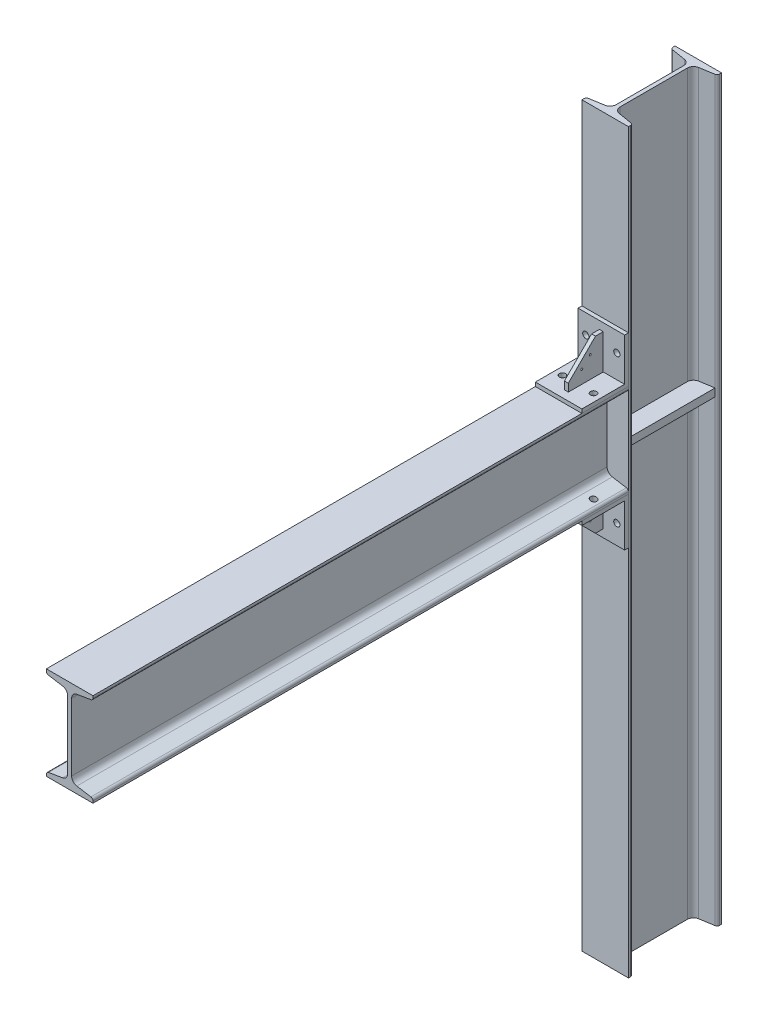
ISO-10303-21;
HEADER;
FILE_DESCRIPTION(('STEP AP214'),'2;1');
FILE_NAME('part.step','',(''),(''),'','','');
FILE_SCHEMA(('AUTOMOTIVE_DESIGN { 1 0 10303 214 1 1 1 1 }'));
ENDSEC;
DATA;
#1=APPLICATION_CONTEXT('core data for automotive mechanical design processes');
#2=APPLICATION_PROTOCOL_DEFINITION('international standard','automotive_design',2000,#1);
#3=PRODUCT_CONTEXT('',#1,'mechanical');
#4=PRODUCT('Part','Part','',(#3));
#5=PRODUCT_RELATED_PRODUCT_CATEGORY('part','',(#4));
#6=PRODUCT_DEFINITION_FORMATION('','',#4);
#7=PRODUCT_DEFINITION_CONTEXT('part definition',#1,'design');
#8=PRODUCT_DEFINITION('design','',#6,#7);
#9=PRODUCT_DEFINITION_SHAPE('','',#8);
#10=(LENGTH_UNIT() NAMED_UNIT(*) SI_UNIT(.MILLI.,.METRE.));
#11=(NAMED_UNIT(*) PLANE_ANGLE_UNIT() SI_UNIT($,.RADIAN.));
#12=(NAMED_UNIT(*) SI_UNIT($,.STERADIAN.) SOLID_ANGLE_UNIT());
#13=UNCERTAINTY_MEASURE_WITH_UNIT(LENGTH_MEASURE(1.E-05),#10,'distance_accuracy_value','');
#14=(GEOMETRIC_REPRESENTATION_CONTEXT(3) GLOBAL_UNCERTAINTY_ASSIGNED_CONTEXT((#13)) GLOBAL_UNIT_ASSIGNED_CONTEXT((#10,
#11,#12)) REPRESENTATION_CONTEXT('',''));
#15=CARTESIAN_POINT('',(0.,0.,0.));
#16=DIRECTION('',(0.,0.,1.));
#17=DIRECTION('',(1.,0.,0.));
#18=AXIS2_PLACEMENT_3D('',#15,#16,#17);
#19=CARTESIAN_POINT('',(27.3470038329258,590.,54.2496355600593));
#20=DIRECTION('',(0.164410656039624,0.,-0.986391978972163));
#21=DIRECTION('',(0.986391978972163,0.,0.164410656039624));
#22=AXIS2_PLACEMENT_3D('',#19,#20,#21);
#23=PLANE('',#22);
#24=DIRECTION('',(-0.986391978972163,0.,-0.164410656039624));
#25=VECTOR('',#24,1.);
#26=CARTESIAN_POINT('',(27.3470038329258,600.,54.2496355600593));
#27=LINE('',#26,#25);
#28=CARTESIAN_POINT('',(27.3470038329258,600.,54.2496355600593));
#29=VERTEX_POINT('',#28);
#30=CARTESIAN_POINT('',(9.184714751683,600.,51.2223665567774));
#31=VERTEX_POINT('',#30);
#32=EDGE_CURVE('E254',#29,#31,#27,.T.);
#33=ORIENTED_EDGE('',*,*,#32,.T.);
#34=DIRECTION('',(0.,1.,0.));
#35=VECTOR('',#34,1.);
#36=CARTESIAN_POINT('',(9.184714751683,590.,51.2223665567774));
#37=LINE('',#36,#35);
#38=CARTESIAN_POINT('',(9.184714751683,590.,51.2223665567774));
#39=VERTEX_POINT('',#38);
#40=EDGE_CURVE('E13',#39,#31,#37,.T.);
#41=ORIENTED_EDGE('',*,*,#40,.F.);
#42=DIRECTION('',(-0.986391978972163,0.,-0.164410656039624));
#43=VECTOR('',#42,1.);
#44=CARTESIAN_POINT('',(27.3470038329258,590.,54.2496355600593));
#45=LINE('',#44,#43);
#46=CARTESIAN_POINT('',(27.3470038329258,590.,54.2496355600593));
#47=VERTEX_POINT('',#46);
#48=EDGE_CURVE('E264',#47,#39,#45,.T.);
#49=ORIENTED_EDGE('',*,*,#48,.F.);
#50=DIRECTION('',(0.,1.,0.));
#51=VECTOR('',#50,1.);
#52=CARTESIAN_POINT('',(27.3470038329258,590.,54.2496355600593));
#53=LINE('',#52,#51);
#54=EDGE_CURVE('E250',#47,#29,#53,.T.);
#55=ORIENTED_EDGE('',*,*,#54,.T.);
#56=EDGE_LOOP('',(#33,#41,#49,#55));
#57=FACE_BOUND('',#56,.T.);
#58=ADVANCED_FACE('F170',(#57),#23,.F.);
#59=CARTESIAN_POINT('',(10.5,590.,43.3312307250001));
#60=DIRECTION('',(0.,1.,0.));
#61=DIRECTION('',(-1.,0.,0.));
#62=AXIS2_PLACEMENT_3D('',#59,#60,#61);
#63=CYLINDRICAL_SURFACE('',#62,8.);
#64=CARTESIAN_POINT('',(10.5,600.,43.3312307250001));
#65=DIRECTION('',(0.,-1.,0.));
#66=DIRECTION('',(1.,0.,0.));
#67=AXIS2_PLACEMENT_3D('',#64,#65,#66);
#68=CIRCLE('',#67,8.);
#69=CARTESIAN_POINT('',(2.49999999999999,600.,43.3312307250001));
#70=VERTEX_POINT('',#69);
#71=EDGE_CURVE('E257',#31,#70,#68,.T.);
#72=ORIENTED_EDGE('',*,*,#71,.T.);
#73=DIRECTION('',(0.,1.,0.));
#74=VECTOR('',#73,1.);
#75=CARTESIAN_POINT('',(2.49999999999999,590.,43.3312307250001));
#76=LINE('',#75,#74);
#77=CARTESIAN_POINT('',(2.49999999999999,590.,43.3312307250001));
#78=VERTEX_POINT('',#77);
#79=EDGE_CURVE('E178',#78,#70,#76,.T.);
#80=ORIENTED_EDGE('',*,*,#79,.F.);
#81=CARTESIAN_POINT('',(10.5,590.,43.3312307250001));
#82=DIRECTION('',(0.,-1.,0.));
#83=DIRECTION('',(1.,0.,0.));
#84=AXIS2_PLACEMENT_3D('',#81,#82,#83);
#85=CIRCLE('',#84,8.);
#86=EDGE_CURVE('E223',#39,#78,#85,.T.);
#87=ORIENTED_EDGE('',*,*,#86,.F.);
#88=ORIENTED_EDGE('',*,*,#40,.T.);
#89=EDGE_LOOP('',(#72,#80,#87,#88));
#90=FACE_BOUND('',#89,.T.);
#91=ADVANCED_FACE('F288',(#90),#63,.T.);
#92=CARTESIAN_POINT('',(2.49999999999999,590.,43.3312307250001));
#93=DIRECTION('',(1.,0.,0.));
#94=DIRECTION('',(0.,0.,1.));
#95=AXIS2_PLACEMENT_3D('',#92,#93,#94);
#96=PLANE('',#95);
#97=DIRECTION('',(0.,0.,-1.));
#98=VECTOR('',#97,1.);
#99=CARTESIAN_POINT('',(2.49999999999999,600.,43.3312307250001));
#100=LINE('',#99,#98);
#101=CARTESIAN_POINT('',(2.5,600.,-43.3312307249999));
#102=VERTEX_POINT('',#101);
#103=EDGE_CURVE('E259',#70,#102,#100,.T.);
#104=ORIENTED_EDGE('',*,*,#103,.T.);
#105=DIRECTION('',(0.,1.,0.));
#106=VECTOR('',#105,1.);
#107=CARTESIAN_POINT('',(2.5,590.,-43.3312307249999));
#108=LINE('',#107,#106);
#109=CARTESIAN_POINT('',(2.5,590.,-43.3312307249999));
#110=VERTEX_POINT('',#109);
#111=EDGE_CURVE('E245',#110,#102,#108,.T.);
#112=ORIENTED_EDGE('',*,*,#111,.F.);
#113=DIRECTION('',(0.,0.,-1.));
#114=VECTOR('',#113,1.);
#115=CARTESIAN_POINT('',(2.49999999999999,590.,43.3312307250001));
#116=LINE('',#115,#114);
#117=EDGE_CURVE('E236',#78,#110,#116,.T.);
#118=ORIENTED_EDGE('',*,*,#117,.F.);
#119=ORIENTED_EDGE('',*,*,#79,.T.);
#120=EDGE_LOOP('',(#104,#112,#118,#119));
#121=FACE_BOUND('',#120,.T.);
#122=ADVANCED_FACE('F270',(#121),#96,.F.);
#123=CARTESIAN_POINT('',(10.5,590.,-43.3312307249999));
#124=DIRECTION('',(0.,1.,0.));
#125=DIRECTION('',(-1.,0.,0.));
#126=AXIS2_PLACEMENT_3D('',#123,#124,#125);
#127=CYLINDRICAL_SURFACE('',#126,8.);
#128=CARTESIAN_POINT('',(10.5,600.,-43.3312307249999));
#129=DIRECTION('',(0.,-1.,0.));
#130=DIRECTION('',(1.,0.,0.));
#131=AXIS2_PLACEMENT_3D('',#128,#129,#130);
#132=CIRCLE('',#131,8.);
#133=CARTESIAN_POINT('',(9.18471475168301,600.,-51.2223665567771));
#134=VERTEX_POINT('',#133);
#135=EDGE_CURVE('E244',#102,#134,#132,.T.);
#136=ORIENTED_EDGE('',*,*,#135,.T.);
#137=DIRECTION('',(0.,1.,0.));
#138=VECTOR('',#137,1.);
#139=CARTESIAN_POINT('',(9.18471475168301,590.,-51.2223665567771));
#140=LINE('',#139,#138);
#141=CARTESIAN_POINT('',(9.18471475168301,590.,-51.2223665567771));
#142=VERTEX_POINT('',#141);
#143=EDGE_CURVE('E241',#142,#134,#140,.T.);
#144=ORIENTED_EDGE('',*,*,#143,.F.);
#145=CARTESIAN_POINT('',(10.5,590.,-43.3312307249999));
#146=DIRECTION('',(0.,-1.,0.));
#147=DIRECTION('',(1.,0.,0.));
#148=AXIS2_PLACEMENT_3D('',#145,#146,#147);
#149=CIRCLE('',#148,8.);
#150=EDGE_CURVE('E230',#110,#142,#149,.T.);
#151=ORIENTED_EDGE('',*,*,#150,.F.);
#152=ORIENTED_EDGE('',*,*,#111,.T.);
#153=EDGE_LOOP('',(#136,#144,#151,#152));
#154=FACE_BOUND('',#153,.T.);
#155=ADVANCED_FACE('F242',(#154),#127,.T.);
#156=CARTESIAN_POINT('',(9.18471475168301,590.,-51.2223665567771));
#157=DIRECTION('',(0.164410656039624,0.,0.986391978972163));
#158=DIRECTION('',(-0.986391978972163,0.,0.164410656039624));
#159=AXIS2_PLACEMENT_3D('',#156,#157,#158);
#160=PLANE('',#159);
#161=DIRECTION('',(0.986391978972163,0.,-0.164410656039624));
#162=VECTOR('',#161,1.);
#163=CARTESIAN_POINT('',(9.18471475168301,600.,-51.2223665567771));
#164=LINE('',#163,#162);
#165=CARTESIAN_POINT('',(27.3470038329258,600.,-54.2496355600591));
#166=VERTEX_POINT('',#165);
#167=EDGE_CURVE('E209',#134,#166,#164,.T.);
#168=ORIENTED_EDGE('',*,*,#167,.T.);
#169=DIRECTION('',(0.,1.,0.));
#170=VECTOR('',#169,1.);
#171=CARTESIAN_POINT('',(27.3470038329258,590.,-54.2496355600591));
#172=LINE('',#171,#170);
#173=CARTESIAN_POINT('',(27.3470038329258,590.,-54.2496355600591));
#174=VERTEX_POINT('',#173);
#175=EDGE_CURVE('E246',#174,#166,#172,.T.);
#176=ORIENTED_EDGE('',*,*,#175,.F.);
#177=DIRECTION('',(0.986391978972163,0.,-0.164410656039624));
#178=VECTOR('',#177,1.);
#179=CARTESIAN_POINT('',(9.18471475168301,590.,-51.2223665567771));
#180=LINE('',#179,#178);
#181=EDGE_CURVE('E234',#142,#174,#180,.T.);
#182=ORIENTED_EDGE('',*,*,#181,.F.);
#183=ORIENTED_EDGE('',*,*,#143,.T.);
#184=EDGE_LOOP('',(#168,#176,#182,#183));
#185=FACE_BOUND('',#184,.T.);
#186=ADVANCED_FACE('F248',(#185),#160,.F.);
#187=CARTESIAN_POINT('',(27.3470038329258,590.,54.2496355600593));
#188=DIRECTION('',(-1.,0.,0.));
#189=DIRECTION('',(0.,0.,-1.));
#190=AXIS2_PLACEMENT_3D('',#187,#188,#189);
#191=PLANE('',#190);
#192=DIRECTION('',(0.,0.,1.));
#193=VECTOR('',#192,1.);
#194=CARTESIAN_POINT('',(27.3470038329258,600.,54.2496355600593));
#195=LINE('',#194,#193);
#196=EDGE_CURVE('E215',#166,#29,#195,.T.);
#197=ORIENTED_EDGE('',*,*,#196,.T.);
#198=ORIENTED_EDGE('',*,*,#54,.F.);
#199=DIRECTION('',(0.,0.,1.));
#200=VECTOR('',#199,1.);
#201=CARTESIAN_POINT('',(27.3470038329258,590.,54.2496355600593));
#202=LINE('',#201,#200);
#203=EDGE_CURVE('E186',#174,#47,#202,.T.);
#204=ORIENTED_EDGE('',*,*,#203,.F.);
#205=ORIENTED_EDGE('',*,*,#175,.T.);
#206=EDGE_LOOP('',(#197,#198,#204,#205));
#207=FACE_BOUND('',#206,.T.);
#208=ADVANCED_FACE('F277',(#207),#191,.F.);
#209=CARTESIAN_POINT('',(10.5,590.,43.3312307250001));
#210=DIRECTION('',(0.,-1.,0.));
#211=DIRECTION('',(1.,0.,0.));
#212=AXIS2_PLACEMENT_3D('',#209,#210,#211);
#213=PLANE('',#212);
#214=ORIENTED_EDGE('',*,*,#48,.T.);
#215=ORIENTED_EDGE('',*,*,#86,.T.);
#216=ORIENTED_EDGE('',*,*,#117,.T.);
#217=ORIENTED_EDGE('',*,*,#150,.T.);
#218=ORIENTED_EDGE('',*,*,#181,.T.);
#219=ORIENTED_EDGE('',*,*,#203,.T.);
#220=EDGE_LOOP('',(#214,#215,#216,#217,#218,#219));
#221=FACE_BOUND('',#220,.T.);
#222=ADVANCED_FACE('F232',(#221),#213,.T.);
#223=CARTESIAN_POINT('',(10.5,600.,43.3312307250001));
#224=DIRECTION('',(0.,-1.,0.));
#225=DIRECTION('',(1.,0.,0.));
#226=AXIS2_PLACEMENT_3D('',#223,#224,#225);
#227=PLANE('',#226);
#228=ORIENTED_EDGE('',*,*,#32,.F.);
#229=ORIENTED_EDGE('',*,*,#196,.F.);
#230=ORIENTED_EDGE('',*,*,#167,.F.);
#231=ORIENTED_EDGE('',*,*,#135,.F.);
#232=ORIENTED_EDGE('',*,*,#103,.F.);
#233=ORIENTED_EDGE('',*,*,#71,.F.);
#234=EDGE_LOOP('',(#228,#229,#230,#231,#232,#233));
#235=FACE_BOUND('',#234,.T.);
#236=ADVANCED_FACE('F273',(#235),#227,.F.);
#237=CLOSED_SHELL('',(#58,#91,#122,#155,#186,#208,#222,#236));
#238=MANIFOLD_SOLID_BREP('B2',#237);
#239=CARTESIAN_POINT('',(-27.3470038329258,590.,-54.2496355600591));
#240=DIRECTION('',(-0.164410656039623,0.,0.986391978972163));
#241=DIRECTION('',(-0.986391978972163,0.,-0.164410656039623));
#242=AXIS2_PLACEMENT_3D('',#239,#240,#241);
#243=PLANE('',#242);
#244=DIRECTION('',(0.986391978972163,0.,0.164410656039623));
#245=VECTOR('',#244,1.);
#246=CARTESIAN_POINT('',(-27.3470038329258,600.,-54.2496355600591));
#247=LINE('',#246,#245);
#248=CARTESIAN_POINT('',(-27.3470038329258,600.,-54.2496355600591));
#249=VERTEX_POINT('',#248);
#250=CARTESIAN_POINT('',(-9.18471475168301,600.,-51.2223665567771));
#251=VERTEX_POINT('',#250);
#252=EDGE_CURVE('E440',#249,#251,#247,.T.);
#253=ORIENTED_EDGE('',*,*,#252,.T.);
#254=DIRECTION('',(0.,1.,0.));
#255=VECTOR('',#254,1.);
#256=CARTESIAN_POINT('',(-9.18471475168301,590.,-51.2223665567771));
#257=LINE('',#256,#255);
#258=CARTESIAN_POINT('',(-9.18471475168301,590.,-51.2223665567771));
#259=VERTEX_POINT('',#258);
#260=EDGE_CURVE('E168',#259,#251,#257,.T.);
#261=ORIENTED_EDGE('',*,*,#260,.F.);
#262=DIRECTION('',(0.986391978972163,0.,0.164410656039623));
#263=VECTOR('',#262,1.);
#264=CARTESIAN_POINT('',(-27.3470038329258,590.,-54.2496355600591));
#265=LINE('',#264,#263);
#266=CARTESIAN_POINT('',(-27.3470038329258,590.,-54.2496355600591));
#267=VERTEX_POINT('',#266);
#268=EDGE_CURVE('E450',#267,#259,#265,.T.);
#269=ORIENTED_EDGE('',*,*,#268,.F.);
#270=DIRECTION('',(0.,1.,0.));
#271=VECTOR('',#270,1.);
#272=CARTESIAN_POINT('',(-27.3470038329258,590.,-54.2496355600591));
#273=LINE('',#272,#271);
#274=EDGE_CURVE('E436',#267,#249,#273,.T.);
#275=ORIENTED_EDGE('',*,*,#274,.T.);
#276=EDGE_LOOP('',(#253,#261,#269,#275));
#277=FACE_BOUND('',#276,.T.);
#278=ADVANCED_FACE('F356',(#277),#243,.F.);
#279=CARTESIAN_POINT('',(-10.5,590.,-43.3312307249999));
#280=DIRECTION('',(0.,1.,0.));
#281=DIRECTION('',(1.,0.,0.));
#282=AXIS2_PLACEMENT_3D('',#279,#280,#281);
#283=CYLINDRICAL_SURFACE('',#282,8.);
#284=CARTESIAN_POINT('',(-10.5,600.,-43.3312307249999));
#285=DIRECTION('',(0.,-1.,0.));
#286=DIRECTION('',(-1.,0.,0.));
#287=AXIS2_PLACEMENT_3D('',#284,#285,#286);
#288=CIRCLE('',#287,8.);
#289=CARTESIAN_POINT('',(-2.5,600.,-43.3312307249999));
#290=VERTEX_POINT('',#289);
#291=EDGE_CURVE('E443',#251,#290,#288,.T.);
#292=ORIENTED_EDGE('',*,*,#291,.T.);
#293=DIRECTION('',(0.,1.,0.));
#294=VECTOR('',#293,1.);
#295=CARTESIAN_POINT('',(-2.5,590.,-43.3312307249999));
#296=LINE('',#295,#294);
#297=CARTESIAN_POINT('',(-2.5,590.,-43.3312307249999));
#298=VERTEX_POINT('',#297);
#299=EDGE_CURVE('E364',#298,#290,#296,.T.);
#300=ORIENTED_EDGE('',*,*,#299,.F.);
#301=CARTESIAN_POINT('',(-10.5,590.,-43.3312307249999));
#302=DIRECTION('',(0.,-1.,0.));
#303=DIRECTION('',(-1.,0.,0.));
#304=AXIS2_PLACEMENT_3D('',#301,#302,#303);
#305=CIRCLE('',#304,8.);
#306=EDGE_CURVE('E409',#259,#298,#305,.T.);
#307=ORIENTED_EDGE('',*,*,#306,.F.);
#308=ORIENTED_EDGE('',*,*,#260,.T.);
#309=EDGE_LOOP('',(#292,#300,#307,#308));
#310=FACE_BOUND('',#309,.T.);
#311=ADVANCED_FACE('F474',(#310),#283,.T.);
#312=CARTESIAN_POINT('',(-2.5,590.,-43.3312307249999));
#313=DIRECTION('',(-1.,0.,0.));
#314=DIRECTION('',(0.,0.,-1.));
#315=AXIS2_PLACEMENT_3D('',#312,#313,#314);
#316=PLANE('',#315);
#317=DIRECTION('',(0.,0.,1.));
#318=VECTOR('',#317,1.);
#319=CARTESIAN_POINT('',(-2.5,600.,-43.3312307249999));
#320=LINE('',#319,#318);
#321=CARTESIAN_POINT('',(-2.5,600.,43.3312307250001));
#322=VERTEX_POINT('',#321);
#323=EDGE_CURVE('E445',#290,#322,#320,.T.);
#324=ORIENTED_EDGE('',*,*,#323,.T.);
#325=DIRECTION('',(0.,1.,0.));
#326=VECTOR('',#325,1.);
#327=CARTESIAN_POINT('',(-2.5,590.,43.3312307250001));
#328=LINE('',#327,#326);
#329=CARTESIAN_POINT('',(-2.5,590.,43.3312307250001));
#330=VERTEX_POINT('',#329);
#331=EDGE_CURVE('E431',#330,#322,#328,.T.);
#332=ORIENTED_EDGE('',*,*,#331,.F.);
#333=DIRECTION('',(0.,0.,1.));
#334=VECTOR('',#333,1.);
#335=CARTESIAN_POINT('',(-2.5,590.,-43.3312307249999));
#336=LINE('',#335,#334);
#337=EDGE_CURVE('E422',#298,#330,#336,.T.);
#338=ORIENTED_EDGE('',*,*,#337,.F.);
#339=ORIENTED_EDGE('',*,*,#299,.T.);
#340=EDGE_LOOP('',(#324,#332,#338,#339));
#341=FACE_BOUND('',#340,.T.);
#342=ADVANCED_FACE('F456',(#341),#316,.F.);
#343=CARTESIAN_POINT('',(-10.5,590.,43.3312307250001));
#344=DIRECTION('',(0.,1.,0.));
#345=DIRECTION('',(1.,0.,0.));
#346=AXIS2_PLACEMENT_3D('',#343,#344,#345);
#347=CYLINDRICAL_SURFACE('',#346,8.);
#348=CARTESIAN_POINT('',(-10.5,600.,43.3312307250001));
#349=DIRECTION('',(0.,-1.,0.));
#350=DIRECTION('',(-1.,0.,0.));
#351=AXIS2_PLACEMENT_3D('',#348,#349,#350);
#352=CIRCLE('',#351,8.);
#353=CARTESIAN_POINT('',(-9.18471475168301,600.,51.2223665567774));
#354=VERTEX_POINT('',#353);
#355=EDGE_CURVE('E430',#322,#354,#352,.T.);
#356=ORIENTED_EDGE('',*,*,#355,.T.);
#357=DIRECTION('',(0.,1.,0.));
#358=VECTOR('',#357,1.);
#359=CARTESIAN_POINT('',(-9.18471475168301,590.,51.2223665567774));
#360=LINE('',#359,#358);
#361=CARTESIAN_POINT('',(-9.18471475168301,590.,51.2223665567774));
#362=VERTEX_POINT('',#361);
#363=EDGE_CURVE('E427',#362,#354,#360,.T.);
#364=ORIENTED_EDGE('',*,*,#363,.F.);
#365=CARTESIAN_POINT('',(-10.5,590.,43.3312307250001));
#366=DIRECTION('',(0.,-1.,0.));
#367=DIRECTION('',(-1.,0.,0.));
#368=AXIS2_PLACEMENT_3D('',#365,#366,#367);
#369=CIRCLE('',#368,8.);
#370=EDGE_CURVE('E416',#330,#362,#369,.T.);
#371=ORIENTED_EDGE('',*,*,#370,.F.);
#372=ORIENTED_EDGE('',*,*,#331,.T.);
#373=EDGE_LOOP('',(#356,#364,#371,#372));
#374=FACE_BOUND('',#373,.T.);
#375=ADVANCED_FACE('F428',(#374),#347,.T.);
#376=CARTESIAN_POINT('',(-9.18471475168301,590.,51.2223665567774));
#377=DIRECTION('',(-0.164410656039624,0.,-0.986391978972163));
#378=DIRECTION('',(0.986391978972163,0.,-0.164410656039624));
#379=AXIS2_PLACEMENT_3D('',#376,#377,#378);
#380=PLANE('',#379);
#381=DIRECTION('',(-0.986391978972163,0.,0.164410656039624));
#382=VECTOR('',#381,1.);
#383=CARTESIAN_POINT('',(-9.18471475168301,600.,51.2223665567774));
#384=LINE('',#383,#382);
#385=CARTESIAN_POINT('',(-27.3470038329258,600.,54.2496355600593));
#386=VERTEX_POINT('',#385);
#387=EDGE_CURVE('E395',#354,#386,#384,.T.);
#388=ORIENTED_EDGE('',*,*,#387,.T.);
#389=DIRECTION('',(0.,1.,0.));
#390=VECTOR('',#389,1.);
#391=CARTESIAN_POINT('',(-27.3470038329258,590.,54.2496355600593));
#392=LINE('',#391,#390);
#393=CARTESIAN_POINT('',(-27.3470038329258,590.,54.2496355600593));
#394=VERTEX_POINT('',#393);
#395=EDGE_CURVE('E432',#394,#386,#392,.T.);
#396=ORIENTED_EDGE('',*,*,#395,.F.);
#397=DIRECTION('',(-0.986391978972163,0.,0.164410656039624));
#398=VECTOR('',#397,1.);
#399=CARTESIAN_POINT('',(-9.18471475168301,590.,51.2223665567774));
#400=LINE('',#399,#398);
#401=EDGE_CURVE('E420',#362,#394,#400,.T.);
#402=ORIENTED_EDGE('',*,*,#401,.F.);
#403=ORIENTED_EDGE('',*,*,#363,.T.);
#404=EDGE_LOOP('',(#388,#396,#402,#403));
#405=FACE_BOUND('',#404,.T.);
#406=ADVANCED_FACE('F434',(#405),#380,.F.);
#407=CARTESIAN_POINT('',(-27.3470038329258,590.,-54.2496355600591));
#408=DIRECTION('',(1.,0.,0.));
#409=DIRECTION('',(0.,0.,1.));
#410=AXIS2_PLACEMENT_3D('',#407,#408,#409);
#411=PLANE('',#410);
#412=DIRECTION('',(0.,0.,-1.));
#413=VECTOR('',#412,1.);
#414=CARTESIAN_POINT('',(-27.3470038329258,600.,-54.2496355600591));
#415=LINE('',#414,#413);
#416=EDGE_CURVE('E401',#386,#249,#415,.T.);
#417=ORIENTED_EDGE('',*,*,#416,.T.);
#418=ORIENTED_EDGE('',*,*,#274,.F.);
#419=DIRECTION('',(0.,0.,-1.));
#420=VECTOR('',#419,1.);
#421=CARTESIAN_POINT('',(-27.3470038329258,590.,-54.2496355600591));
#422=LINE('',#421,#420);
#423=EDGE_CURVE('E372',#394,#267,#422,.T.);
#424=ORIENTED_EDGE('',*,*,#423,.F.);
#425=ORIENTED_EDGE('',*,*,#395,.T.);
#426=EDGE_LOOP('',(#417,#418,#424,#425));
#427=FACE_BOUND('',#426,.T.);
#428=ADVANCED_FACE('F463',(#427),#411,.F.);
#429=CARTESIAN_POINT('',(-10.5,590.,-43.3312307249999));
#430=DIRECTION('',(0.,-1.,0.));
#431=DIRECTION('',(-1.,0.,0.));
#432=AXIS2_PLACEMENT_3D('',#429,#430,#431);
#433=PLANE('',#432);
#434=ORIENTED_EDGE('',*,*,#268,.T.);
#435=ORIENTED_EDGE('',*,*,#306,.T.);
#436=ORIENTED_EDGE('',*,*,#337,.T.);
#437=ORIENTED_EDGE('',*,*,#370,.T.);
#438=ORIENTED_EDGE('',*,*,#401,.T.);
#439=ORIENTED_EDGE('',*,*,#423,.T.);
#440=EDGE_LOOP('',(#434,#435,#436,#437,#438,#439));
#441=FACE_BOUND('',#440,.T.);
#442=ADVANCED_FACE('F418',(#441),#433,.T.);
#443=CARTESIAN_POINT('',(-10.5,600.,-43.3312307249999));
#444=DIRECTION('',(0.,-1.,0.));
#445=DIRECTION('',(-1.,0.,0.));
#446=AXIS2_PLACEMENT_3D('',#443,#444,#445);
#447=PLANE('',#446);
#448=ORIENTED_EDGE('',*,*,#252,.F.);
#449=ORIENTED_EDGE('',*,*,#416,.F.);
#450=ORIENTED_EDGE('',*,*,#387,.F.);
#451=ORIENTED_EDGE('',*,*,#355,.F.);
#452=ORIENTED_EDGE('',*,*,#323,.F.);
#453=ORIENTED_EDGE('',*,*,#291,.F.);
#454=EDGE_LOOP('',(#448,#449,#450,#451,#452,#453));
#455=FACE_BOUND('',#454,.T.);
#456=ADVANCED_FACE('F459',(#455),#447,.F.);
#457=CLOSED_SHELL('',(#278,#311,#342,#375,#406,#428,#442,#456));
#458=MANIFOLD_SOLID_BREP('B7',#457);
#459=CARTESIAN_POINT('',(-2.49999999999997,525.,110.));
#460=DIRECTION('',(0.,0.,-1.));
#461=DIRECTION('',(0.,-1.,0.));
#462=AXIS2_PLACEMENT_3D('',#459,#460,#461);
#463=PLANE('',#462);
#464=DIRECTION('',(0.,1.,0.));
#465=VECTOR('',#464,1.);
#466=CARTESIAN_POINT('',(2.50000000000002,525.,110.));
#467=LINE('',#466,#465);
#468=CARTESIAN_POINT('',(2.50000000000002,525.,110.));
#469=VERTEX_POINT('',#468);
#470=CARTESIAN_POINT('',(2.50000000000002,535.,110.));
#471=VERTEX_POINT('',#470);
#472=EDGE_CURVE('E616',#469,#471,#467,.T.);
#473=ORIENTED_EDGE('',*,*,#472,.T.);
#474=DIRECTION('',(1.,0.,0.));
#475=VECTOR('',#474,1.);
#476=CARTESIAN_POINT('',(-2.49999999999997,535.,110.));
#477=LINE('',#476,#475);
#478=CARTESIAN_POINT('',(-2.49999999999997,535.,110.));
#479=VERTEX_POINT('',#478);
#480=EDGE_CURVE('E354',#479,#471,#477,.T.);
#481=ORIENTED_EDGE('',*,*,#480,.F.);
#482=DIRECTION('',(0.,1.,0.));
#483=VECTOR('',#482,1.);
#484=CARTESIAN_POINT('',(-2.49999999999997,525.,110.));
#485=LINE('',#484,#483);
#486=CARTESIAN_POINT('',(-2.49999999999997,525.,110.));
#487=VERTEX_POINT('',#486);
#488=EDGE_CURVE('E625',#487,#479,#485,.T.);
#489=ORIENTED_EDGE('',*,*,#488,.F.);
#490=DIRECTION('',(1.,0.,0.));
#491=VECTOR('',#490,1.);
#492=CARTESIAN_POINT('',(-2.49999999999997,525.,110.));
#493=LINE('',#492,#491);
#494=EDGE_CURVE('E612',#487,#469,#493,.T.);
#495=ORIENTED_EDGE('',*,*,#494,.T.);
#496=EDGE_LOOP('',(#473,#481,#489,#495));
#497=FACE_BOUND('',#496,.T.);
#498=ADVANCED_FACE('F542',(#497),#463,.F.);
#499=CARTESIAN_POINT('',(-2.49999999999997,535.,110.));
#500=DIRECTION('',(0.,-1.,0.));
#501=DIRECTION('',(0.,0.,1.));
#502=AXIS2_PLACEMENT_3D('',#499,#500,#501);
#503=PLANE('',#502);
#504=DIRECTION('',(0.,0.,-1.));
#505=VECTOR('',#504,1.);
#506=CARTESIAN_POINT('',(2.50000000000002,535.,110.));
#507=LINE('',#506,#505);
#508=CARTESIAN_POINT('',(2.5,535.,65.0000000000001));
#509=VERTEX_POINT('',#508);
#510=EDGE_CURVE('E619',#471,#509,#507,.T.);
#511=ORIENTED_EDGE('',*,*,#510,.T.);
#512=DIRECTION('',(1.,0.,0.));
#513=VECTOR('',#512,1.);
#514=CARTESIAN_POINT('',(-2.49999999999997,535.,65.0000000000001));
#515=LINE('',#514,#513);
#516=CARTESIAN_POINT('',(-2.49999999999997,535.,65.0000000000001));
#517=VERTEX_POINT('',#516);
#518=EDGE_CURVE('E550',#517,#509,#515,.T.);
#519=ORIENTED_EDGE('',*,*,#518,.F.);
#520=DIRECTION('',(0.,0.,-1.));
#521=VECTOR('',#520,1.);
#522=CARTESIAN_POINT('',(-2.49999999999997,535.,110.));
#523=LINE('',#522,#521);
#524=EDGE_CURVE('E592',#479,#517,#523,.T.);
#525=ORIENTED_EDGE('',*,*,#524,.F.);
#526=ORIENTED_EDGE('',*,*,#480,.T.);
#527=EDGE_LOOP('',(#511,#519,#525,#526));
#528=FACE_BOUND('',#527,.T.);
#529=ADVANCED_FACE('F645',(#528),#503,.F.);
#530=CARTESIAN_POINT('',(-2.49999999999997,535.,65.0000000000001));
#531=DIRECTION('',(0.,0.,1.));
#532=DIRECTION('',(0.,1.,0.));
#533=AXIS2_PLACEMENT_3D('',#530,#531,#532);
#534=PLANE('',#533);
#535=DIRECTION('',(0.,-1.,0.));
#536=VECTOR('',#535,1.);
#537=CARTESIAN_POINT('',(2.5,535.,65.0000000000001));
#538=LINE('',#537,#536);
#539=CARTESIAN_POINT('',(2.5,490.,65.0000000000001));
#540=VERTEX_POINT('',#539);
#541=EDGE_CURVE('E607',#509,#540,#538,.T.);
#542=ORIENTED_EDGE('',*,*,#541,.T.);
#543=DIRECTION('',(1.,0.,0.));
#544=VECTOR('',#543,1.);
#545=CARTESIAN_POINT('',(-2.49999999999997,490.,65.0000000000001));
#546=LINE('',#545,#544);
#547=CARTESIAN_POINT('',(-2.49999999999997,490.,65.0000000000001));
#548=VERTEX_POINT('',#547);
#549=EDGE_CURVE('E604',#548,#540,#546,.T.);
#550=ORIENTED_EDGE('',*,*,#549,.F.);
#551=DIRECTION('',(0.,-1.,0.));
#552=VECTOR('',#551,1.);
#553=CARTESIAN_POINT('',(-2.49999999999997,535.,65.0000000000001));
#554=LINE('',#553,#552);
#555=EDGE_CURVE('E596',#517,#548,#554,.T.);
#556=ORIENTED_EDGE('',*,*,#555,.F.);
#557=ORIENTED_EDGE('',*,*,#518,.T.);
#558=EDGE_LOOP('',(#542,#550,#556,#557));
#559=FACE_BOUND('',#558,.T.);
#560=ADVANCED_FACE('F605',(#559),#534,.F.);
#561=CARTESIAN_POINT('',(-2.49999999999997,490.,65.0000000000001));
#562=DIRECTION('',(0.,1.,0.));
#563=DIRECTION('',(0.,0.,-1.));
#564=AXIS2_PLACEMENT_3D('',#561,#562,#563);
#565=PLANE('',#564);
#566=DIRECTION('',(0.,0.,1.));
#567=VECTOR('',#566,1.);
#568=CARTESIAN_POINT('',(2.5,490.,65.0000000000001));
#569=LINE('',#568,#567);
#570=CARTESIAN_POINT('',(2.50000000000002,490.,75.0000000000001));
#571=VERTEX_POINT('',#570);
#572=EDGE_CURVE('E578',#540,#571,#569,.T.);
#573=ORIENTED_EDGE('',*,*,#572,.T.);
#574=DIRECTION('',(1.,0.,0.));
#575=VECTOR('',#574,1.);
#576=CARTESIAN_POINT('',(-2.49999999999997,490.,75.0000000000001));
#577=LINE('',#576,#575);
#578=CARTESIAN_POINT('',(-2.49999999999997,490.,75.0000000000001));
#579=VERTEX_POINT('',#578);
#580=EDGE_CURVE('E608',#579,#571,#577,.T.);
#581=ORIENTED_EDGE('',*,*,#580,.F.);
#582=DIRECTION('',(0.,0.,1.));
#583=VECTOR('',#582,1.);
#584=CARTESIAN_POINT('',(-2.49999999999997,490.,65.0000000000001));
#585=LINE('',#584,#583);
#586=EDGE_CURVE('E600',#548,#579,#585,.T.);
#587=ORIENTED_EDGE('',*,*,#586,.F.);
#588=ORIENTED_EDGE('',*,*,#549,.T.);
#589=EDGE_LOOP('',(#573,#581,#587,#588));
#590=FACE_BOUND('',#589,.T.);
#591=ADVANCED_FACE('F610',(#590),#565,.F.);
#592=CARTESIAN_POINT('',(-2.49999999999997,490.,75.0000000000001));
#593=DIRECTION('',(0.,0.707106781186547,-0.707106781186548));
#594=DIRECTION('',(0.,-0.707106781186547,-0.707106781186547));
#595=AXIS2_PLACEMENT_3D('',#592,#593,#594);
#596=PLANE('',#595);
#597=DIRECTION('',(0.,0.707106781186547,0.707106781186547));
#598=VECTOR('',#597,1.);
#599=CARTESIAN_POINT('',(2.50000000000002,490.,75.0000000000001));
#600=LINE('',#599,#598);
#601=EDGE_CURVE('E584',#571,#469,#600,.T.);
#602=ORIENTED_EDGE('',*,*,#601,.T.);
#603=ORIENTED_EDGE('',*,*,#494,.F.);
#604=DIRECTION('',(0.,0.707106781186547,0.707106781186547));
#605=VECTOR('',#604,1.);
#606=CARTESIAN_POINT('',(-2.49999999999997,490.,75.0000000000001));
#607=LINE('',#606,#605);
#608=EDGE_CURVE('E558',#579,#487,#607,.T.);
#609=ORIENTED_EDGE('',*,*,#608,.F.);
#610=ORIENTED_EDGE('',*,*,#580,.T.);
#611=EDGE_LOOP('',(#602,#603,#609,#610));
#612=FACE_BOUND('',#611,.T.);
#613=ADVANCED_FACE('F633',(#612),#596,.F.);
#614=CARTESIAN_POINT('',(-2.49999999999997,535.,65.0000000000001));
#615=DIRECTION('',(-1.,0.,0.));
#616=DIRECTION('',(0.,-1.,0.));
#617=AXIS2_PLACEMENT_3D('',#614,#615,#616);
#618=PLANE('',#617);
#619=CARTESIAN_POINT('',(-2.49999999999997,518.224262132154,92.6176604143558));
#620=DIRECTION('',(-1.,0.,0.));
#621=DIRECTION('',(0.,-1.,0.));
#622=AXIS2_PLACEMENT_3D('',#619,#620,#621);
#623=CIRCLE('',#622,1.24999999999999);
#624=CARTESIAN_POINT('',(-2.49999999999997,516.974262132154,92.6176604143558));
#625=VERTEX_POINT('',#624);
#626=EDGE_CURVE('E727',#625,#625,#623,.T.);
#627=ORIENTED_EDGE('',*,*,#626,.F.);
#628=EDGE_LOOP('',(#627));
#629=FACE_BOUND('',#628,.T.);
#630=CARTESIAN_POINT('',(-2.49999999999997,507.382339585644,81.7757378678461));
#631=DIRECTION('',(-1.,0.,0.));
#632=DIRECTION('',(0.,-1.,0.));
#633=AXIS2_PLACEMENT_3D('',#630,#631,#632);
#634=CIRCLE('',#633,1.24999999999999);
#635=CARTESIAN_POINT('',(-2.49999999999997,506.132339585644,81.7757378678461));
#636=VERTEX_POINT('',#635);
#637=EDGE_CURVE('E737',#636,#636,#634,.T.);
#638=ORIENTED_EDGE('',*,*,#637,.F.);
#639=EDGE_LOOP('',(#638));
#640=FACE_BOUND('',#639,.T.);
#641=ORIENTED_EDGE('',*,*,#488,.T.);
#642=ORIENTED_EDGE('',*,*,#524,.T.);
#643=ORIENTED_EDGE('',*,*,#555,.T.);
#644=ORIENTED_EDGE('',*,*,#586,.T.);
#645=ORIENTED_EDGE('',*,*,#608,.T.);
#646=EDGE_LOOP('',(#641,#642,#643,#644,#645));
#647=FACE_BOUND('',#646,.T.);
#648=ADVANCED_FACE('F598',(#629,#640,#647),#618,.T.);
#649=CARTESIAN_POINT('',(2.5,535.,65.0000000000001));
#650=DIRECTION('',(-1.,0.,0.));
#651=DIRECTION('',(0.,-1.,0.));
#652=AXIS2_PLACEMENT_3D('',#649,#650,#651);
#653=PLANE('',#652);
#654=CARTESIAN_POINT('',(2.50000000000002,518.224262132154,92.6176604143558));
#655=DIRECTION('',(-1.,0.,0.));
#656=DIRECTION('',(0.,-1.,0.));
#657=AXIS2_PLACEMENT_3D('',#654,#655,#656);
#658=CIRCLE('',#657,1.275);
#659=CARTESIAN_POINT('',(2.50000000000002,516.949262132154,92.6176604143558));
#660=VERTEX_POINT('',#659);
#661=EDGE_CURVE('E728',#660,#660,#658,.T.);
#662=ORIENTED_EDGE('',*,*,#661,.T.);
#663=EDGE_LOOP('',(#662));
#664=FACE_BOUND('',#663,.T.);
#665=CARTESIAN_POINT('',(2.50000000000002,507.382339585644,81.7757378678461));
#666=DIRECTION('',(-1.,0.,0.));
#667=DIRECTION('',(0.,-1.,0.));
#668=AXIS2_PLACEMENT_3D('',#665,#666,#667);
#669=CIRCLE('',#668,1.275);
#670=CARTESIAN_POINT('',(2.50000000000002,506.107339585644,81.7757378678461));
#671=VERTEX_POINT('',#670);
#672=EDGE_CURVE('E730',#671,#671,#669,.T.);
#673=ORIENTED_EDGE('',*,*,#672,.T.);
#674=EDGE_LOOP('',(#673));
#675=FACE_BOUND('',#674,.T.);
#676=ORIENTED_EDGE('',*,*,#472,.F.);
#677=ORIENTED_EDGE('',*,*,#601,.F.);
#678=ORIENTED_EDGE('',*,*,#572,.F.);
#679=ORIENTED_EDGE('',*,*,#541,.F.);
#680=ORIENTED_EDGE('',*,*,#510,.F.);
#681=EDGE_LOOP('',(#676,#677,#678,#679,#680));
#682=FACE_BOUND('',#681,.T.);
#683=ADVANCED_FACE('F629',(#664,#675,#682),#653,.F.);
#684=CARTESIAN_POINT('',(2.47500000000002,507.382339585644,81.7757378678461));
#685=DIRECTION('',(1.,0.,0.));
#686=DIRECTION('',(0.,1.,0.));
#687=AXIS2_PLACEMENT_3D('',#684,#685,#686);
#688=CONICAL_SURFACE('',#687,1.25,0.785398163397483);
#689=ORIENTED_EDGE('',*,*,#672,.F.);
#690=EDGE_LOOP('',(#689));
#691=FACE_BOUND('',#690,.T.);
#692=CARTESIAN_POINT('',(2.47500000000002,507.382339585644,81.7757378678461));
#693=DIRECTION('',(-1.,0.,0.));
#694=DIRECTION('',(0.,-1.,0.));
#695=AXIS2_PLACEMENT_3D('',#692,#693,#694);
#696=CIRCLE('',#695,1.25);
#697=CARTESIAN_POINT('',(2.47500000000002,506.132339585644,81.7757378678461));
#698=VERTEX_POINT('',#697);
#699=EDGE_CURVE('E620',#698,#698,#696,.T.);
#700=ORIENTED_EDGE('',*,*,#699,.T.);
#701=EDGE_LOOP('',(#700));
#702=FACE_BOUND('',#701,.T.);
#703=ADVANCED_FACE('F678',(#691,#702),#688,.F.);
#704=CARTESIAN_POINT('',(-2.49999999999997,507.382339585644,81.7757378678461));
#705=DIRECTION('',(-1.,0.,0.));
#706=DIRECTION('',(0.,-1.,0.));
#707=AXIS2_PLACEMENT_3D('',#704,#705,#706);
#708=CYLINDRICAL_SURFACE('',#707,1.24999999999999);
#709=ORIENTED_EDGE('',*,*,#699,.F.);
#710=EDGE_LOOP('',(#709));
#711=FACE_BOUND('',#710,.T.);
#712=ORIENTED_EDGE('',*,*,#637,.T.);
#713=EDGE_LOOP('',(#712));
#714=FACE_BOUND('',#713,.T.);
#715=ADVANCED_FACE('F687',(#711,#714),#708,.F.);
#716=CARTESIAN_POINT('',(2.47500000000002,518.224262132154,92.6176604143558));
#717=DIRECTION('',(1.,0.,0.));
#718=DIRECTION('',(0.,1.,0.));
#719=AXIS2_PLACEMENT_3D('',#716,#717,#718);
#720=CONICAL_SURFACE('',#719,1.25,0.785398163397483);
#721=ORIENTED_EDGE('',*,*,#661,.F.);
#722=EDGE_LOOP('',(#721));
#723=FACE_BOUND('',#722,.T.);
#724=CARTESIAN_POINT('',(2.47500000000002,518.224262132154,92.6176604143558));
#725=DIRECTION('',(-1.,0.,0.));
#726=DIRECTION('',(0.,-1.,0.));
#727=AXIS2_PLACEMENT_3D('',#724,#725,#726);
#728=CIRCLE('',#727,1.25);
#729=CARTESIAN_POINT('',(2.47500000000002,516.974262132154,92.6176604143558));
#730=VERTEX_POINT('',#729);
#731=EDGE_CURVE('E724',#730,#730,#728,.T.);
#732=ORIENTED_EDGE('',*,*,#731,.T.);
#733=EDGE_LOOP('',(#732));
#734=FACE_BOUND('',#733,.T.);
#735=ADVANCED_FACE('F697',(#723,#734),#720,.F.);
#736=CARTESIAN_POINT('',(-2.49999999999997,518.224262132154,92.6176604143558));
#737=DIRECTION('',(-1.,0.,0.));
#738=DIRECTION('',(0.,-1.,0.));
#739=AXIS2_PLACEMENT_3D('',#736,#737,#738);
#740=CYLINDRICAL_SURFACE('',#739,1.24999999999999);
#741=ORIENTED_EDGE('',*,*,#731,.F.);
#742=EDGE_LOOP('',(#741));
#743=FACE_BOUND('',#742,.T.);
#744=ORIENTED_EDGE('',*,*,#626,.T.);
#745=EDGE_LOOP('',(#744));
#746=FACE_BOUND('',#745,.T.);
#747=ADVANCED_FACE('F707',(#743,#746),#740,.F.);
#748=CLOSED_SHELL('',(#498,#529,#560,#591,#613,#648,#683,#703,#715,#735,#747));
#749=MANIFOLD_SOLID_BREP('B162',#748);
#750=CARTESIAN_POINT('',(30.,480.,60.));
#751=DIRECTION('',(0.,1.,0.));
#752=DIRECTION('',(-1.,0.,0.));
#753=AXIS2_PLACEMENT_3D('',#750,#751,#752);
#754=PLANE('',#753);
#755=DIRECTION('',(0.,0.,-1.));
#756=VECTOR('',#755,1.);
#757=CARTESIAN_POINT('',(-30.,480.,60.));
#758=LINE('',#757,#756);
#759=CARTESIAN_POINT('',(-30.,480.,65.));
#760=VERTEX_POINT('',#759);
#761=CARTESIAN_POINT('',(-30.,480.,60.));
#762=VERTEX_POINT('',#761);
#763=EDGE_CURVE('E858',#760,#762,#758,.T.);
#764=ORIENTED_EDGE('',*,*,#763,.T.);
#765=DIRECTION('',(-1.,0.,0.));
#766=VECTOR('',#765,1.);
#767=CARTESIAN_POINT('',(30.,480.,60.));
#768=LINE('',#767,#766);
#769=CARTESIAN_POINT('',(30.,480.,60.));
#770=VERTEX_POINT('',#769);
#771=EDGE_CURVE('E540',#770,#762,#768,.T.);
#772=ORIENTED_EDGE('',*,*,#771,.F.);
#773=DIRECTION('',(0.,0.,-1.));
#774=VECTOR('',#773,1.);
#775=CARTESIAN_POINT('',(30.,480.,60.));
#776=LINE('',#775,#774);
#777=CARTESIAN_POINT('',(30.0000000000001,480.,65.));
#778=VERTEX_POINT('',#777);
#779=EDGE_CURVE('E869',#778,#770,#776,.T.);
#780=ORIENTED_EDGE('',*,*,#779,.F.);
#781=DIRECTION('',(-1.,0.,0.));
#782=VECTOR('',#781,1.);
#783=CARTESIAN_POINT('',(30.0000000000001,480.,65.));
#784=LINE('',#783,#782);
#785=EDGE_CURVE('E854',#778,#760,#784,.T.);
#786=ORIENTED_EDGE('',*,*,#785,.T.);
#787=EDGE_LOOP('',(#764,#772,#780,#786));
#788=FACE_BOUND('',#787,.T.);
#789=ADVANCED_FACE('F774',(#788),#754,.F.);
#790=CARTESIAN_POINT('',(30.,480.,60.));
#791=DIRECTION('',(0.,0.,1.));
#792=DIRECTION('',(0.,-1.,0.));
#793=AXIS2_PLACEMENT_3D('',#790,#791,#792);
#794=PLANE('',#793);
#795=CARTESIAN_POINT('',(20.,505.,60.));
#796=DIRECTION('',(0.,0.,1.));
#797=DIRECTION('',(-1.,0.,0.));
#798=AXIS2_PLACEMENT_3D('',#795,#796,#797);
#799=CIRCLE('',#798,4.);
#800=CARTESIAN_POINT('',(16.,505.,60.));
#801=VERTEX_POINT('',#800);
#802=EDGE_CURVE('E1008',#801,#801,#799,.T.);
#803=ORIENTED_EDGE('',*,*,#802,.T.);
#804=EDGE_LOOP('',(#803));
#805=FACE_BOUND('',#804,.T.);
#806=CARTESIAN_POINT('',(-20.,505.,60.));
#807=DIRECTION('',(0.,0.,1.));
#808=DIRECTION('',(-1.,0.,0.));
#809=AXIS2_PLACEMENT_3D('',#806,#807,#808);
#810=CIRCLE('',#809,4.);
#811=CARTESIAN_POINT('',(-24.,505.,60.));
#812=VERTEX_POINT('',#811);
#813=EDGE_CURVE('E1011',#812,#812,#810,.T.);
#814=ORIENTED_EDGE('',*,*,#813,.T.);
#815=EDGE_LOOP('',(#814));
#816=FACE_BOUND('',#815,.T.);
#817=DIRECTION('',(0.,1.,0.));
#818=VECTOR('',#817,1.);
#819=CARTESIAN_POINT('',(-30.,480.,60.));
#820=LINE('',#819,#818);
#821=CARTESIAN_POINT('',(-30.,540.,60.));
#822=VERTEX_POINT('',#821);
#823=EDGE_CURVE('E861',#762,#822,#820,.T.);
#824=ORIENTED_EDGE('',*,*,#823,.T.);
#825=DIRECTION('',(-1.,0.,0.));
#826=VECTOR('',#825,1.);
#827=CARTESIAN_POINT('',(30.0000000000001,540.,60.));
#828=LINE('',#827,#826);
#829=CARTESIAN_POINT('',(30.0000000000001,540.,60.));
#830=VERTEX_POINT('',#829);
#831=EDGE_CURVE('E782',#830,#822,#828,.T.);
#832=ORIENTED_EDGE('',*,*,#831,.F.);
#833=DIRECTION('',(0.,1.,0.));
#834=VECTOR('',#833,1.);
#835=CARTESIAN_POINT('',(30.,480.,60.));
#836=LINE('',#835,#834);
#837=EDGE_CURVE('E827',#770,#830,#836,.T.);
#838=ORIENTED_EDGE('',*,*,#837,.F.);
#839=ORIENTED_EDGE('',*,*,#771,.T.);
#840=EDGE_LOOP('',(#824,#832,#838,#839));
#841=FACE_BOUND('',#840,.T.);
#842=ADVANCED_FACE('F897',(#805,#816,#841),#794,.F.);
#843=CARTESIAN_POINT('',(30.0000000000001,540.,60.));
#844=DIRECTION('',(0.,-1.,0.));
#845=DIRECTION('',(1.,0.,0.));
#846=AXIS2_PLACEMENT_3D('',#843,#844,#845);
#847=PLANE('',#846);
#848=CARTESIAN_POINT('',(-20.,540.,95.));
#849=DIRECTION('',(0.,-1.,0.));
#850=DIRECTION('',(1.,0.,0.));
#851=AXIS2_PLACEMENT_3D('',#848,#849,#850);
#852=CIRCLE('',#851,4.00000000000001);
#853=CARTESIAN_POINT('',(-15.9999999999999,540.,95.));
#854=VERTEX_POINT('',#853);
#855=EDGE_CURVE('E862',#854,#854,#852,.T.);
#856=ORIENTED_EDGE('',*,*,#855,.T.);
#857=EDGE_LOOP('',(#856));
#858=FACE_BOUND('',#857,.T.);
#859=CARTESIAN_POINT('',(20.,540.,95.));
#860=DIRECTION('',(0.,-1.,0.));
#861=DIRECTION('',(1.,0.,0.));
#862=AXIS2_PLACEMENT_3D('',#859,#860,#861);
#863=CIRCLE('',#862,4.00000000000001);
#864=CARTESIAN_POINT('',(24.,540.,95.));
#865=VERTEX_POINT('',#864);
#866=EDGE_CURVE('E1026',#865,#865,#863,.T.);
#867=ORIENTED_EDGE('',*,*,#866,.T.);
#868=EDGE_LOOP('',(#867));
#869=FACE_BOUND('',#868,.T.);
#870=DIRECTION('',(0.,0.,1.));
#871=VECTOR('',#870,1.);
#872=CARTESIAN_POINT('',(-30.,540.,60.));
#873=LINE('',#872,#871);
#874=CARTESIAN_POINT('',(-29.9999999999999,540.,120.));
#875=VERTEX_POINT('',#874);
#876=EDGE_CURVE('E864',#822,#875,#873,.T.);
#877=ORIENTED_EDGE('',*,*,#876,.T.);
#878=DIRECTION('',(-1.,0.,0.));
#879=VECTOR('',#878,1.);
#880=CARTESIAN_POINT('',(30.0000000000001,540.,120.));
#881=LINE('',#880,#879);
#882=CARTESIAN_POINT('',(30.0000000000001,540.,120.));
#883=VERTEX_POINT('',#882);
#884=EDGE_CURVE('E849',#883,#875,#881,.T.);
#885=ORIENTED_EDGE('',*,*,#884,.F.);
#886=DIRECTION('',(0.,0.,1.));
#887=VECTOR('',#886,1.);
#888=CARTESIAN_POINT('',(30.0000000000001,540.,60.));
#889=LINE('',#888,#887);
#890=EDGE_CURVE('E840',#830,#883,#889,.T.);
#891=ORIENTED_EDGE('',*,*,#890,.F.);
#892=ORIENTED_EDGE('',*,*,#831,.T.);
#893=EDGE_LOOP('',(#877,#885,#891,#892));
#894=FACE_BOUND('',#893,.T.);
#895=ADVANCED_FACE('F875',(#858,#869,#894),#847,.F.);
#896=CARTESIAN_POINT('',(30.0000000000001,540.,120.));
#897=DIRECTION('',(0.,0.,-1.));
#898=DIRECTION('',(1.,0.,0.));
#899=AXIS2_PLACEMENT_3D('',#896,#897,#898);
#900=PLANE('',#899);
#901=DIRECTION('',(0.,-1.,0.));
#902=VECTOR('',#901,1.);
#903=CARTESIAN_POINT('',(-29.9999999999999,540.,120.));
#904=LINE('',#903,#902);
#905=CARTESIAN_POINT('',(-29.9999999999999,535.,120.));
#906=VERTEX_POINT('',#905);
#907=EDGE_CURVE('E848',#875,#906,#904,.T.);
#908=ORIENTED_EDGE('',*,*,#907,.T.);
#909=DIRECTION('',(-1.,0.,0.));
#910=VECTOR('',#909,1.);
#911=CARTESIAN_POINT('',(30.0000000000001,535.,120.));
#912=LINE('',#911,#910);
#913=CARTESIAN_POINT('',(30.0000000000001,535.,120.));
#914=VERTEX_POINT('',#913);
#915=EDGE_CURVE('E845',#914,#906,#912,.T.);
#916=ORIENTED_EDGE('',*,*,#915,.F.);
#917=DIRECTION('',(0.,-1.,0.));
#918=VECTOR('',#917,1.);
#919=CARTESIAN_POINT('',(30.0000000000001,540.,120.));
#920=LINE('',#919,#918);
#921=EDGE_CURVE('E834',#883,#914,#920,.T.);
#922=ORIENTED_EDGE('',*,*,#921,.F.);
#923=ORIENTED_EDGE('',*,*,#884,.T.);
#924=EDGE_LOOP('',(#908,#916,#922,#923));
#925=FACE_BOUND('',#924,.T.);
#926=ADVANCED_FACE('F846',(#925),#900,.F.);
#927=CARTESIAN_POINT('',(30.0000000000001,535.,65.));
#928=DIRECTION('',(0.,1.,0.));
#929=DIRECTION('',(-1.,0.,0.));
#930=AXIS2_PLACEMENT_3D('',#927,#928,#929);
#931=PLANE('',#930);
#932=CARTESIAN_POINT('',(-20.,535.,95.));
#933=DIRECTION('',(0.,-1.,0.));
#934=DIRECTION('',(1.,0.,0.));
#935=AXIS2_PLACEMENT_3D('',#932,#933,#934);
#936=CIRCLE('',#935,4.00000000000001);
#937=CARTESIAN_POINT('',(-15.9999999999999,535.,95.));
#938=VERTEX_POINT('',#937);
#939=EDGE_CURVE('E1023',#938,#938,#936,.T.);
#940=ORIENTED_EDGE('',*,*,#939,.F.);
#941=EDGE_LOOP('',(#940));
#942=FACE_BOUND('',#941,.T.);
#943=CARTESIAN_POINT('',(20.,535.,95.));
#944=DIRECTION('',(0.,-1.,0.));
#945=DIRECTION('',(1.,0.,0.));
#946=AXIS2_PLACEMENT_3D('',#943,#944,#945);
#947=CIRCLE('',#946,4.00000000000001);
#948=CARTESIAN_POINT('',(24.,535.,95.));
#949=VERTEX_POINT('',#948);
#950=EDGE_CURVE('E1013',#949,#949,#947,.T.);
#951=ORIENTED_EDGE('',*,*,#950,.F.);
#952=EDGE_LOOP('',(#951));
#953=FACE_BOUND('',#952,.T.);
#954=DIRECTION('',(0.,0.,-1.));
#955=VECTOR('',#954,1.);
#956=CARTESIAN_POINT('',(-30.,535.,65.));
#957=LINE('',#956,#955);
#958=CARTESIAN_POINT('',(-30.,535.,65.));
#959=VERTEX_POINT('',#958);
#960=EDGE_CURVE('E813',#906,#959,#957,.T.);
#961=ORIENTED_EDGE('',*,*,#960,.T.);
#962=DIRECTION('',(-1.,0.,0.));
#963=VECTOR('',#962,1.);
#964=CARTESIAN_POINT('',(30.0000000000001,535.,65.));
#965=LINE('',#964,#963);
#966=CARTESIAN_POINT('',(30.0000000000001,535.,65.));
#967=VERTEX_POINT('',#966);
#968=EDGE_CURVE('E850',#967,#959,#965,.T.);
#969=ORIENTED_EDGE('',*,*,#968,.F.);
#970=DIRECTION('',(0.,0.,-1.));
#971=VECTOR('',#970,1.);
#972=CARTESIAN_POINT('',(30.0000000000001,535.,65.));
#973=LINE('',#972,#971);
#974=EDGE_CURVE('E838',#914,#967,#973,.T.);
#975=ORIENTED_EDGE('',*,*,#974,.F.);
#976=ORIENTED_EDGE('',*,*,#915,.T.);
#977=EDGE_LOOP('',(#961,#969,#975,#976));
#978=FACE_BOUND('',#977,.T.);
#979=ADVANCED_FACE('F852',(#942,#953,#978),#931,.F.);
#980=CARTESIAN_POINT('',(30.0000000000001,480.,65.));
#981=DIRECTION('',(0.,0.,-1.));
#982=DIRECTION('',(1.,0.,0.));
#983=AXIS2_PLACEMENT_3D('',#980,#981,#982);
#984=PLANE('',#983);
#985=CARTESIAN_POINT('',(20.,505.,65.));
#986=DIRECTION('',(0.,0.,1.));
#987=DIRECTION('',(-1.,0.,0.));
#988=AXIS2_PLACEMENT_3D('',#985,#986,#987);
#989=CIRCLE('',#988,4.);
#990=CARTESIAN_POINT('',(16.,505.,65.));
#991=VERTEX_POINT('',#990);
#992=EDGE_CURVE('E1010',#991,#991,#989,.T.);
#993=ORIENTED_EDGE('',*,*,#992,.F.);
#994=EDGE_LOOP('',(#993));
#995=FACE_BOUND('',#994,.T.);
#996=CARTESIAN_POINT('',(-20.,505.,65.));
#997=DIRECTION('',(0.,0.,1.));
#998=DIRECTION('',(-1.,0.,0.));
#999=AXIS2_PLACEMENT_3D('',#996,#997,#998);
#1000=CIRCLE('',#999,4.);
#1001=CARTESIAN_POINT('',(-24.,505.,65.));
#1002=VERTEX_POINT('',#1001);
#1003=EDGE_CURVE('E1016',#1002,#1002,#1000,.T.);
#1004=ORIENTED_EDGE('',*,*,#1003,.F.);
#1005=EDGE_LOOP('',(#1004));
#1006=FACE_BOUND('',#1005,.T.);
#1007=DIRECTION('',(0.,-1.,0.));
#1008=VECTOR('',#1007,1.);
#1009=CARTESIAN_POINT('',(-30.,480.,65.));
#1010=LINE('',#1009,#1008);
#1011=EDGE_CURVE('E819',#959,#760,#1010,.T.);
#1012=ORIENTED_EDGE('',*,*,#1011,.T.);
#1013=ORIENTED_EDGE('',*,*,#785,.F.);
#1014=DIRECTION('',(0.,-1.,0.));
#1015=VECTOR('',#1014,1.);
#1016=CARTESIAN_POINT('',(30.0000000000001,480.,65.));
#1017=LINE('',#1016,#1015);
#1018=EDGE_CURVE('E790',#967,#778,#1017,.T.);
#1019=ORIENTED_EDGE('',*,*,#1018,.F.);
#1020=ORIENTED_EDGE('',*,*,#968,.T.);
#1021=EDGE_LOOP('',(#1012,#1013,#1019,#1020));
#1022=FACE_BOUND('',#1021,.T.);
#1023=ADVANCED_FACE('F882',(#995,#1006,#1022),#984,.F.);
#1024=CARTESIAN_POINT('',(30.0000000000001,540.,60.));
#1025=DIRECTION('',(-1.,0.,0.));
#1026=DIRECTION('',(0.,0.,-1.));
#1027=AXIS2_PLACEMENT_3D('',#1024,#1025,#1026);
#1028=PLANE('',#1027);
#1029=ORIENTED_EDGE('',*,*,#779,.T.);
#1030=ORIENTED_EDGE('',*,*,#837,.T.);
#1031=ORIENTED_EDGE('',*,*,#890,.T.);
#1032=ORIENTED_EDGE('',*,*,#921,.T.);
#1033=ORIENTED_EDGE('',*,*,#974,.T.);
#1034=ORIENTED_EDGE('',*,*,#1018,.T.);
#1035=EDGE_LOOP('',(#1029,#1030,#1031,#1032,#1033,#1034));
#1036=FACE_BOUND('',#1035,.T.);
#1037=ADVANCED_FACE('F836',(#1036),#1028,.F.);
#1038=CARTESIAN_POINT('',(-30.,540.,60.));
#1039=DIRECTION('',(-1.,0.,0.));
#1040=DIRECTION('',(0.,0.,-1.));
#1041=AXIS2_PLACEMENT_3D('',#1038,#1039,#1040);
#1042=PLANE('',#1041);
#1043=ORIENTED_EDGE('',*,*,#763,.F.);
#1044=ORIENTED_EDGE('',*,*,#1011,.F.);
#1045=ORIENTED_EDGE('',*,*,#960,.F.);
#1046=ORIENTED_EDGE('',*,*,#907,.F.);
#1047=ORIENTED_EDGE('',*,*,#876,.F.);
#1048=ORIENTED_EDGE('',*,*,#823,.F.);
#1049=EDGE_LOOP('',(#1043,#1044,#1045,#1046,#1047,#1048));
#1050=FACE_BOUND('',#1049,.T.);
#1051=ADVANCED_FACE('F878',(#1050),#1042,.T.);
#1052=CARTESIAN_POINT('',(20.,540.,95.));
#1053=DIRECTION('',(0.,-1.,0.));
#1054=DIRECTION('',(1.,0.,0.));
#1055=AXIS2_PLACEMENT_3D('',#1052,#1053,#1054);
#1056=CYLINDRICAL_SURFACE('',#1055,4.00000000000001);
#1057=ORIENTED_EDGE('',*,*,#866,.F.);
#1058=EDGE_LOOP('',(#1057));
#1059=FACE_BOUND('',#1058,.T.);
#1060=ORIENTED_EDGE('',*,*,#950,.T.);
#1061=EDGE_LOOP('',(#1060));
#1062=FACE_BOUND('',#1061,.T.);
#1063=ADVANCED_FACE('F938',(#1059,#1062),#1056,.F.);
#1064=CARTESIAN_POINT('',(-20.,540.,95.));
#1065=DIRECTION('',(0.,-1.,0.));
#1066=DIRECTION('',(1.,0.,0.));
#1067=AXIS2_PLACEMENT_3D('',#1064,#1065,#1066);
#1068=CYLINDRICAL_SURFACE('',#1067,4.00000000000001);
#1069=ORIENTED_EDGE('',*,*,#855,.F.);
#1070=EDGE_LOOP('',(#1069));
#1071=FACE_BOUND('',#1070,.T.);
#1072=ORIENTED_EDGE('',*,*,#939,.T.);
#1073=EDGE_LOOP('',(#1072));
#1074=FACE_BOUND('',#1073,.T.);
#1075=ADVANCED_FACE('F946',(#1071,#1074),#1068,.F.);
#1076=CARTESIAN_POINT('',(-20.,505.,60.));
#1077=DIRECTION('',(0.,0.,1.));
#1078=DIRECTION('',(-1.,0.,0.));
#1079=AXIS2_PLACEMENT_3D('',#1076,#1077,#1078);
#1080=CYLINDRICAL_SURFACE('',#1079,4.);
#1081=ORIENTED_EDGE('',*,*,#813,.F.);
#1082=EDGE_LOOP('',(#1081));
#1083=FACE_BOUND('',#1082,.T.);
#1084=ORIENTED_EDGE('',*,*,#1003,.T.);
#1085=EDGE_LOOP('',(#1084));
#1086=FACE_BOUND('',#1085,.T.);
#1087=ADVANCED_FACE('F957',(#1083,#1086),#1080,.F.);
#1088=CARTESIAN_POINT('',(20.,505.,60.));
#1089=DIRECTION('',(0.,0.,1.));
#1090=DIRECTION('',(-1.,0.,0.));
#1091=AXIS2_PLACEMENT_3D('',#1088,#1089,#1090);
#1092=CYLINDRICAL_SURFACE('',#1091,4.);
#1093=ORIENTED_EDGE('',*,*,#802,.F.);
#1094=EDGE_LOOP('',(#1093));
#1095=FACE_BOUND('',#1094,.T.);
#1096=ORIENTED_EDGE('',*,*,#992,.T.);
#1097=EDGE_LOOP('',(#1096));
#1098=FACE_BOUND('',#1097,.T.);
#1099=ADVANCED_FACE('F968',(#1095,#1098),#1092,.F.);
#1100=CLOSED_SHELL('',(#789,#842,#895,#926,#979,#1023,#1037,#1051,#1063,#1075,#1087,#1099));
#1101=MANIFOLD_SOLID_BREP('B348',#1100);
#1102=CARTESIAN_POINT('',(2.5,675.,110.));
#1103=DIRECTION('',(0.,0.,-1.));
#1104=DIRECTION('',(0.,1.,0.));
#1105=AXIS2_PLACEMENT_3D('',#1102,#1103,#1104);
#1106=PLANE('',#1105);
#1107=DIRECTION('',(0.,-1.,0.));
#1108=VECTOR('',#1107,1.);
#1109=CARTESIAN_POINT('',(-2.5,675.,110.));
#1110=LINE('',#1109,#1108);
#1111=CARTESIAN_POINT('',(-2.5,675.,110.));
#1112=VERTEX_POINT('',#1111);
#1113=CARTESIAN_POINT('',(-2.5,665.,110.));
#1114=VERTEX_POINT('',#1113);
#1115=EDGE_CURVE('E1130',#1112,#1114,#1110,.T.);
#1116=ORIENTED_EDGE('',*,*,#1115,.T.);
#1117=DIRECTION('',(-1.,0.,0.));
#1118=VECTOR('',#1117,1.);
#1119=CARTESIAN_POINT('',(2.5,665.,110.));
#1120=LINE('',#1119,#1118);
#1121=CARTESIAN_POINT('',(2.5,665.,110.));
#1122=VERTEX_POINT('',#1121);
#1123=EDGE_CURVE('E772',#1122,#1114,#1120,.T.);
#1124=ORIENTED_EDGE('',*,*,#1123,.F.);
#1125=DIRECTION('',(0.,-1.,0.));
#1126=VECTOR('',#1125,1.);
#1127=CARTESIAN_POINT('',(2.5,675.,110.));
#1128=LINE('',#1127,#1126);
#1129=CARTESIAN_POINT('',(2.5,675.,110.));
#1130=VERTEX_POINT('',#1129);
#1131=EDGE_CURVE('E1139',#1130,#1122,#1128,.T.);
#1132=ORIENTED_EDGE('',*,*,#1131,.F.);
#1133=DIRECTION('',(-1.,0.,0.));
#1134=VECTOR('',#1133,1.);
#1135=CARTESIAN_POINT('',(2.5,675.,110.));
#1136=LINE('',#1135,#1134);
#1137=EDGE_CURVE('E1126',#1130,#1112,#1136,.T.);
#1138=ORIENTED_EDGE('',*,*,#1137,.T.);
#1139=EDGE_LOOP('',(#1116,#1124,#1132,#1138));
#1140=FACE_BOUND('',#1139,.T.);
#1141=ADVANCED_FACE('F1056',(#1140),#1106,.F.);
#1142=CARTESIAN_POINT('',(2.5,665.,110.));
#1143=DIRECTION('',(0.,1.,0.));
#1144=DIRECTION('',(0.,0.,1.));
#1145=AXIS2_PLACEMENT_3D('',#1142,#1143,#1144);
#1146=PLANE('',#1145);
#1147=DIRECTION('',(0.,0.,-1.));
#1148=VECTOR('',#1147,1.);
#1149=CARTESIAN_POINT('',(-2.5,665.,110.));
#1150=LINE('',#1149,#1148);
#1151=CARTESIAN_POINT('',(-2.5,665.,65.0000000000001));
#1152=VERTEX_POINT('',#1151);
#1153=EDGE_CURVE('E1133',#1114,#1152,#1150,.T.);
#1154=ORIENTED_EDGE('',*,*,#1153,.T.);
#1155=DIRECTION('',(-1.,0.,0.));
#1156=VECTOR('',#1155,1.);
#1157=CARTESIAN_POINT('',(2.5,665.,65.0000000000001));
#1158=LINE('',#1157,#1156);
#1159=CARTESIAN_POINT('',(2.5,665.,65.0000000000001));
#1160=VERTEX_POINT('',#1159);
#1161=EDGE_CURVE('E1064',#1160,#1152,#1158,.T.);
#1162=ORIENTED_EDGE('',*,*,#1161,.F.);
#1163=DIRECTION('',(0.,0.,-1.));
#1164=VECTOR('',#1163,1.);
#1165=CARTESIAN_POINT('',(2.5,665.,110.));
#1166=LINE('',#1165,#1164);
#1167=EDGE_CURVE('E1106',#1122,#1160,#1166,.T.);
#1168=ORIENTED_EDGE('',*,*,#1167,.F.);
#1169=ORIENTED_EDGE('',*,*,#1123,.T.);
#1170=EDGE_LOOP('',(#1154,#1162,#1168,#1169));
#1171=FACE_BOUND('',#1170,.T.);
#1172=ADVANCED_FACE('F1159',(#1171),#1146,.F.);
#1173=CARTESIAN_POINT('',(2.5,665.,65.0000000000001));
#1174=DIRECTION('',(0.,0.,1.));
#1175=DIRECTION('',(0.,-1.,0.));
#1176=AXIS2_PLACEMENT_3D('',#1173,#1174,#1175);
#1177=PLANE('',#1176);
#1178=DIRECTION('',(0.,1.,0.));
#1179=VECTOR('',#1178,1.);
#1180=CARTESIAN_POINT('',(-2.5,665.,65.0000000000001));
#1181=LINE('',#1180,#1179);
#1182=CARTESIAN_POINT('',(-2.49999999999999,710.,65.0000000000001));
#1183=VERTEX_POINT('',#1182);
#1184=EDGE_CURVE('E1121',#1152,#1183,#1181,.T.);
#1185=ORIENTED_EDGE('',*,*,#1184,.T.);
#1186=DIRECTION('',(-1.,0.,0.));
#1187=VECTOR('',#1186,1.);
#1188=CARTESIAN_POINT('',(2.50000000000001,710.,65.0000000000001));
#1189=LINE('',#1188,#1187);
#1190=CARTESIAN_POINT('',(2.50000000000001,710.,65.0000000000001));
#1191=VERTEX_POINT('',#1190);
#1192=EDGE_CURVE('E1118',#1191,#1183,#1189,.T.);
#1193=ORIENTED_EDGE('',*,*,#1192,.F.);
#1194=DIRECTION('',(0.,1.,0.));
#1195=VECTOR('',#1194,1.);
#1196=CARTESIAN_POINT('',(2.5,665.,65.0000000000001));
#1197=LINE('',#1196,#1195);
#1198=EDGE_CURVE('E1110',#1160,#1191,#1197,.T.);
#1199=ORIENTED_EDGE('',*,*,#1198,.F.);
#1200=ORIENTED_EDGE('',*,*,#1161,.T.);
#1201=EDGE_LOOP('',(#1185,#1193,#1199,#1200));
#1202=FACE_BOUND('',#1201,.T.);
#1203=ADVANCED_FACE('F1119',(#1202),#1177,.F.);
#1204=CARTESIAN_POINT('',(2.50000000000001,710.,65.0000000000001));
#1205=DIRECTION('',(0.,-1.,0.));
#1206=DIRECTION('',(0.,0.,-1.));
#1207=AXIS2_PLACEMENT_3D('',#1204,#1205,#1206);
#1208=PLANE('',#1207);
#1209=DIRECTION('',(0.,0.,1.));
#1210=VECTOR('',#1209,1.);
#1211=CARTESIAN_POINT('',(-2.49999999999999,710.,65.0000000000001));
#1212=LINE('',#1211,#1210);
#1213=CARTESIAN_POINT('',(-2.49999999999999,710.,75.0000000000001));
#1214=VERTEX_POINT('',#1213);
#1215=EDGE_CURVE('E1092',#1183,#1214,#1212,.T.);
#1216=ORIENTED_EDGE('',*,*,#1215,.T.);
#1217=DIRECTION('',(-1.,0.,0.));
#1218=VECTOR('',#1217,1.);
#1219=CARTESIAN_POINT('',(2.50000000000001,710.,75.0000000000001));
#1220=LINE('',#1219,#1218);
#1221=CARTESIAN_POINT('',(2.50000000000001,710.,75.0000000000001));
#1222=VERTEX_POINT('',#1221);
#1223=EDGE_CURVE('E1122',#1222,#1214,#1220,.T.);
#1224=ORIENTED_EDGE('',*,*,#1223,.F.);
#1225=DIRECTION('',(0.,0.,1.));
#1226=VECTOR('',#1225,1.);
#1227=CARTESIAN_POINT('',(2.50000000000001,710.,65.0000000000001));
#1228=LINE('',#1227,#1226);
#1229=EDGE_CURVE('E1114',#1191,#1222,#1228,.T.);
#1230=ORIENTED_EDGE('',*,*,#1229,.F.);
#1231=ORIENTED_EDGE('',*,*,#1192,.T.);
#1232=EDGE_LOOP('',(#1216,#1224,#1230,#1231));
#1233=FACE_BOUND('',#1232,.T.);
#1234=ADVANCED_FACE('F1124',(#1233),#1208,.F.);
#1235=CARTESIAN_POINT('',(2.50000000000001,710.,75.0000000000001));
#1236=DIRECTION('',(0.,-0.707106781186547,-0.707106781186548));
#1237=DIRECTION('',(0.,0.707106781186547,-0.707106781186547));
#1238=AXIS2_PLACEMENT_3D('',#1235,#1236,#1237);
#1239=PLANE('',#1238);
#1240=DIRECTION('',(0.,-0.707106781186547,0.707106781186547));
#1241=VECTOR('',#1240,1.);
#1242=CARTESIAN_POINT('',(-2.49999999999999,710.,75.0000000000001));
#1243=LINE('',#1242,#1241);
#1244=EDGE_CURVE('E1098',#1214,#1112,#1243,.T.);
#1245=ORIENTED_EDGE('',*,*,#1244,.T.);
#1246=ORIENTED_EDGE('',*,*,#1137,.F.);
#1247=DIRECTION('',(0.,-0.707106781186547,0.707106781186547));
#1248=VECTOR('',#1247,1.);
#1249=CARTESIAN_POINT('',(2.50000000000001,710.,75.0000000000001));
#1250=LINE('',#1249,#1248);
#1251=EDGE_CURVE('E1072',#1222,#1130,#1250,.T.);
#1252=ORIENTED_EDGE('',*,*,#1251,.F.);
#1253=ORIENTED_EDGE('',*,*,#1223,.T.);
#1254=EDGE_LOOP('',(#1245,#1246,#1252,#1253));
#1255=FACE_BOUND('',#1254,.T.);
#1256=ADVANCED_FACE('F1147',(#1255),#1239,.F.);
#1257=CARTESIAN_POINT('',(2.5,665.,65.0000000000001));
#1258=DIRECTION('',(1.,0.,0.));
#1259=DIRECTION('',(0.,1.,0.));
#1260=AXIS2_PLACEMENT_3D('',#1257,#1258,#1259);
#1261=PLANE('',#1260);
#1262=CARTESIAN_POINT('',(2.50000000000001,681.775737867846,92.6176604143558));
#1263=DIRECTION('',(1.,0.,0.));
#1264=DIRECTION('',(0.,1.,0.));
#1265=AXIS2_PLACEMENT_3D('',#1262,#1263,#1264);
#1266=CIRCLE('',#1265,1.24999999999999);
#1267=CARTESIAN_POINT('',(2.50000000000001,683.025737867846,92.6176604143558));
#1268=VERTEX_POINT('',#1267);
#1269=EDGE_CURVE('E1241',#1268,#1268,#1266,.T.);
#1270=ORIENTED_EDGE('',*,*,#1269,.F.);
#1271=EDGE_LOOP('',(#1270));
#1272=FACE_BOUND('',#1271,.T.);
#1273=CARTESIAN_POINT('',(2.50000000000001,692.617660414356,81.7757378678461));
#1274=DIRECTION('',(1.,0.,0.));
#1275=DIRECTION('',(0.,1.,0.));
#1276=AXIS2_PLACEMENT_3D('',#1273,#1274,#1275);
#1277=CIRCLE('',#1276,1.24999999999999);
#1278=CARTESIAN_POINT('',(2.50000000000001,693.867660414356,81.7757378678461));
#1279=VERTEX_POINT('',#1278);
#1280=EDGE_CURVE('E1251',#1279,#1279,#1277,.T.);
#1281=ORIENTED_EDGE('',*,*,#1280,.F.);
#1282=EDGE_LOOP('',(#1281));
#1283=FACE_BOUND('',#1282,.T.);
#1284=ORIENTED_EDGE('',*,*,#1131,.T.);
#1285=ORIENTED_EDGE('',*,*,#1167,.T.);
#1286=ORIENTED_EDGE('',*,*,#1198,.T.);
#1287=ORIENTED_EDGE('',*,*,#1229,.T.);
#1288=ORIENTED_EDGE('',*,*,#1251,.T.);
#1289=EDGE_LOOP('',(#1284,#1285,#1286,#1287,#1288));
#1290=FACE_BOUND('',#1289,.T.);
#1291=ADVANCED_FACE('F1112',(#1272,#1283,#1290),#1261,.T.);
#1292=CARTESIAN_POINT('',(-2.5,665.,65.0000000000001));
#1293=DIRECTION('',(1.,0.,0.));
#1294=DIRECTION('',(0.,1.,0.));
#1295=AXIS2_PLACEMENT_3D('',#1292,#1293,#1294);
#1296=PLANE('',#1295);
#1297=CARTESIAN_POINT('',(-2.5,681.775737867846,92.6176604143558));
#1298=DIRECTION('',(1.,0.,0.));
#1299=DIRECTION('',(0.,1.,0.));
#1300=AXIS2_PLACEMENT_3D('',#1297,#1298,#1299);
#1301=CIRCLE('',#1300,1.275);
#1302=CARTESIAN_POINT('',(-2.5,683.050737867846,92.6176604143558));
#1303=VERTEX_POINT('',#1302);
#1304=EDGE_CURVE('E1242',#1303,#1303,#1301,.T.);
#1305=ORIENTED_EDGE('',*,*,#1304,.T.);
#1306=EDGE_LOOP('',(#1305));
#1307=FACE_BOUND('',#1306,.T.);
#1308=CARTESIAN_POINT('',(-2.5,692.617660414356,81.7757378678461));
#1309=DIRECTION('',(1.,0.,0.));
#1310=DIRECTION('',(0.,1.,0.));
#1311=AXIS2_PLACEMENT_3D('',#1308,#1309,#1310);
#1312=CIRCLE('',#1311,1.275);
#1313=CARTESIAN_POINT('',(-2.49999999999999,693.892660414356,81.7757378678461));
#1314=VERTEX_POINT('',#1313);
#1315=EDGE_CURVE('E1244',#1314,#1314,#1312,.T.);
#1316=ORIENTED_EDGE('',*,*,#1315,.T.);
#1317=EDGE_LOOP('',(#1316));
#1318=FACE_BOUND('',#1317,.T.);
#1319=ORIENTED_EDGE('',*,*,#1115,.F.);
#1320=ORIENTED_EDGE('',*,*,#1244,.F.);
#1321=ORIENTED_EDGE('',*,*,#1215,.F.);
#1322=ORIENTED_EDGE('',*,*,#1184,.F.);
#1323=ORIENTED_EDGE('',*,*,#1153,.F.);
#1324=EDGE_LOOP('',(#1319,#1320,#1321,#1322,#1323));
#1325=FACE_BOUND('',#1324,.T.);
#1326=ADVANCED_FACE('F1143',(#1307,#1318,#1325),#1296,.F.);
#1327=CARTESIAN_POINT('',(-2.475,692.617660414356,81.7757378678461));
#1328=DIRECTION('',(-1.,0.,0.));
#1329=DIRECTION('',(0.,-1.,0.));
#1330=AXIS2_PLACEMENT_3D('',#1327,#1328,#1329);
#1331=CONICAL_SURFACE('',#1330,1.25,0.785398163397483);
#1332=ORIENTED_EDGE('',*,*,#1315,.F.);
#1333=EDGE_LOOP('',(#1332));
#1334=FACE_BOUND('',#1333,.T.);
#1335=CARTESIAN_POINT('',(-2.475,692.617660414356,81.7757378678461));
#1336=DIRECTION('',(1.,0.,0.));
#1337=DIRECTION('',(0.,1.,0.));
#1338=AXIS2_PLACEMENT_3D('',#1335,#1336,#1337);
#1339=CIRCLE('',#1338,1.25);
#1340=CARTESIAN_POINT('',(-2.47499999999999,693.867660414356,81.7757378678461));
#1341=VERTEX_POINT('',#1340);
#1342=EDGE_CURVE('E1134',#1341,#1341,#1339,.T.);
#1343=ORIENTED_EDGE('',*,*,#1342,.T.);
#1344=EDGE_LOOP('',(#1343));
#1345=FACE_BOUND('',#1344,.T.);
#1346=ADVANCED_FACE('F1192',(#1334,#1345),#1331,.F.);
#1347=CARTESIAN_POINT('',(2.50000000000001,692.617660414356,81.7757378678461));
#1348=DIRECTION('',(1.,0.,0.));
#1349=DIRECTION('',(0.,1.,0.));
#1350=AXIS2_PLACEMENT_3D('',#1347,#1348,#1349);
#1351=CYLINDRICAL_SURFACE('',#1350,1.24999999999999);
#1352=ORIENTED_EDGE('',*,*,#1342,.F.);
#1353=EDGE_LOOP('',(#1352));
#1354=FACE_BOUND('',#1353,.T.);
#1355=ORIENTED_EDGE('',*,*,#1280,.T.);
#1356=EDGE_LOOP('',(#1355));
#1357=FACE_BOUND('',#1356,.T.);
#1358=ADVANCED_FACE('F1201',(#1354,#1357),#1351,.F.);
#1359=CARTESIAN_POINT('',(-2.475,681.775737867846,92.6176604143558));
#1360=DIRECTION('',(-1.,0.,0.));
#1361=DIRECTION('',(0.,-1.,0.));
#1362=AXIS2_PLACEMENT_3D('',#1359,#1360,#1361);
#1363=CONICAL_SURFACE('',#1362,1.25,0.785398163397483);
#1364=ORIENTED_EDGE('',*,*,#1304,.F.);
#1365=EDGE_LOOP('',(#1364));
#1366=FACE_BOUND('',#1365,.T.);
#1367=CARTESIAN_POINT('',(-2.475,681.775737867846,92.6176604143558));
#1368=DIRECTION('',(1.,0.,0.));
#1369=DIRECTION('',(0.,1.,0.));
#1370=AXIS2_PLACEMENT_3D('',#1367,#1368,#1369);
#1371=CIRCLE('',#1370,1.25);
#1372=CARTESIAN_POINT('',(-2.475,683.025737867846,92.6176604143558));
#1373=VERTEX_POINT('',#1372);
#1374=EDGE_CURVE('E1238',#1373,#1373,#1371,.T.);
#1375=ORIENTED_EDGE('',*,*,#1374,.T.);
#1376=EDGE_LOOP('',(#1375));
#1377=FACE_BOUND('',#1376,.T.);
#1378=ADVANCED_FACE('F1211',(#1366,#1377),#1363,.F.);
#1379=CARTESIAN_POINT('',(2.5,681.775737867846,92.6176604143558));
#1380=DIRECTION('',(1.,0.,0.));
#1381=DIRECTION('',(0.,1.,0.));
#1382=AXIS2_PLACEMENT_3D('',#1379,#1380,#1381);
#1383=CYLINDRICAL_SURFACE('',#1382,1.24999999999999);
#1384=ORIENTED_EDGE('',*,*,#1374,.F.);
#1385=EDGE_LOOP('',(#1384));
#1386=FACE_BOUND('',#1385,.T.);
#1387=ORIENTED_EDGE('',*,*,#1269,.T.);
#1388=EDGE_LOOP('',(#1387));
#1389=FACE_BOUND('',#1388,.T.);
#1390=ADVANCED_FACE('F1221',(#1386,#1389),#1383,.F.);
#1391=CLOSED_SHELL('',(#1141,#1172,#1203,#1234,#1256,#1291,#1326,#1346,#1358,#1378,#1390));
#1392=MANIFOLD_SOLID_BREP('B534',#1391);
#1393=CARTESIAN_POINT('',(-29.9999999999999,720.,60.));
#1394=DIRECTION('',(0.,-1.,0.));
#1395=DIRECTION('',(1.,0.,0.));
#1396=AXIS2_PLACEMENT_3D('',#1393,#1394,#1395);
#1397=PLANE('',#1396);
#1398=DIRECTION('',(0.,0.,-1.));
#1399=VECTOR('',#1398,1.);
#1400=CARTESIAN_POINT('',(30.0000000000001,720.,60.));
#1401=LINE('',#1400,#1399);
#1402=CARTESIAN_POINT('',(30.0000000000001,720.,65.));
#1403=VERTEX_POINT('',#1402);
#1404=CARTESIAN_POINT('',(30.0000000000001,720.,60.));
#1405=VERTEX_POINT('',#1404);
#1406=EDGE_CURVE('E1372',#1403,#1405,#1401,.T.);
#1407=ORIENTED_EDGE('',*,*,#1406,.T.);
#1408=DIRECTION('',(1.,0.,0.));
#1409=VECTOR('',#1408,1.);
#1410=CARTESIAN_POINT('',(-29.9999999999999,720.,60.));
#1411=LINE('',#1410,#1409);
#1412=CARTESIAN_POINT('',(-29.9999999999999,720.,60.));
#1413=VERTEX_POINT('',#1412);
#1414=EDGE_CURVE('E1054',#1413,#1405,#1411,.T.);
#1415=ORIENTED_EDGE('',*,*,#1414,.F.);
#1416=DIRECTION('',(0.,0.,-1.));
#1417=VECTOR('',#1416,1.);
#1418=CARTESIAN_POINT('',(-29.9999999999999,720.,60.));
#1419=LINE('',#1418,#1417);
#1420=CARTESIAN_POINT('',(-29.9999999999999,720.,65.));
#1421=VERTEX_POINT('',#1420);
#1422=EDGE_CURVE('E1383',#1421,#1413,#1419,.T.);
#1423=ORIENTED_EDGE('',*,*,#1422,.F.);
#1424=DIRECTION('',(1.,0.,0.));
#1425=VECTOR('',#1424,1.);
#1426=CARTESIAN_POINT('',(-29.9999999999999,720.,65.));
#1427=LINE('',#1426,#1425);
#1428=EDGE_CURVE('E1368',#1421,#1403,#1427,.T.);
#1429=ORIENTED_EDGE('',*,*,#1428,.T.);
#1430=EDGE_LOOP('',(#1407,#1415,#1423,#1429));
#1431=FACE_BOUND('',#1430,.T.);
#1432=ADVANCED_FACE('F1288',(#1431),#1397,.F.);
#1433=CARTESIAN_POINT('',(-29.9999999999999,720.,60.));
#1434=DIRECTION('',(0.,0.,1.));
#1435=DIRECTION('',(0.,1.,0.));
#1436=AXIS2_PLACEMENT_3D('',#1433,#1434,#1435);
#1437=PLANE('',#1436);
#1438=CARTESIAN_POINT('',(-19.9999999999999,695.,60.));
#1439=DIRECTION('',(0.,0.,1.));
#1440=DIRECTION('',(1.,0.,0.));
#1441=AXIS2_PLACEMENT_3D('',#1438,#1439,#1440);
#1442=CIRCLE('',#1441,4.);
#1443=CARTESIAN_POINT('',(-15.9999999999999,695.,60.));
#1444=VERTEX_POINT('',#1443);
#1445=EDGE_CURVE('E1522',#1444,#1444,#1442,.T.);
#1446=ORIENTED_EDGE('',*,*,#1445,.T.);
#1447=EDGE_LOOP('',(#1446));
#1448=FACE_BOUND('',#1447,.T.);
#1449=CARTESIAN_POINT('',(20.0000000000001,695.,60.));
#1450=DIRECTION('',(0.,0.,1.));
#1451=DIRECTION('',(1.,0.,0.));
#1452=AXIS2_PLACEMENT_3D('',#1449,#1450,#1451);
#1453=CIRCLE('',#1452,4.);
#1454=CARTESIAN_POINT('',(24.0000000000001,695.,60.));
#1455=VERTEX_POINT('',#1454);
#1456=EDGE_CURVE('E1525',#1455,#1455,#1453,.T.);
#1457=ORIENTED_EDGE('',*,*,#1456,.T.);
#1458=EDGE_LOOP('',(#1457));
#1459=FACE_BOUND('',#1458,.T.);
#1460=DIRECTION('',(0.,-1.,0.));
#1461=VECTOR('',#1460,1.);
#1462=CARTESIAN_POINT('',(30.0000000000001,720.,60.));
#1463=LINE('',#1462,#1461);
#1464=CARTESIAN_POINT('',(30.,660.,60.));
#1465=VERTEX_POINT('',#1464);
#1466=EDGE_CURVE('E1375',#1405,#1465,#1463,.T.);
#1467=ORIENTED_EDGE('',*,*,#1466,.T.);
#1468=DIRECTION('',(1.,0.,0.));
#1469=VECTOR('',#1468,1.);
#1470=CARTESIAN_POINT('',(-30.,660.,60.));
#1471=LINE('',#1470,#1469);
#1472=CARTESIAN_POINT('',(-30.,660.,60.));
#1473=VERTEX_POINT('',#1472);
#1474=EDGE_CURVE('E1296',#1473,#1465,#1471,.T.);
#1475=ORIENTED_EDGE('',*,*,#1474,.F.);
#1476=DIRECTION('',(0.,-1.,0.));
#1477=VECTOR('',#1476,1.);
#1478=CARTESIAN_POINT('',(-29.9999999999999,720.,60.));
#1479=LINE('',#1478,#1477);
#1480=EDGE_CURVE('E1341',#1413,#1473,#1479,.T.);
#1481=ORIENTED_EDGE('',*,*,#1480,.F.);
#1482=ORIENTED_EDGE('',*,*,#1414,.T.);
#1483=EDGE_LOOP('',(#1467,#1475,#1481,#1482));
#1484=FACE_BOUND('',#1483,.T.);
#1485=ADVANCED_FACE('F1411',(#1448,#1459,#1484),#1437,.F.);
#1486=CARTESIAN_POINT('',(-30.,660.,60.));
#1487=DIRECTION('',(0.,1.,0.));
#1488=DIRECTION('',(-1.,0.,0.));
#1489=AXIS2_PLACEMENT_3D('',#1486,#1487,#1488);
#1490=PLANE('',#1489);
#1491=CARTESIAN_POINT('',(20.,660.,95.));
#1492=DIRECTION('',(0.,1.,0.));
#1493=DIRECTION('',(-1.,0.,0.));
#1494=AXIS2_PLACEMENT_3D('',#1491,#1492,#1493);
#1495=CIRCLE('',#1494,4.00000000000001);
#1496=CARTESIAN_POINT('',(16.,660.,95.));
#1497=VERTEX_POINT('',#1496);
#1498=EDGE_CURVE('E1376',#1497,#1497,#1495,.T.);
#1499=ORIENTED_EDGE('',*,*,#1498,.T.);
#1500=EDGE_LOOP('',(#1499));
#1501=FACE_BOUND('',#1500,.T.);
#1502=CARTESIAN_POINT('',(-20.,660.,95.));
#1503=DIRECTION('',(0.,1.,0.));
#1504=DIRECTION('',(-1.,0.,0.));
#1505=AXIS2_PLACEMENT_3D('',#1502,#1503,#1504);
#1506=CIRCLE('',#1505,4.00000000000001);
#1507=CARTESIAN_POINT('',(-24.,660.,95.));
#1508=VERTEX_POINT('',#1507);
#1509=EDGE_CURVE('E1540',#1508,#1508,#1506,.T.);
#1510=ORIENTED_EDGE('',*,*,#1509,.T.);
#1511=EDGE_LOOP('',(#1510));
#1512=FACE_BOUND('',#1511,.T.);
#1513=DIRECTION('',(0.,0.,1.));
#1514=VECTOR('',#1513,1.);
#1515=CARTESIAN_POINT('',(30.,660.,60.));
#1516=LINE('',#1515,#1514);
#1517=CARTESIAN_POINT('',(30.,660.,120.));
#1518=VERTEX_POINT('',#1517);
#1519=EDGE_CURVE('E1378',#1465,#1518,#1516,.T.);
#1520=ORIENTED_EDGE('',*,*,#1519,.T.);
#1521=DIRECTION('',(1.,0.,0.));
#1522=VECTOR('',#1521,1.);
#1523=CARTESIAN_POINT('',(-30.,660.,120.));
#1524=LINE('',#1523,#1522);
#1525=CARTESIAN_POINT('',(-30.,660.,120.));
#1526=VERTEX_POINT('',#1525);
#1527=EDGE_CURVE('E1363',#1526,#1518,#1524,.T.);
#1528=ORIENTED_EDGE('',*,*,#1527,.F.);
#1529=DIRECTION('',(0.,0.,1.));
#1530=VECTOR('',#1529,1.);
#1531=CARTESIAN_POINT('',(-30.,660.,60.));
#1532=LINE('',#1531,#1530);
#1533=EDGE_CURVE('E1354',#1473,#1526,#1532,.T.);
#1534=ORIENTED_EDGE('',*,*,#1533,.F.);
#1535=ORIENTED_EDGE('',*,*,#1474,.T.);
#1536=EDGE_LOOP('',(#1520,#1528,#1534,#1535));
#1537=FACE_BOUND('',#1536,.T.);
#1538=ADVANCED_FACE('F1389',(#1501,#1512,#1537),#1490,.F.);
#1539=CARTESIAN_POINT('',(-30.,660.,120.));
#1540=DIRECTION('',(0.,0.,-1.));
#1541=DIRECTION('',(-1.,0.,0.));
#1542=AXIS2_PLACEMENT_3D('',#1539,#1540,#1541);
#1543=PLANE('',#1542);
#1544=DIRECTION('',(0.,1.,0.));
#1545=VECTOR('',#1544,1.);
#1546=CARTESIAN_POINT('',(30.,660.,120.));
#1547=LINE('',#1546,#1545);
#1548=CARTESIAN_POINT('',(30.,665.,120.));
#1549=VERTEX_POINT('',#1548);
#1550=EDGE_CURVE('E1362',#1518,#1549,#1547,.T.);
#1551=ORIENTED_EDGE('',*,*,#1550,.T.);
#1552=DIRECTION('',(1.,0.,0.));
#1553=VECTOR('',#1552,1.);
#1554=CARTESIAN_POINT('',(-30.,665.,120.));
#1555=LINE('',#1554,#1553);
#1556=CARTESIAN_POINT('',(-30.,665.,120.));
#1557=VERTEX_POINT('',#1556);
#1558=EDGE_CURVE('E1359',#1557,#1549,#1555,.T.);
#1559=ORIENTED_EDGE('',*,*,#1558,.F.);
#1560=DIRECTION('',(0.,1.,0.));
#1561=VECTOR('',#1560,1.);
#1562=CARTESIAN_POINT('',(-30.,660.,120.));
#1563=LINE('',#1562,#1561);
#1564=EDGE_CURVE('E1348',#1526,#1557,#1563,.T.);
#1565=ORIENTED_EDGE('',*,*,#1564,.F.);
#1566=ORIENTED_EDGE('',*,*,#1527,.T.);
#1567=EDGE_LOOP('',(#1551,#1559,#1565,#1566));
#1568=FACE_BOUND('',#1567,.T.);
#1569=ADVANCED_FACE('F1360',(#1568),#1543,.F.);
#1570=CARTESIAN_POINT('',(-30.,665.,65.));
#1571=DIRECTION('',(0.,-1.,0.));
#1572=DIRECTION('',(1.,0.,0.));
#1573=AXIS2_PLACEMENT_3D('',#1570,#1571,#1572);
#1574=PLANE('',#1573);
#1575=CARTESIAN_POINT('',(20.,665.,95.));
#1576=DIRECTION('',(0.,1.,0.));
#1577=DIRECTION('',(-1.,0.,0.));
#1578=AXIS2_PLACEMENT_3D('',#1575,#1576,#1577);
#1579=CIRCLE('',#1578,4.00000000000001);
#1580=CARTESIAN_POINT('',(16.,665.,95.));
#1581=VERTEX_POINT('',#1580);
#1582=EDGE_CURVE('E1537',#1581,#1581,#1579,.T.);
#1583=ORIENTED_EDGE('',*,*,#1582,.F.);
#1584=EDGE_LOOP('',(#1583));
#1585=FACE_BOUND('',#1584,.T.);
#1586=CARTESIAN_POINT('',(-20.,665.,95.));
#1587=DIRECTION('',(0.,1.,0.));
#1588=DIRECTION('',(-1.,0.,0.));
#1589=AXIS2_PLACEMENT_3D('',#1586,#1587,#1588);
#1590=CIRCLE('',#1589,4.00000000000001);
#1591=CARTESIAN_POINT('',(-24.,665.,95.));
#1592=VERTEX_POINT('',#1591);
#1593=EDGE_CURVE('E1527',#1592,#1592,#1590,.T.);
#1594=ORIENTED_EDGE('',*,*,#1593,.F.);
#1595=EDGE_LOOP('',(#1594));
#1596=FACE_BOUND('',#1595,.T.);
#1597=DIRECTION('',(0.,0.,-1.));
#1598=VECTOR('',#1597,1.);
#1599=CARTESIAN_POINT('',(30.,665.,65.));
#1600=LINE('',#1599,#1598);
#1601=CARTESIAN_POINT('',(30.,665.,65.));
#1602=VERTEX_POINT('',#1601);
#1603=EDGE_CURVE('E1327',#1549,#1602,#1600,.T.);
#1604=ORIENTED_EDGE('',*,*,#1603,.T.);
#1605=DIRECTION('',(1.,0.,0.));
#1606=VECTOR('',#1605,1.);
#1607=CARTESIAN_POINT('',(-30.,665.,65.));
#1608=LINE('',#1607,#1606);
#1609=CARTESIAN_POINT('',(-30.,665.,65.));
#1610=VERTEX_POINT('',#1609);
#1611=EDGE_CURVE('E1364',#1610,#1602,#1608,.T.);
#1612=ORIENTED_EDGE('',*,*,#1611,.F.);
#1613=DIRECTION('',(0.,0.,-1.));
#1614=VECTOR('',#1613,1.);
#1615=CARTESIAN_POINT('',(-30.,665.,65.));
#1616=LINE('',#1615,#1614);
#1617=EDGE_CURVE('E1352',#1557,#1610,#1616,.T.);
#1618=ORIENTED_EDGE('',*,*,#1617,.F.);
#1619=ORIENTED_EDGE('',*,*,#1558,.T.);
#1620=EDGE_LOOP('',(#1604,#1612,#1618,#1619));
#1621=FACE_BOUND('',#1620,.T.);
#1622=ADVANCED_FACE('F1366',(#1585,#1596,#1621),#1574,.F.);
#1623=CARTESIAN_POINT('',(-29.9999999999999,720.,65.));
#1624=DIRECTION('',(0.,0.,-1.));
#1625=DIRECTION('',(-1.,0.,0.));
#1626=AXIS2_PLACEMENT_3D('',#1623,#1624,#1625);
#1627=PLANE('',#1626);
#1628=CARTESIAN_POINT('',(-19.9999999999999,695.,65.));
#1629=DIRECTION('',(0.,0.,1.));
#1630=DIRECTION('',(1.,0.,0.));
#1631=AXIS2_PLACEMENT_3D('',#1628,#1629,#1630);
#1632=CIRCLE('',#1631,4.);
#1633=CARTESIAN_POINT('',(-15.9999999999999,695.,65.));
#1634=VERTEX_POINT('',#1633);
#1635=EDGE_CURVE('E1524',#1634,#1634,#1632,.T.);
#1636=ORIENTED_EDGE('',*,*,#1635,.F.);
#1637=EDGE_LOOP('',(#1636));
#1638=FACE_BOUND('',#1637,.T.);
#1639=CARTESIAN_POINT('',(20.0000000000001,695.,65.));
#1640=DIRECTION('',(0.,0.,1.));
#1641=DIRECTION('',(1.,0.,0.));
#1642=AXIS2_PLACEMENT_3D('',#1639,#1640,#1641);
#1643=CIRCLE('',#1642,4.);
#1644=CARTESIAN_POINT('',(24.0000000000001,695.,65.));
#1645=VERTEX_POINT('',#1644);
#1646=EDGE_CURVE('E1530',#1645,#1645,#1643,.T.);
#1647=ORIENTED_EDGE('',*,*,#1646,.F.);
#1648=EDGE_LOOP('',(#1647));
#1649=FACE_BOUND('',#1648,.T.);
#1650=DIRECTION('',(0.,1.,0.));
#1651=VECTOR('',#1650,1.);
#1652=CARTESIAN_POINT('',(30.0000000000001,720.,65.));
#1653=LINE('',#1652,#1651);
#1654=EDGE_CURVE('E1333',#1602,#1403,#1653,.T.);
#1655=ORIENTED_EDGE('',*,*,#1654,.T.);
#1656=ORIENTED_EDGE('',*,*,#1428,.F.);
#1657=DIRECTION('',(0.,1.,0.));
#1658=VECTOR('',#1657,1.);
#1659=CARTESIAN_POINT('',(-29.9999999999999,720.,65.));
#1660=LINE('',#1659,#1658);
#1661=EDGE_CURVE('E1304',#1610,#1421,#1660,.T.);
#1662=ORIENTED_EDGE('',*,*,#1661,.F.);
#1663=ORIENTED_EDGE('',*,*,#1611,.T.);
#1664=EDGE_LOOP('',(#1655,#1656,#1662,#1663));
#1665=FACE_BOUND('',#1664,.T.);
#1666=ADVANCED_FACE('F1396',(#1638,#1649,#1665),#1627,.F.);
#1667=CARTESIAN_POINT('',(-30.,660.,60.));
#1668=DIRECTION('',(1.,0.,0.));
#1669=DIRECTION('',(0.,0.,-1.));
#1670=AXIS2_PLACEMENT_3D('',#1667,#1668,#1669);
#1671=PLANE('',#1670);
#1672=ORIENTED_EDGE('',*,*,#1422,.T.);
#1673=ORIENTED_EDGE('',*,*,#1480,.T.);
#1674=ORIENTED_EDGE('',*,*,#1533,.T.);
#1675=ORIENTED_EDGE('',*,*,#1564,.T.);
#1676=ORIENTED_EDGE('',*,*,#1617,.T.);
#1677=ORIENTED_EDGE('',*,*,#1661,.T.);
#1678=EDGE_LOOP('',(#1672,#1673,#1674,#1675,#1676,#1677));
#1679=FACE_BOUND('',#1678,.T.);
#1680=ADVANCED_FACE('F1350',(#1679),#1671,.F.);
#1681=CARTESIAN_POINT('',(30.,660.,60.));
#1682=DIRECTION('',(1.,0.,0.));
#1683=DIRECTION('',(0.,0.,-1.));
#1684=AXIS2_PLACEMENT_3D('',#1681,#1682,#1683);
#1685=PLANE('',#1684);
#1686=ORIENTED_EDGE('',*,*,#1406,.F.);
#1687=ORIENTED_EDGE('',*,*,#1654,.F.);
#1688=ORIENTED_EDGE('',*,*,#1603,.F.);
#1689=ORIENTED_EDGE('',*,*,#1550,.F.);
#1690=ORIENTED_EDGE('',*,*,#1519,.F.);
#1691=ORIENTED_EDGE('',*,*,#1466,.F.);
#1692=EDGE_LOOP('',(#1686,#1687,#1688,#1689,#1690,#1691));
#1693=FACE_BOUND('',#1692,.T.);
#1694=ADVANCED_FACE('F1392',(#1693),#1685,.T.);
#1695=CARTESIAN_POINT('',(-20.,660.,95.));
#1696=DIRECTION('',(0.,1.,0.));
#1697=DIRECTION('',(-1.,0.,0.));
#1698=AXIS2_PLACEMENT_3D('',#1695,#1696,#1697);
#1699=CYLINDRICAL_SURFACE('',#1698,4.00000000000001);
#1700=ORIENTED_EDGE('',*,*,#1509,.F.);
#1701=EDGE_LOOP('',(#1700));
#1702=FACE_BOUND('',#1701,.T.);
#1703=ORIENTED_EDGE('',*,*,#1593,.T.);
#1704=EDGE_LOOP('',(#1703));
#1705=FACE_BOUND('',#1704,.T.);
#1706=ADVANCED_FACE('F1452',(#1702,#1705),#1699,.F.);
#1707=CARTESIAN_POINT('',(20.,660.,95.));
#1708=DIRECTION('',(0.,1.,0.));
#1709=DIRECTION('',(-1.,0.,0.));
#1710=AXIS2_PLACEMENT_3D('',#1707,#1708,#1709);
#1711=CYLINDRICAL_SURFACE('',#1710,4.00000000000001);
#1712=ORIENTED_EDGE('',*,*,#1498,.F.);
#1713=EDGE_LOOP('',(#1712));
#1714=FACE_BOUND('',#1713,.T.);
#1715=ORIENTED_EDGE('',*,*,#1582,.T.);
#1716=EDGE_LOOP('',(#1715));
#1717=FACE_BOUND('',#1716,.T.);
#1718=ADVANCED_FACE('F1460',(#1714,#1717),#1711,.F.);
#1719=CARTESIAN_POINT('',(20.0000000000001,695.,60.));
#1720=DIRECTION('',(0.,0.,1.));
#1721=DIRECTION('',(1.,0.,0.));
#1722=AXIS2_PLACEMENT_3D('',#1719,#1720,#1721);
#1723=CYLINDRICAL_SURFACE('',#1722,4.);
#1724=ORIENTED_EDGE('',*,*,#1456,.F.);
#1725=EDGE_LOOP('',(#1724));
#1726=FACE_BOUND('',#1725,.T.);
#1727=ORIENTED_EDGE('',*,*,#1646,.T.);
#1728=EDGE_LOOP('',(#1727));
#1729=FACE_BOUND('',#1728,.T.);
#1730=ADVANCED_FACE('F1471',(#1726,#1729),#1723,.F.);
#1731=CARTESIAN_POINT('',(-19.9999999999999,695.,60.));
#1732=DIRECTION('',(0.,0.,1.));
#1733=DIRECTION('',(1.,0.,0.));
#1734=AXIS2_PLACEMENT_3D('',#1731,#1732,#1733);
#1735=CYLINDRICAL_SURFACE('',#1734,4.);
#1736=ORIENTED_EDGE('',*,*,#1445,.F.);
#1737=EDGE_LOOP('',(#1736));
#1738=FACE_BOUND('',#1737,.T.);
#1739=ORIENTED_EDGE('',*,*,#1635,.T.);
#1740=EDGE_LOOP('',(#1739));
#1741=FACE_BOUND('',#1740,.T.);
#1742=ADVANCED_FACE('F1482',(#1738,#1741),#1735,.F.);
#1743=CLOSED_SHELL('',(#1432,#1485,#1538,#1569,#1622,#1666,#1680,#1694,#1706,#1718,#1730,#1742));
#1744=MANIFOLD_SOLID_BREP('B766',#1743);
#1745=CARTESIAN_POINT('',(-26.825,542.618569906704,750.));
#1746=DIRECTION('',(0.,0.,-1.));
#1747=DIRECTION('',(0.,1.,0.));
#1748=AXIS2_PLACEMENT_3D('',#1745,#1746,#1747);
#1749=PLANE('',#1748);
#1750=DIRECTION('',(1.,0.,0.));
#1751=VECTOR('',#1750,1.);
#1752=CARTESIAN_POINT('',(30.,540.,750.));
#1753=LINE('',#1752,#1751);
#1754=CARTESIAN_POINT('',(-30.,540.,750.));
#1755=VERTEX_POINT('',#1754);
#1756=CARTESIAN_POINT('',(30.,540.,750.));
#1757=VERTEX_POINT('',#1756);
#1758=EDGE_CURVE('E1710',#1755,#1757,#1753,.T.);
#1759=ORIENTED_EDGE('',*,*,#1758,.T.);
#1760=DIRECTION('',(0.,1.,0.));
#1761=VECTOR('',#1760,1.);
#1762=CARTESIAN_POINT('',(30.,542.618569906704,750.));
#1763=LINE('',#1762,#1761);
#1764=CARTESIAN_POINT('',(30.,542.618569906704,750.));
#1765=VERTEX_POINT('',#1764);
#1766=EDGE_CURVE('E1727',#1757,#1765,#1763,.T.);
#1767=ORIENTED_EDGE('',*,*,#1766,.T.);
#1768=CARTESIAN_POINT('',(26.825,542.618569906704,750.));
#1769=DIRECTION('',(0.,0.,1.));
#1770=DIRECTION('',(0.,-1.,0.));
#1771=AXIS2_PLACEMENT_3D('',#1768,#1769,#1770);
#1772=CIRCLE('',#1771,3.17500000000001);
#1773=CARTESIAN_POINT('',(27.3470038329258,545.750364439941,750.));
#1774=VERTEX_POINT('',#1773);
#1775=EDGE_CURVE('E1735',#1765,#1774,#1772,.T.);
#1776=ORIENTED_EDGE('',*,*,#1775,.T.);
#1777=DIRECTION('',(-0.986391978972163,0.164410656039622,0.));
#1778=VECTOR('',#1777,1.);
#1779=CARTESIAN_POINT('',(9.18471475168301,548.777633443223,750.));
#1780=LINE('',#1779,#1778);
#1781=CARTESIAN_POINT('',(9.18471475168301,548.777633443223,750.));
#1782=VERTEX_POINT('',#1781);
#1783=EDGE_CURVE('E1740',#1774,#1782,#1780,.T.);
#1784=ORIENTED_EDGE('',*,*,#1783,.T.);
#1785=CARTESIAN_POINT('',(10.5,556.668769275,750.));
#1786=DIRECTION('',(0.,0.,-1.));
#1787=DIRECTION('',(0.,-1.,0.));
#1788=AXIS2_PLACEMENT_3D('',#1785,#1786,#1787);
#1789=CIRCLE('',#1788,8.);
#1790=CARTESIAN_POINT('',(2.49999999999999,556.668769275,750.));
#1791=VERTEX_POINT('',#1790);
#1792=EDGE_CURVE('E1745',#1782,#1791,#1789,.T.);
#1793=ORIENTED_EDGE('',*,*,#1792,.T.);
#1794=DIRECTION('',(0.,1.,0.));
#1795=VECTOR('',#1794,1.);
#1796=CARTESIAN_POINT('',(2.49999999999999,643.331230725,750.));
#1797=LINE('',#1796,#1795);
#1798=CARTESIAN_POINT('',(2.5,643.331230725,750.));
#1799=VERTEX_POINT('',#1798);
#1800=EDGE_CURVE('E1750',#1791,#1799,#1797,.T.);
#1801=ORIENTED_EDGE('',*,*,#1800,.T.);
#1802=CARTESIAN_POINT('',(10.5,643.331230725,750.));
#1803=DIRECTION('',(0.,0.,-1.));
#1804=DIRECTION('',(0.,-1.,0.));
#1805=AXIS2_PLACEMENT_3D('',#1802,#1803,#1804);
#1806=CIRCLE('',#1805,8.00000000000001);
#1807=CARTESIAN_POINT('',(9.18471475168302,651.222366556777,750.));
#1808=VERTEX_POINT('',#1807);
#1809=EDGE_CURVE('E1755',#1799,#1808,#1806,.T.);
#1810=ORIENTED_EDGE('',*,*,#1809,.T.);
#1811=DIRECTION('',(0.986391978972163,0.164410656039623,0.));
#1812=VECTOR('',#1811,1.);
#1813=CARTESIAN_POINT('',(27.3470038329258,654.249635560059,750.));
#1814=LINE('',#1813,#1812);
#1815=CARTESIAN_POINT('',(27.3470038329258,654.249635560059,750.));
#1816=VERTEX_POINT('',#1815);
#1817=EDGE_CURVE('E1760',#1808,#1816,#1814,.T.);
#1818=ORIENTED_EDGE('',*,*,#1817,.T.);
#1819=CARTESIAN_POINT('',(26.825,657.381430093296,750.));
#1820=DIRECTION('',(0.,0.,1.));
#1821=DIRECTION('',(0.,-1.,0.));
#1822=AXIS2_PLACEMENT_3D('',#1819,#1820,#1821);
#1823=CIRCLE('',#1822,3.175);
#1824=CARTESIAN_POINT('',(30.,657.381430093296,750.));
#1825=VERTEX_POINT('',#1824);
#1826=EDGE_CURVE('E1765',#1816,#1825,#1823,.T.);
#1827=ORIENTED_EDGE('',*,*,#1826,.T.);
#1828=DIRECTION('',(0.,1.,0.));
#1829=VECTOR('',#1828,1.);
#1830=CARTESIAN_POINT('',(30.,660.,750.));
#1831=LINE('',#1830,#1829);
#1832=CARTESIAN_POINT('',(30.,660.,750.));
#1833=VERTEX_POINT('',#1832);
#1834=EDGE_CURVE('E1770',#1825,#1833,#1831,.T.);
#1835=ORIENTED_EDGE('',*,*,#1834,.T.);
#1836=DIRECTION('',(-1.,0.,0.));
#1837=VECTOR('',#1836,1.);
#1838=CARTESIAN_POINT('',(-30.,660.,750.));
#1839=LINE('',#1838,#1837);
#1840=CARTESIAN_POINT('',(-30.,660.,750.));
#1841=VERTEX_POINT('',#1840);
#1842=EDGE_CURVE('E1775',#1833,#1841,#1839,.T.);
#1843=ORIENTED_EDGE('',*,*,#1842,.T.);
#1844=DIRECTION('',(0.,-1.,0.));
#1845=VECTOR('',#1844,1.);
#1846=CARTESIAN_POINT('',(-30.,657.381430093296,750.));
#1847=LINE('',#1846,#1845);
#1848=CARTESIAN_POINT('',(-30.,657.381430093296,750.));
#1849=VERTEX_POINT('',#1848);
#1850=EDGE_CURVE('E1780',#1841,#1849,#1847,.T.);
#1851=ORIENTED_EDGE('',*,*,#1850,.T.);
#1852=CARTESIAN_POINT('',(-26.825,657.381430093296,750.));
#1853=DIRECTION('',(0.,0.,1.));
#1854=DIRECTION('',(0.,1.,0.));
#1855=AXIS2_PLACEMENT_3D('',#1852,#1853,#1854);
#1856=CIRCLE('',#1855,3.175);
#1857=CARTESIAN_POINT('',(-27.3470038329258,654.249635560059,750.));
#1858=VERTEX_POINT('',#1857);
#1859=EDGE_CURVE('E1785',#1849,#1858,#1856,.T.);
#1860=ORIENTED_EDGE('',*,*,#1859,.T.);
#1861=DIRECTION('',(0.986391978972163,-0.164410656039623,0.));
#1862=VECTOR('',#1861,1.);
#1863=CARTESIAN_POINT('',(-9.184714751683,651.222366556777,750.));
#1864=LINE('',#1863,#1862);
#1865=CARTESIAN_POINT('',(-9.184714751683,651.222366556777,750.));
#1866=VERTEX_POINT('',#1865);
#1867=EDGE_CURVE('E1790',#1858,#1866,#1864,.T.);
#1868=ORIENTED_EDGE('',*,*,#1867,.T.);
#1869=CARTESIAN_POINT('',(-10.5,643.331230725,750.));
#1870=DIRECTION('',(0.,0.,-1.));
#1871=DIRECTION('',(0.,-1.,0.));
#1872=AXIS2_PLACEMENT_3D('',#1869,#1870,#1871);
#1873=CIRCLE('',#1872,7.99999999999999);
#1874=CARTESIAN_POINT('',(-2.50000000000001,643.331230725,750.));
#1875=VERTEX_POINT('',#1874);
#1876=EDGE_CURVE('E1795',#1866,#1875,#1873,.T.);
#1877=ORIENTED_EDGE('',*,*,#1876,.T.);
#1878=DIRECTION('',(0.,-1.,0.));
#1879=VECTOR('',#1878,1.);
#1880=CARTESIAN_POINT('',(-2.50000000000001,556.668769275,750.));
#1881=LINE('',#1880,#1879);
#1882=CARTESIAN_POINT('',(-2.50000000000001,556.668769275,750.));
#1883=VERTEX_POINT('',#1882);
#1884=EDGE_CURVE('E1800',#1875,#1883,#1881,.T.);
#1885=ORIENTED_EDGE('',*,*,#1884,.T.);
#1886=CARTESIAN_POINT('',(-10.5,556.668769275,750.));
#1887=DIRECTION('',(0.,0.,-1.));
#1888=DIRECTION('',(0.,-1.,0.));
#1889=AXIS2_PLACEMENT_3D('',#1886,#1887,#1888);
#1890=CIRCLE('',#1889,8.);
#1891=CARTESIAN_POINT('',(-9.18471475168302,548.777633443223,750.));
#1892=VERTEX_POINT('',#1891);
#1893=EDGE_CURVE('E1805',#1883,#1892,#1890,.T.);
#1894=ORIENTED_EDGE('',*,*,#1893,.T.);
#1895=DIRECTION('',(-0.986391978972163,-0.164410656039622,0.));
#1896=VECTOR('',#1895,1.);
#1897=CARTESIAN_POINT('',(-27.3470038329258,545.750364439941,750.));
#1898=LINE('',#1897,#1896);
#1899=CARTESIAN_POINT('',(-27.3470038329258,545.750364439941,750.));
#1900=VERTEX_POINT('',#1899);
#1901=EDGE_CURVE('E1810',#1892,#1900,#1898,.T.);
#1902=ORIENTED_EDGE('',*,*,#1901,.T.);
#1903=CARTESIAN_POINT('',(-26.825,542.618569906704,750.));
#1904=DIRECTION('',(0.,0.,1.));
#1905=DIRECTION('',(0.,1.,0.));
#1906=AXIS2_PLACEMENT_3D('',#1903,#1904,#1905);
#1907=CIRCLE('',#1906,3.17499999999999);
#1908=CARTESIAN_POINT('',(-30.,542.618569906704,750.));
#1909=VERTEX_POINT('',#1908);
#1910=EDGE_CURVE('E1720',#1900,#1909,#1907,.T.);
#1911=ORIENTED_EDGE('',*,*,#1910,.T.);
#1912=DIRECTION('',(0.,-1.,0.));
#1913=VECTOR('',#1912,1.);
#1914=CARTESIAN_POINT('',(-30.,540.,750.));
#1915=LINE('',#1914,#1913);
#1916=EDGE_CURVE('E1706',#1909,#1755,#1915,.T.);
#1917=ORIENTED_EDGE('',*,*,#1916,.T.);
#1918=EDGE_LOOP('',(#1759,#1767,#1776,#1784,#1793,#1801,#1810,#1818,#1827,#1835,#1843,#1851,
#1860,#1868,#1877,#1885,#1894,#1902,#1911,#1917));
#1919=FACE_BOUND('',#1918,.T.);
#1920=ADVANCED_FACE('F1568',(#1919),#1749,.F.);
#1921=CARTESIAN_POINT('',(30.,540.,0.));
#1922=DIRECTION('',(0.,-1.,0.));
#1923=DIRECTION('',(1.,0.,0.));
#1924=AXIS2_PLACEMENT_3D('',#1921,#1922,#1923);
#1925=PLANE('',#1924);
#1926=CARTESIAN_POINT('',(20.,540.,95.));
#1927=DIRECTION('',(0.,-1.,0.));
#1928=DIRECTION('',(1.,0.,0.));
#1929=AXIS2_PLACEMENT_3D('',#1926,#1927,#1928);
#1930=CIRCLE('',#1929,4.00000000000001);
#1931=CARTESIAN_POINT('',(24.,540.,95.));
#1932=VERTEX_POINT('',#1931);
#1933=EDGE_CURVE('E2118',#1932,#1932,#1930,.T.);
#1934=ORIENTED_EDGE('',*,*,#1933,.F.);
#1935=EDGE_LOOP('',(#1934));
#1936=FACE_BOUND('',#1935,.T.);
#1937=CARTESIAN_POINT('',(-20.,540.,95.));
#1938=DIRECTION('',(0.,-1.,0.));
#1939=DIRECTION('',(1.,0.,0.));
#1940=AXIS2_PLACEMENT_3D('',#1937,#1938,#1939);
#1941=CIRCLE('',#1940,4.00000000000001);
#1942=CARTESIAN_POINT('',(-15.9999999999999,540.,95.));
#1943=VERTEX_POINT('',#1942);
#1944=EDGE_CURVE('E2122',#1943,#1943,#1941,.T.);
#1945=ORIENTED_EDGE('',*,*,#1944,.F.);
#1946=EDGE_LOOP('',(#1945));
#1947=FACE_BOUND('',#1946,.T.);
#1948=DIRECTION('',(-1.,0.,0.));
#1949=VECTOR('',#1948,1.);
#1950=CARTESIAN_POINT('',(30.,540.,60.));
#1951=LINE('',#1950,#1949);
#1952=CARTESIAN_POINT('',(30.,540.,60.));
#1953=VERTEX_POINT('',#1952);
#1954=CARTESIAN_POINT('',(-30.,540.,60.));
#1955=VERTEX_POINT('',#1954);
#1956=EDGE_CURVE('E1575',#1953,#1955,#1951,.T.);
#1957=ORIENTED_EDGE('',*,*,#1956,.F.);
#1958=DIRECTION('',(0.,0.,1.));
#1959=VECTOR('',#1958,1.);
#1960=CARTESIAN_POINT('',(30.,540.,0.));
#1961=LINE('',#1960,#1959);
#1962=EDGE_CURVE('E1725',#1953,#1757,#1961,.T.);
#1963=ORIENTED_EDGE('',*,*,#1962,.T.);
#1964=ORIENTED_EDGE('',*,*,#1758,.F.);
#1965=DIRECTION('',(0.,0.,1.));
#1966=VECTOR('',#1965,1.);
#1967=CARTESIAN_POINT('',(-30.,540.,0.));
#1968=LINE('',#1967,#1966);
#1969=EDGE_CURVE('E1702',#1955,#1755,#1968,.T.);
#1970=ORIENTED_EDGE('',*,*,#1969,.F.);
#1971=EDGE_LOOP('',(#1957,#1963,#1964,#1970));
#1972=FACE_BOUND('',#1971,.T.);
#1973=ADVANCED_FACE('F1723',(#1936,#1947,#1972),#1925,.T.);
#1974=CARTESIAN_POINT('',(30.,542.618569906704,0.));
#1975=DIRECTION('',(1.,0.,0.));
#1976=DIRECTION('',(0.,1.,0.));
#1977=AXIS2_PLACEMENT_3D('',#1974,#1975,#1976);
#1978=PLANE('',#1977);
#1979=DIRECTION('',(0.,-1.,0.));
#1980=VECTOR('',#1979,1.);
#1981=CARTESIAN_POINT('',(30.,542.618569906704,60.));
#1982=LINE('',#1981,#1980);
#1983=CARTESIAN_POINT('',(30.,542.618569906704,60.));
#1984=VERTEX_POINT('',#1983);
#1985=EDGE_CURVE('E1854',#1984,#1953,#1982,.T.);
#1986=ORIENTED_EDGE('',*,*,#1985,.F.);
#1987=DIRECTION('',(0.,0.,1.));
#1988=VECTOR('',#1987,1.);
#1989=CARTESIAN_POINT('',(30.,542.618569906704,0.));
#1990=LINE('',#1989,#1988);
#1991=EDGE_CURVE('E1733',#1984,#1765,#1990,.T.);
#1992=ORIENTED_EDGE('',*,*,#1991,.T.);
#1993=ORIENTED_EDGE('',*,*,#1766,.F.);
#1994=ORIENTED_EDGE('',*,*,#1962,.F.);
#1995=EDGE_LOOP('',(#1986,#1992,#1993,#1994));
#1996=FACE_BOUND('',#1995,.T.);
#1997=ADVANCED_FACE('F1857',(#1996),#1978,.T.);
#1998=CARTESIAN_POINT('',(26.825,542.618569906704,0.));
#1999=DIRECTION('',(0.,0.,1.));
#2000=DIRECTION('',(1.,0.,0.));
#2001=AXIS2_PLACEMENT_3D('',#1998,#1999,#2000);
#2002=CYLINDRICAL_SURFACE('',#2001,3.17500000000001);
#2003=CARTESIAN_POINT('',(26.825,542.618569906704,60.));
#2004=DIRECTION('',(0.,0.,1.));
#2005=DIRECTION('',(1.,0.,0.));
#2006=AXIS2_PLACEMENT_3D('',#2003,#2004,#2005);
#2007=CIRCLE('',#2006,3.17500000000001);
#2008=CARTESIAN_POINT('',(27.3470038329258,545.750364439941,60.));
#2009=VERTEX_POINT('',#2008);
#2010=EDGE_CURVE('E1582',#2009,#1984,#2007,.F.);
#2011=ORIENTED_EDGE('',*,*,#2010,.F.);
#2012=DIRECTION('',(0.,0.,1.));
#2013=VECTOR('',#2012,1.);
#2014=CARTESIAN_POINT('',(27.3470038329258,545.750364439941,0.));
#2015=LINE('',#2014,#2013);
#2016=EDGE_CURVE('E1738',#2009,#1774,#2015,.T.);
#2017=ORIENTED_EDGE('',*,*,#2016,.T.);
#2018=ORIENTED_EDGE('',*,*,#1775,.F.);
#2019=ORIENTED_EDGE('',*,*,#1991,.F.);
#2020=EDGE_LOOP('',(#2011,#2017,#2018,#2019));
#2021=FACE_BOUND('',#2020,.T.);
#2022=ADVANCED_FACE('F1862',(#2021),#2002,.T.);
#2023=CARTESIAN_POINT('',(9.18471475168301,548.777633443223,0.));
#2024=DIRECTION('',(0.164410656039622,0.986391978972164,0.));
#2025=DIRECTION('',(-0.986391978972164,0.164410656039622,0.));
#2026=AXIS2_PLACEMENT_3D('',#2023,#2024,#2025);
#2027=PLANE('',#2026);
#2028=CARTESIAN_POINT('',(20.,546.974954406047,95.));
#2029=DIRECTION('',(0.164410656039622,0.986391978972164,0.));
#2030=DIRECTION('',(0.986391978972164,-0.164410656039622,0.));
#2031=AXIS2_PLACEMENT_3D('',#2028,#2029,#2030);
#2032=ELLIPSE('',#2031,4.05518301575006,4.00000000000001);
#2033=CARTESIAN_POINT('',(24.,546.308239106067,95.));
#2034=VERTEX_POINT('',#2033);
#2035=EDGE_CURVE('E2116',#2034,#2034,#2032,.F.);
#2036=ORIENTED_EDGE('',*,*,#2035,.T.);
#2037=EDGE_LOOP('',(#2036));
#2038=FACE_BOUND('',#2037,.T.);
#2039=DIRECTION('',(0.986391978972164,-0.164410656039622,0.));
#2040=VECTOR('',#2039,1.);
#2041=CARTESIAN_POINT('',(9.18471475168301,548.777633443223,60.));
#2042=LINE('',#2041,#2040);
#2043=CARTESIAN_POINT('',(9.184714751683,548.777633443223,60.));
#2044=VERTEX_POINT('',#2043);
#2045=EDGE_CURVE('E1587',#2044,#2009,#2042,.T.);
#2046=ORIENTED_EDGE('',*,*,#2045,.F.);
#2047=DIRECTION('',(0.,0.,1.));
#2048=VECTOR('',#2047,1.);
#2049=CARTESIAN_POINT('',(9.18471475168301,548.777633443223,0.));
#2050=LINE('',#2049,#2048);
#2051=EDGE_CURVE('E1743',#2044,#1782,#2050,.T.);
#2052=ORIENTED_EDGE('',*,*,#2051,.T.);
#2053=ORIENTED_EDGE('',*,*,#1783,.F.);
#2054=ORIENTED_EDGE('',*,*,#2016,.F.);
#2055=EDGE_LOOP('',(#2046,#2052,#2053,#2054));
#2056=FACE_BOUND('',#2055,.T.);
#2057=ADVANCED_FACE('F1865',(#2038,#2056),#2027,.T.);
#2058=CARTESIAN_POINT('',(10.5,556.668769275,0.));
#2059=DIRECTION('',(0.,0.,1.));
#2060=DIRECTION('',(1.,0.,0.));
#2061=AXIS2_PLACEMENT_3D('',#2058,#2059,#2060);
#2062=CYLINDRICAL_SURFACE('',#2061,8.);
#2063=CARTESIAN_POINT('',(10.5,556.668769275,60.));
#2064=DIRECTION('',(0.,0.,1.));
#2065=DIRECTION('',(1.,0.,0.));
#2066=AXIS2_PLACEMENT_3D('',#2063,#2064,#2065);
#2067=CIRCLE('',#2066,8.);
#2068=CARTESIAN_POINT('',(2.49999999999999,556.668769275,60.));
#2069=VERTEX_POINT('',#2068);
#2070=EDGE_CURVE('E1851',#2069,#2044,#2067,.T.);
#2071=ORIENTED_EDGE('',*,*,#2070,.F.);
#2072=DIRECTION('',(0.,0.,1.));
#2073=VECTOR('',#2072,1.);
#2074=CARTESIAN_POINT('',(2.49999999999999,556.668769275,0.));
#2075=LINE('',#2074,#2073);
#2076=EDGE_CURVE('E1748',#2069,#1791,#2075,.T.);
#2077=ORIENTED_EDGE('',*,*,#2076,.T.);
#2078=ORIENTED_EDGE('',*,*,#1792,.F.);
#2079=ORIENTED_EDGE('',*,*,#2051,.F.);
#2080=EDGE_LOOP('',(#2071,#2077,#2078,#2079));
#2081=FACE_BOUND('',#2080,.T.);
#2082=ADVANCED_FACE('F1871',(#2081),#2062,.F.);
#2083=CARTESIAN_POINT('',(2.49999999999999,643.331230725,0.));
#2084=DIRECTION('',(1.,0.,0.));
#2085=DIRECTION('',(0.,0.,-1.));
#2086=AXIS2_PLACEMENT_3D('',#2083,#2084,#2085);
#2087=PLANE('',#2086);
#2088=DIRECTION('',(0.,-1.,0.));
#2089=VECTOR('',#2088,1.);
#2090=CARTESIAN_POINT('',(2.49999999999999,643.331230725,60.));
#2091=LINE('',#2090,#2089);
#2092=CARTESIAN_POINT('',(2.5,643.331230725,60.));
#2093=VERTEX_POINT('',#2092);
#2094=EDGE_CURVE('E1849',#2093,#2069,#2091,.T.);
#2095=ORIENTED_EDGE('',*,*,#2094,.F.);
#2096=DIRECTION('',(0.,0.,1.));
#2097=VECTOR('',#2096,1.);
#2098=CARTESIAN_POINT('',(2.5,643.331230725,0.));
#2099=LINE('',#2098,#2097);
#2100=EDGE_CURVE('E1753',#2093,#1799,#2099,.T.);
#2101=ORIENTED_EDGE('',*,*,#2100,.T.);
#2102=ORIENTED_EDGE('',*,*,#1800,.F.);
#2103=ORIENTED_EDGE('',*,*,#2076,.F.);
#2104=EDGE_LOOP('',(#2095,#2101,#2102,#2103));
#2105=FACE_BOUND('',#2104,.T.);
#2106=ADVANCED_FACE('F1875',(#2105),#2087,.T.);
#2107=CARTESIAN_POINT('',(10.5,643.331230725,0.));
#2108=DIRECTION('',(0.,0.,1.));
#2109=DIRECTION('',(1.,0.,0.));
#2110=AXIS2_PLACEMENT_3D('',#2107,#2108,#2109);
#2111=CYLINDRICAL_SURFACE('',#2110,8.00000000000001);
#2112=CARTESIAN_POINT('',(10.5,643.331230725,60.));
#2113=DIRECTION('',(0.,0.,1.));
#2114=DIRECTION('',(1.,0.,0.));
#2115=AXIS2_PLACEMENT_3D('',#2112,#2113,#2114);
#2116=CIRCLE('',#2115,8.00000000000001);
#2117=CARTESIAN_POINT('',(9.18471475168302,651.222366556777,60.));
#2118=VERTEX_POINT('',#2117);
#2119=EDGE_CURVE('E1847',#2118,#2093,#2116,.T.);
#2120=ORIENTED_EDGE('',*,*,#2119,.F.);
#2121=DIRECTION('',(0.,0.,1.));
#2122=VECTOR('',#2121,1.);
#2123=CARTESIAN_POINT('',(9.18471475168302,651.222366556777,0.));
#2124=LINE('',#2123,#2122);
#2125=EDGE_CURVE('E1758',#2118,#1808,#2124,.T.);
#2126=ORIENTED_EDGE('',*,*,#2125,.T.);
#2127=ORIENTED_EDGE('',*,*,#1809,.F.);
#2128=ORIENTED_EDGE('',*,*,#2100,.F.);
#2129=EDGE_LOOP('',(#2120,#2126,#2127,#2128));
#2130=FACE_BOUND('',#2129,.T.);
#2131=ADVANCED_FACE('F1881',(#2130),#2111,.F.);
#2132=CARTESIAN_POINT('',(27.3470038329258,654.249635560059,0.));
#2133=DIRECTION('',(0.164410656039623,-0.986391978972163,0.));
#2134=DIRECTION('',(0.986391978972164,0.164410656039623,0.));
#2135=AXIS2_PLACEMENT_3D('',#2132,#2133,#2134);
#2136=PLANE('',#2135);
#2137=CARTESIAN_POINT('',(20.,653.025045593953,95.));
#2138=DIRECTION('',(0.164410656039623,-0.986391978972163,0.));
#2139=DIRECTION('',(0.986391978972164,0.164410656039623,0.));
#2140=AXIS2_PLACEMENT_3D('',#2137,#2138,#2139);
#2141=ELLIPSE('',#2140,4.05518301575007,4.00000000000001);
#2142=CARTESIAN_POINT('',(24.,653.691760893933,95.));
#2143=VERTEX_POINT('',#2142);
#2144=EDGE_CURVE('E1825',#2143,#2143,#2141,.F.);
#2145=ORIENTED_EDGE('',*,*,#2144,.T.);
#2146=EDGE_LOOP('',(#2145));
#2147=FACE_BOUND('',#2146,.T.);
#2148=DIRECTION('',(-0.986391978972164,-0.164410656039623,0.));
#2149=VECTOR('',#2148,1.);
#2150=CARTESIAN_POINT('',(27.3470038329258,654.249635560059,60.));
#2151=LINE('',#2150,#2149);
#2152=CARTESIAN_POINT('',(27.3470038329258,654.249635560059,60.));
#2153=VERTEX_POINT('',#2152);
#2154=EDGE_CURVE('E1845',#2153,#2118,#2151,.T.);
#2155=ORIENTED_EDGE('',*,*,#2154,.F.);
#2156=DIRECTION('',(0.,0.,1.));
#2157=VECTOR('',#2156,1.);
#2158=CARTESIAN_POINT('',(27.3470038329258,654.249635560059,0.));
#2159=LINE('',#2158,#2157);
#2160=EDGE_CURVE('E1763',#2153,#1816,#2159,.T.);
#2161=ORIENTED_EDGE('',*,*,#2160,.T.);
#2162=ORIENTED_EDGE('',*,*,#1817,.F.);
#2163=ORIENTED_EDGE('',*,*,#2125,.F.);
#2164=EDGE_LOOP('',(#2155,#2161,#2162,#2163));
#2165=FACE_BOUND('',#2164,.T.);
#2166=ADVANCED_FACE('F1885',(#2147,#2165),#2136,.T.);
#2167=CARTESIAN_POINT('',(26.825,657.381430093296,0.));
#2168=DIRECTION('',(0.,0.,1.));
#2169=DIRECTION('',(1.,0.,0.));
#2170=AXIS2_PLACEMENT_3D('',#2167,#2168,#2169);
#2171=CYLINDRICAL_SURFACE('',#2170,3.175);
#2172=CARTESIAN_POINT('',(26.825,657.381430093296,60.));
#2173=DIRECTION('',(0.,0.,1.));
#2174=DIRECTION('',(1.,0.,0.));
#2175=AXIS2_PLACEMENT_3D('',#2172,#2173,#2174);
#2176=CIRCLE('',#2175,3.175);
#2177=CARTESIAN_POINT('',(30.,657.381430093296,60.));
#2178=VERTEX_POINT('',#2177);
#2179=EDGE_CURVE('E1843',#2178,#2153,#2176,.F.);
#2180=ORIENTED_EDGE('',*,*,#2179,.F.);
#2181=DIRECTION('',(0.,0.,1.));
#2182=VECTOR('',#2181,1.);
#2183=CARTESIAN_POINT('',(30.,657.381430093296,0.));
#2184=LINE('',#2183,#2182);
#2185=EDGE_CURVE('E1768',#2178,#1825,#2184,.T.);
#2186=ORIENTED_EDGE('',*,*,#2185,.T.);
#2187=ORIENTED_EDGE('',*,*,#1826,.F.);
#2188=ORIENTED_EDGE('',*,*,#2160,.F.);
#2189=EDGE_LOOP('',(#2180,#2186,#2187,#2188));
#2190=FACE_BOUND('',#2189,.T.);
#2191=ADVANCED_FACE('F1891',(#2190),#2171,.T.);
#2192=CARTESIAN_POINT('',(30.,660.,0.));
#2193=DIRECTION('',(1.,0.,0.));
#2194=DIRECTION('',(0.,0.,-1.));
#2195=AXIS2_PLACEMENT_3D('',#2192,#2193,#2194);
#2196=PLANE('',#2195);
#2197=DIRECTION('',(0.,-1.,0.));
#2198=VECTOR('',#2197,1.);
#2199=CARTESIAN_POINT('',(30.,660.,60.));
#2200=LINE('',#2199,#2198);
#2201=CARTESIAN_POINT('',(30.,660.,60.));
#2202=VERTEX_POINT('',#2201);
#2203=EDGE_CURVE('E1841',#2202,#2178,#2200,.T.);
#2204=ORIENTED_EDGE('',*,*,#2203,.F.);
#2205=DIRECTION('',(0.,0.,1.));
#2206=VECTOR('',#2205,1.);
#2207=CARTESIAN_POINT('',(30.,660.,0.));
#2208=LINE('',#2207,#2206);
#2209=EDGE_CURVE('E1773',#2202,#1833,#2208,.T.);
#2210=ORIENTED_EDGE('',*,*,#2209,.T.);
#2211=ORIENTED_EDGE('',*,*,#1834,.F.);
#2212=ORIENTED_EDGE('',*,*,#2185,.F.);
#2213=EDGE_LOOP('',(#2204,#2210,#2211,#2212));
#2214=FACE_BOUND('',#2213,.T.);
#2215=ADVANCED_FACE('F1895',(#2214),#2196,.T.);
#2216=CARTESIAN_POINT('',(-30.,660.,0.));
#2217=DIRECTION('',(0.,1.,0.));
#2218=DIRECTION('',(-1.,0.,0.));
#2219=AXIS2_PLACEMENT_3D('',#2216,#2217,#2218);
#2220=PLANE('',#2219);
#2221=CARTESIAN_POINT('',(-20.,660.,95.));
#2222=DIRECTION('',(0.,1.,0.));
#2223=DIRECTION('',(-1.,0.,0.));
#2224=AXIS2_PLACEMENT_3D('',#2221,#2222,#2223);
#2225=CIRCLE('',#2224,4.00000000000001);
#2226=CARTESIAN_POINT('',(-24.,660.,95.));
#2227=VERTEX_POINT('',#2226);
#2228=EDGE_CURVE('E1711',#2227,#2227,#2225,.T.);
#2229=ORIENTED_EDGE('',*,*,#2228,.F.);
#2230=EDGE_LOOP('',(#2229));
#2231=FACE_BOUND('',#2230,.T.);
#2232=CARTESIAN_POINT('',(20.,660.,95.));
#2233=DIRECTION('',(0.,1.,0.));
#2234=DIRECTION('',(-1.,0.,0.));
#2235=AXIS2_PLACEMENT_3D('',#2232,#2233,#2234);
#2236=CIRCLE('',#2235,4.00000000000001);
#2237=CARTESIAN_POINT('',(16.,660.,95.));
#2238=VERTEX_POINT('',#2237);
#2239=EDGE_CURVE('E2121',#2238,#2238,#2236,.T.);
#2240=ORIENTED_EDGE('',*,*,#2239,.F.);
#2241=EDGE_LOOP('',(#2240));
#2242=FACE_BOUND('',#2241,.T.);
#2243=DIRECTION('',(1.,0.,0.));
#2244=VECTOR('',#2243,1.);
#2245=CARTESIAN_POINT('',(-30.,660.,60.));
#2246=LINE('',#2245,#2244);
#2247=CARTESIAN_POINT('',(-30.,660.,60.));
#2248=VERTEX_POINT('',#2247);
#2249=EDGE_CURVE('E1839',#2248,#2202,#2246,.T.);
#2250=ORIENTED_EDGE('',*,*,#2249,.F.);
#2251=DIRECTION('',(0.,0.,1.));
#2252=VECTOR('',#2251,1.);
#2253=CARTESIAN_POINT('',(-30.,660.,0.));
#2254=LINE('',#2253,#2252);
#2255=EDGE_CURVE('E1778',#2248,#1841,#2254,.T.);
#2256=ORIENTED_EDGE('',*,*,#2255,.T.);
#2257=ORIENTED_EDGE('',*,*,#1842,.F.);
#2258=ORIENTED_EDGE('',*,*,#2209,.F.);
#2259=EDGE_LOOP('',(#2250,#2256,#2257,#2258));
#2260=FACE_BOUND('',#2259,.T.);
#2261=ADVANCED_FACE('F1901',(#2231,#2242,#2260),#2220,.T.);
#2262=CARTESIAN_POINT('',(-30.,657.381430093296,0.));
#2263=DIRECTION('',(-1.,0.,0.));
#2264=DIRECTION('',(0.,0.,1.));
#2265=AXIS2_PLACEMENT_3D('',#2262,#2263,#2264);
#2266=PLANE('',#2265);
#2267=DIRECTION('',(0.,1.,0.));
#2268=VECTOR('',#2267,1.);
#2269=CARTESIAN_POINT('',(-30.,657.381430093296,60.));
#2270=LINE('',#2269,#2268);
#2271=CARTESIAN_POINT('',(-30.,657.381430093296,60.));
#2272=VERTEX_POINT('',#2271);
#2273=EDGE_CURVE('E1837',#2272,#2248,#2270,.T.);
#2274=ORIENTED_EDGE('',*,*,#2273,.F.);
#2275=DIRECTION('',(0.,0.,1.));
#2276=VECTOR('',#2275,1.);
#2277=CARTESIAN_POINT('',(-30.,657.381430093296,0.));
#2278=LINE('',#2277,#2276);
#2279=EDGE_CURVE('E1783',#2272,#1849,#2278,.T.);
#2280=ORIENTED_EDGE('',*,*,#2279,.T.);
#2281=ORIENTED_EDGE('',*,*,#1850,.F.);
#2282=ORIENTED_EDGE('',*,*,#2255,.F.);
#2283=EDGE_LOOP('',(#2274,#2280,#2281,#2282));
#2284=FACE_BOUND('',#2283,.T.);
#2285=ADVANCED_FACE('F1905',(#2284),#2266,.T.);
#2286=CARTESIAN_POINT('',(-26.825,657.381430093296,0.));
#2287=DIRECTION('',(0.,0.,1.));
#2288=DIRECTION('',(1.,0.,0.));
#2289=AXIS2_PLACEMENT_3D('',#2286,#2287,#2288);
#2290=CYLINDRICAL_SURFACE('',#2289,3.175);
#2291=CARTESIAN_POINT('',(-26.825,657.381430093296,60.));
#2292=DIRECTION('',(0.,0.,1.));
#2293=DIRECTION('',(1.,0.,0.));
#2294=AXIS2_PLACEMENT_3D('',#2291,#2292,#2293);
#2295=CIRCLE('',#2294,3.175);
#2296=CARTESIAN_POINT('',(-27.3470038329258,654.249635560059,60.));
#2297=VERTEX_POINT('',#2296);
#2298=EDGE_CURVE('E1835',#2297,#2272,#2295,.F.);
#2299=ORIENTED_EDGE('',*,*,#2298,.F.);
#2300=DIRECTION('',(0.,0.,1.));
#2301=VECTOR('',#2300,1.);
#2302=CARTESIAN_POINT('',(-27.3470038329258,654.249635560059,0.));
#2303=LINE('',#2302,#2301);
#2304=EDGE_CURVE('E1788',#2297,#1858,#2303,.T.);
#2305=ORIENTED_EDGE('',*,*,#2304,.T.);
#2306=ORIENTED_EDGE('',*,*,#1859,.F.);
#2307=ORIENTED_EDGE('',*,*,#2279,.F.);
#2308=EDGE_LOOP('',(#2299,#2305,#2306,#2307));
#2309=FACE_BOUND('',#2308,.T.);
#2310=ADVANCED_FACE('F1911',(#2309),#2290,.T.);
#2311=CARTESIAN_POINT('',(-9.184714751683,651.222366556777,0.));
#2312=DIRECTION('',(-0.164410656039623,-0.986391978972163,0.));
#2313=DIRECTION('',(0.986391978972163,-0.164410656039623,0.));
#2314=AXIS2_PLACEMENT_3D('',#2311,#2312,#2313);
#2315=PLANE('',#2314);
#2316=CARTESIAN_POINT('',(-20.,653.025045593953,95.));
#2317=DIRECTION('',(-0.164410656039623,-0.986391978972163,0.));
#2318=DIRECTION('',(-0.986391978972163,0.164410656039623,0.));
#2319=AXIS2_PLACEMENT_3D('',#2316,#2317,#2318);
#2320=ELLIPSE('',#2319,4.05518301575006,4.00000000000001);
#2321=CARTESIAN_POINT('',(-24.,653.691760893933,95.));
#2322=VERTEX_POINT('',#2321);
#2323=EDGE_CURVE('E2129',#2322,#2322,#2320,.F.);
#2324=ORIENTED_EDGE('',*,*,#2323,.T.);
#2325=EDGE_LOOP('',(#2324));
#2326=FACE_BOUND('',#2325,.T.);
#2327=DIRECTION('',(-0.986391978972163,0.164410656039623,0.));
#2328=VECTOR('',#2327,1.);
#2329=CARTESIAN_POINT('',(-9.184714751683,651.222366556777,60.));
#2330=LINE('',#2329,#2328);
#2331=CARTESIAN_POINT('',(-9.18471475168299,651.222366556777,60.));
#2332=VERTEX_POINT('',#2331);
#2333=EDGE_CURVE('E1833',#2332,#2297,#2330,.T.);
#2334=ORIENTED_EDGE('',*,*,#2333,.F.);
#2335=DIRECTION('',(0.,0.,1.));
#2336=VECTOR('',#2335,1.);
#2337=CARTESIAN_POINT('',(-9.184714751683,651.222366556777,0.));
#2338=LINE('',#2337,#2336);
#2339=EDGE_CURVE('E1793',#2332,#1866,#2338,.T.);
#2340=ORIENTED_EDGE('',*,*,#2339,.T.);
#2341=ORIENTED_EDGE('',*,*,#1867,.F.);
#2342=ORIENTED_EDGE('',*,*,#2304,.F.);
#2343=EDGE_LOOP('',(#2334,#2340,#2341,#2342));
#2344=FACE_BOUND('',#2343,.T.);
#2345=ADVANCED_FACE('F1915',(#2326,#2344),#2315,.T.);
#2346=CARTESIAN_POINT('',(-10.5,643.331230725,0.));
#2347=DIRECTION('',(0.,0.,1.));
#2348=DIRECTION('',(1.,0.,0.));
#2349=AXIS2_PLACEMENT_3D('',#2346,#2347,#2348);
#2350=CYLINDRICAL_SURFACE('',#2349,7.99999999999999);
#2351=CARTESIAN_POINT('',(-10.5,643.331230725,60.));
#2352=DIRECTION('',(0.,0.,1.));
#2353=DIRECTION('',(1.,0.,0.));
#2354=AXIS2_PLACEMENT_3D('',#2351,#2352,#2353);
#2355=CIRCLE('',#2354,7.99999999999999);
#2356=CARTESIAN_POINT('',(-2.50000000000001,643.331230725,60.));
#2357=VERTEX_POINT('',#2356);
#2358=EDGE_CURVE('E1831',#2357,#2332,#2355,.T.);
#2359=ORIENTED_EDGE('',*,*,#2358,.F.);
#2360=DIRECTION('',(0.,0.,1.));
#2361=VECTOR('',#2360,1.);
#2362=CARTESIAN_POINT('',(-2.50000000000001,643.331230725,0.));
#2363=LINE('',#2362,#2361);
#2364=EDGE_CURVE('E1798',#2357,#1875,#2363,.T.);
#2365=ORIENTED_EDGE('',*,*,#2364,.T.);
#2366=ORIENTED_EDGE('',*,*,#1876,.F.);
#2367=ORIENTED_EDGE('',*,*,#2339,.F.);
#2368=EDGE_LOOP('',(#2359,#2365,#2366,#2367));
#2369=FACE_BOUND('',#2368,.T.);
#2370=ADVANCED_FACE('F1921',(#2369),#2350,.F.);
#2371=CARTESIAN_POINT('',(-2.50000000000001,556.668769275,0.));
#2372=DIRECTION('',(-1.,0.,0.));
#2373=DIRECTION('',(0.,0.,1.));
#2374=AXIS2_PLACEMENT_3D('',#2371,#2372,#2373);
#2375=PLANE('',#2374);
#2376=DIRECTION('',(0.,1.,0.));
#2377=VECTOR('',#2376,1.);
#2378=CARTESIAN_POINT('',(-2.50000000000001,556.668769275,60.));
#2379=LINE('',#2378,#2377);
#2380=CARTESIAN_POINT('',(-2.50000000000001,556.668769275,60.));
#2381=VERTEX_POINT('',#2380);
#2382=EDGE_CURVE('E1829',#2381,#2357,#2379,.T.);
#2383=ORIENTED_EDGE('',*,*,#2382,.F.);
#2384=DIRECTION('',(0.,0.,1.));
#2385=VECTOR('',#2384,1.);
#2386=CARTESIAN_POINT('',(-2.50000000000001,556.668769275,0.));
#2387=LINE('',#2386,#2385);
#2388=EDGE_CURVE('E1803',#2381,#1883,#2387,.T.);
#2389=ORIENTED_EDGE('',*,*,#2388,.T.);
#2390=ORIENTED_EDGE('',*,*,#1884,.F.);
#2391=ORIENTED_EDGE('',*,*,#2364,.F.);
#2392=EDGE_LOOP('',(#2383,#2389,#2390,#2391));
#2393=FACE_BOUND('',#2392,.T.);
#2394=ADVANCED_FACE('F1925',(#2393),#2375,.T.);
#2395=CARTESIAN_POINT('',(-10.5,556.668769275,0.));
#2396=DIRECTION('',(0.,0.,1.));
#2397=DIRECTION('',(1.,0.,0.));
#2398=AXIS2_PLACEMENT_3D('',#2395,#2396,#2397);
#2399=CYLINDRICAL_SURFACE('',#2398,8.);
#2400=CARTESIAN_POINT('',(-10.5,556.668769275,60.));
#2401=DIRECTION('',(0.,0.,1.));
#2402=DIRECTION('',(1.,0.,0.));
#2403=AXIS2_PLACEMENT_3D('',#2400,#2401,#2402);
#2404=CIRCLE('',#2403,8.);
#2405=CARTESIAN_POINT('',(-9.18471475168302,548.777633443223,60.));
#2406=VERTEX_POINT('',#2405);
#2407=EDGE_CURVE('E1822',#2406,#2381,#2404,.T.);
#2408=ORIENTED_EDGE('',*,*,#2407,.F.);
#2409=DIRECTION('',(0.,0.,1.));
#2410=VECTOR('',#2409,1.);
#2411=CARTESIAN_POINT('',(-9.18471475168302,548.777633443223,0.));
#2412=LINE('',#2411,#2410);
#2413=EDGE_CURVE('E1808',#2406,#1892,#2412,.T.);
#2414=ORIENTED_EDGE('',*,*,#2413,.T.);
#2415=ORIENTED_EDGE('',*,*,#1893,.F.);
#2416=ORIENTED_EDGE('',*,*,#2388,.F.);
#2417=EDGE_LOOP('',(#2408,#2414,#2415,#2416));
#2418=FACE_BOUND('',#2417,.T.);
#2419=ADVANCED_FACE('F1931',(#2418),#2399,.F.);
#2420=CARTESIAN_POINT('',(-27.3470038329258,545.750364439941,0.));
#2421=DIRECTION('',(-0.164410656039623,0.986391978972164,0.));
#2422=DIRECTION('',(-0.986391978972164,-0.164410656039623,0.));
#2423=AXIS2_PLACEMENT_3D('',#2420,#2421,#2422);
#2424=PLANE('',#2423);
#2425=CARTESIAN_POINT('',(-20.,546.974954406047,95.));
#2426=DIRECTION('',(-0.164410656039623,0.986391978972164,0.));
#2427=DIRECTION('',(-0.986391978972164,-0.164410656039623,0.));
#2428=AXIS2_PLACEMENT_3D('',#2425,#2426,#2427);
#2429=ELLIPSE('',#2428,4.05518301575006,4.00000000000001);
#2430=CARTESIAN_POINT('',(-24.,546.308239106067,95.));
#2431=VERTEX_POINT('',#2430);
#2432=EDGE_CURVE('E2127',#2431,#2431,#2429,.F.);
#2433=ORIENTED_EDGE('',*,*,#2432,.T.);
#2434=EDGE_LOOP('',(#2433));
#2435=FACE_BOUND('',#2434,.T.);
#2436=DIRECTION('',(0.986391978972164,0.164410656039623,0.));
#2437=VECTOR('',#2436,1.);
#2438=CARTESIAN_POINT('',(-27.3470038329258,545.750364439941,60.));
#2439=LINE('',#2438,#2437);
#2440=CARTESIAN_POINT('',(-27.3470038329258,545.750364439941,60.));
#2441=VERTEX_POINT('',#2440);
#2442=EDGE_CURVE('E1820',#2441,#2406,#2439,.T.);
#2443=ORIENTED_EDGE('',*,*,#2442,.F.);
#2444=DIRECTION('',(0.,0.,1.));
#2445=VECTOR('',#2444,1.);
#2446=CARTESIAN_POINT('',(-27.3470038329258,545.750364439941,0.));
#2447=LINE('',#2446,#2445);
#2448=EDGE_CURVE('E1812',#2441,#1900,#2447,.T.);
#2449=ORIENTED_EDGE('',*,*,#2448,.T.);
#2450=ORIENTED_EDGE('',*,*,#1901,.F.);
#2451=ORIENTED_EDGE('',*,*,#2413,.F.);
#2452=EDGE_LOOP('',(#2443,#2449,#2450,#2451));
#2453=FACE_BOUND('',#2452,.T.);
#2454=ADVANCED_FACE('F1934',(#2435,#2453),#2424,.T.);
#2455=CARTESIAN_POINT('',(-26.825,542.618569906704,0.));
#2456=DIRECTION('',(0.,0.,1.));
#2457=DIRECTION('',(1.,0.,0.));
#2458=AXIS2_PLACEMENT_3D('',#2455,#2456,#2457);
#2459=CYLINDRICAL_SURFACE('',#2458,3.17499999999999);
#2460=CARTESIAN_POINT('',(-26.825,542.618569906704,60.));
#2461=DIRECTION('',(0.,0.,1.));
#2462=DIRECTION('',(1.,0.,0.));
#2463=AXIS2_PLACEMENT_3D('',#2460,#2461,#2462);
#2464=CIRCLE('',#2463,3.17499999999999);
#2465=CARTESIAN_POINT('',(-30.,542.618569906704,60.));
#2466=VERTEX_POINT('',#2465);
#2467=EDGE_CURVE('E1721',#2466,#2441,#2464,.F.);
#2468=ORIENTED_EDGE('',*,*,#2467,.F.);
#2469=DIRECTION('',(0.,0.,1.));
#2470=VECTOR('',#2469,1.);
#2471=CARTESIAN_POINT('',(-30.,542.618569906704,0.));
#2472=LINE('',#2471,#2470);
#2473=EDGE_CURVE('E1722',#2466,#1909,#2472,.T.);
#2474=ORIENTED_EDGE('',*,*,#2473,.T.);
#2475=ORIENTED_EDGE('',*,*,#1910,.F.);
#2476=ORIENTED_EDGE('',*,*,#2448,.F.);
#2477=EDGE_LOOP('',(#2468,#2474,#2475,#2476));
#2478=FACE_BOUND('',#2477,.T.);
#2479=ADVANCED_FACE('F1817',(#2478),#2459,.T.);
#2480=CARTESIAN_POINT('',(-30.,540.,0.));
#2481=DIRECTION('',(-1.,0.,0.));
#2482=DIRECTION('',(0.,0.,1.));
#2483=AXIS2_PLACEMENT_3D('',#2480,#2481,#2482);
#2484=PLANE('',#2483);
#2485=DIRECTION('',(0.,1.,0.));
#2486=VECTOR('',#2485,1.);
#2487=CARTESIAN_POINT('',(-30.,540.,60.));
#2488=LINE('',#2487,#2486);
#2489=EDGE_CURVE('E1286',#1955,#2466,#2488,.T.);
#2490=ORIENTED_EDGE('',*,*,#2489,.F.);
#2491=ORIENTED_EDGE('',*,*,#1969,.T.);
#2492=ORIENTED_EDGE('',*,*,#1916,.F.);
#2493=ORIENTED_EDGE('',*,*,#2473,.F.);
#2494=EDGE_LOOP('',(#2490,#2491,#2492,#2493));
#2495=FACE_BOUND('',#2494,.T.);
#2496=ADVANCED_FACE('F1704',(#2495),#2484,.T.);
#2497=CARTESIAN_POINT('',(0.,600.,60.));
#2498=DIRECTION('',(0.,0.,1.));
#2499=DIRECTION('',(1.,0.,0.));
#2500=AXIS2_PLACEMENT_3D('',#2497,#2498,#2499);
#2501=PLANE('',#2500);
#2502=ORIENTED_EDGE('',*,*,#1956,.T.);
#2503=ORIENTED_EDGE('',*,*,#2489,.T.);
#2504=ORIENTED_EDGE('',*,*,#2467,.T.);
#2505=ORIENTED_EDGE('',*,*,#2442,.T.);
#2506=ORIENTED_EDGE('',*,*,#2407,.T.);
#2507=ORIENTED_EDGE('',*,*,#2382,.T.);
#2508=ORIENTED_EDGE('',*,*,#2358,.T.);
#2509=ORIENTED_EDGE('',*,*,#2333,.T.);
#2510=ORIENTED_EDGE('',*,*,#2298,.T.);
#2511=ORIENTED_EDGE('',*,*,#2273,.T.);
#2512=ORIENTED_EDGE('',*,*,#2249,.T.);
#2513=ORIENTED_EDGE('',*,*,#2203,.T.);
#2514=ORIENTED_EDGE('',*,*,#2179,.T.);
#2515=ORIENTED_EDGE('',*,*,#2154,.T.);
#2516=ORIENTED_EDGE('',*,*,#2119,.T.);
#2517=ORIENTED_EDGE('',*,*,#2094,.T.);
#2518=ORIENTED_EDGE('',*,*,#2070,.T.);
#2519=ORIENTED_EDGE('',*,*,#2045,.T.);
#2520=ORIENTED_EDGE('',*,*,#2010,.T.);
#2521=ORIENTED_EDGE('',*,*,#1985,.T.);
#2522=EDGE_LOOP('',(#2502,#2503,#2504,#2505,#2506,#2507,#2508,#2509,#2510,#2511,#2512,#2513,
#2514,#2515,#2516,#2517,#2518,#2519,#2520,#2521));
#2523=FACE_BOUND('',#2522,.T.);
#2524=ADVANCED_FACE('F1855',(#2523),#2501,.F.);
#2525=CARTESIAN_POINT('',(-20.,539.999,95.));
#2526=DIRECTION('',(0.,1.,0.));
#2527=DIRECTION('',(0.,0.,1.));
#2528=AXIS2_PLACEMENT_3D('',#2525,#2526,#2527);
#2529=CYLINDRICAL_SURFACE('',#2528,4.00000000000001);
#2530=ORIENTED_EDGE('',*,*,#2323,.F.);
#2531=EDGE_LOOP('',(#2530));
#2532=FACE_BOUND('',#2531,.T.);
#2533=ORIENTED_EDGE('',*,*,#2228,.T.);
#2534=EDGE_LOOP('',(#2533));
#2535=FACE_BOUND('',#2534,.T.);
#2536=ADVANCED_FACE('F1949',(#2532,#2535),#2529,.F.);
#2537=CARTESIAN_POINT('',(20.,539.999,95.));
#2538=DIRECTION('',(0.,1.,0.));
#2539=DIRECTION('',(0.,0.,1.));
#2540=AXIS2_PLACEMENT_3D('',#2537,#2538,#2539);
#2541=CYLINDRICAL_SURFACE('',#2540,4.00000000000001);
#2542=ORIENTED_EDGE('',*,*,#2144,.F.);
#2543=EDGE_LOOP('',(#2542));
#2544=FACE_BOUND('',#2543,.T.);
#2545=ORIENTED_EDGE('',*,*,#2239,.T.);
#2546=EDGE_LOOP('',(#2545));
#2547=FACE_BOUND('',#2546,.T.);
#2548=ADVANCED_FACE('F1954',(#2544,#2547),#2541,.F.);
#2549=CARTESIAN_POINT('',(-20.,660.001,95.));
#2550=DIRECTION('',(0.,-1.,0.));
#2551=DIRECTION('',(0.,0.,-1.));
#2552=AXIS2_PLACEMENT_3D('',#2549,#2550,#2551);
#2553=CYLINDRICAL_SURFACE('',#2552,4.00000000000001);
#2554=ORIENTED_EDGE('',*,*,#2432,.F.);
#2555=EDGE_LOOP('',(#2554));
#2556=FACE_BOUND('',#2555,.T.);
#2557=ORIENTED_EDGE('',*,*,#1944,.T.);
#2558=EDGE_LOOP('',(#2557));
#2559=FACE_BOUND('',#2558,.T.);
#2560=ADVANCED_FACE('F2072',(#2556,#2559),#2553,.F.);
#2561=CARTESIAN_POINT('',(20.,660.001,95.));
#2562=DIRECTION('',(0.,-1.,0.));
#2563=DIRECTION('',(0.,0.,-1.));
#2564=AXIS2_PLACEMENT_3D('',#2561,#2562,#2563);
#2565=CYLINDRICAL_SURFACE('',#2564,4.00000000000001);
#2566=ORIENTED_EDGE('',*,*,#2035,.F.);
#2567=EDGE_LOOP('',(#2566));
#2568=FACE_BOUND('',#2567,.T.);
#2569=ORIENTED_EDGE('',*,*,#1933,.T.);
#2570=EDGE_LOOP('',(#2569));
#2571=FACE_BOUND('',#2570,.T.);
#2572=ADVANCED_FACE('F2099',(#2568,#2571),#2565,.F.);
#2573=CLOSED_SHELL('',(#1920,#1973,#1997,#2022,#2057,#2082,#2106,#2131,#2166,#2191,#2215,#2261,
#2285,#2310,#2345,#2370,#2394,#2419,#2454,#2479,#2496,#2524,#2536,#2548,#2560,#2572));
#2574=MANIFOLD_SOLID_BREP('B1048',#2573);
#2575=CARTESIAN_POINT('',(-26.825,0.,-57.3814300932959));
#2576=DIRECTION('',(0.,1.,0.));
#2577=DIRECTION('',(0.,0.,1.));
#2578=AXIS2_PLACEMENT_3D('',#2575,#2576,#2577);
#2579=PLANE('',#2578);
#2580=DIRECTION('',(1.,0.,0.));
#2581=VECTOR('',#2580,1.);
#2582=CARTESIAN_POINT('',(30.,0.,-60.));
#2583=LINE('',#2582,#2581);
#2584=CARTESIAN_POINT('',(-30.,0.,-60.));
#2585=VERTEX_POINT('',#2584);
#2586=CARTESIAN_POINT('',(30.,0.,-60.));
#2587=VERTEX_POINT('',#2586);
#2588=EDGE_CURVE('E2446',#2585,#2587,#2583,.T.);
#2589=ORIENTED_EDGE('',*,*,#2588,.T.);
#2590=DIRECTION('',(0.,0.,1.));
#2591=VECTOR('',#2590,1.);
#2592=CARTESIAN_POINT('',(30.,0.,-57.3814300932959));
#2593=LINE('',#2592,#2591);
#2594=CARTESIAN_POINT('',(30.,0.,-57.3814300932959));
#2595=VERTEX_POINT('',#2594);
#2596=EDGE_CURVE('E2453',#2587,#2595,#2593,.T.);
#2597=ORIENTED_EDGE('',*,*,#2596,.T.);
#2598=CARTESIAN_POINT('',(26.825,0.,-57.3814300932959));
#2599=DIRECTION('',(0.,-1.,0.));
#2600=DIRECTION('',(0.,0.,-1.));
#2601=AXIS2_PLACEMENT_3D('',#2598,#2599,#2600);
#2602=CIRCLE('',#2601,3.17500000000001);
#2603=CARTESIAN_POINT('',(27.3470038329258,0.,-54.2496355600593));
#2604=VERTEX_POINT('',#2603);
#2605=EDGE_CURVE('E2464',#2595,#2604,#2602,.T.);
#2606=ORIENTED_EDGE('',*,*,#2605,.T.);
#2607=DIRECTION('',(-0.986391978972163,0.,0.164410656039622));
#2608=VECTOR('',#2607,1.);
#2609=CARTESIAN_POINT('',(9.18471475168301,0.,-51.2223665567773));
#2610=LINE('',#2609,#2608);
#2611=CARTESIAN_POINT('',(9.18471475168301,0.,-51.2223665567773));
#2612=VERTEX_POINT('',#2611);
#2613=EDGE_CURVE('E2473',#2604,#2612,#2610,.T.);
#2614=ORIENTED_EDGE('',*,*,#2613,.T.);
#2615=CARTESIAN_POINT('',(10.5,0.,-43.331230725));
#2616=DIRECTION('',(0.,1.,0.));
#2617=DIRECTION('',(0.,0.,-1.));
#2618=AXIS2_PLACEMENT_3D('',#2615,#2616,#2617);
#2619=CIRCLE('',#2618,8.);
#2620=CARTESIAN_POINT('',(2.49999999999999,0.,-43.331230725));
#2621=VERTEX_POINT('',#2620);
#2622=EDGE_CURVE('E2481',#2612,#2621,#2619,.T.);
#2623=ORIENTED_EDGE('',*,*,#2622,.T.);
#2624=DIRECTION('',(0.,0.,1.));
#2625=VECTOR('',#2624,1.);
#2626=CARTESIAN_POINT('',(2.49999999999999,0.,43.331230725));
#2627=LINE('',#2626,#2625);
#2628=CARTESIAN_POINT('',(2.5,0.,43.331230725));
#2629=VERTEX_POINT('',#2628);
#2630=EDGE_CURVE('E2489',#2621,#2629,#2627,.T.);
#2631=ORIENTED_EDGE('',*,*,#2630,.T.);
#2632=CARTESIAN_POINT('',(10.5,0.,43.331230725));
#2633=DIRECTION('',(0.,1.,0.));
#2634=DIRECTION('',(0.,0.,-1.));
#2635=AXIS2_PLACEMENT_3D('',#2632,#2633,#2634);
#2636=CIRCLE('',#2635,8.00000000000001);
#2637=CARTESIAN_POINT('',(9.18471475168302,0.,51.2223665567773));
#2638=VERTEX_POINT('',#2637);
#2639=EDGE_CURVE('E2497',#2629,#2638,#2636,.T.);
#2640=ORIENTED_EDGE('',*,*,#2639,.T.);
#2641=DIRECTION('',(0.986391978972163,0.,0.164410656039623));
#2642=VECTOR('',#2641,1.);
#2643=CARTESIAN_POINT('',(27.3470038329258,0.,54.2496355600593));
#2644=LINE('',#2643,#2642);
#2645=CARTESIAN_POINT('',(27.3470038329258,0.,54.2496355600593));
#2646=VERTEX_POINT('',#2645);
#2647=EDGE_CURVE('E2505',#2638,#2646,#2644,.T.);
#2648=ORIENTED_EDGE('',*,*,#2647,.T.);
#2649=CARTESIAN_POINT('',(26.825,0.,57.3814300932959));
#2650=DIRECTION('',(0.,-1.,0.));
#2651=DIRECTION('',(0.,0.,-1.));
#2652=AXIS2_PLACEMENT_3D('',#2649,#2650,#2651);
#2653=CIRCLE('',#2652,3.175);
#2654=CARTESIAN_POINT('',(30.,0.,57.3814300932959));
#2655=VERTEX_POINT('',#2654);
#2656=EDGE_CURVE('E2513',#2646,#2655,#2653,.T.);
#2657=ORIENTED_EDGE('',*,*,#2656,.T.);
#2658=DIRECTION('',(0.,0.,1.));
#2659=VECTOR('',#2658,1.);
#2660=CARTESIAN_POINT('',(30.,0.,60.));
#2661=LINE('',#2660,#2659);
#2662=CARTESIAN_POINT('',(30.,0.,60.));
#2663=VERTEX_POINT('',#2662);
#2664=EDGE_CURVE('E2521',#2655,#2663,#2661,.T.);
#2665=ORIENTED_EDGE('',*,*,#2664,.T.);
#2666=DIRECTION('',(-1.,0.,0.));
#2667=VECTOR('',#2666,1.);
#2668=CARTESIAN_POINT('',(-30.,0.,60.));
#2669=LINE('',#2668,#2667);
#2670=CARTESIAN_POINT('',(-30.,0.,60.));
#2671=VERTEX_POINT('',#2670);
#2672=EDGE_CURVE('E2529',#2663,#2671,#2669,.T.);
#2673=ORIENTED_EDGE('',*,*,#2672,.T.);
#2674=DIRECTION('',(0.,0.,-1.));
#2675=VECTOR('',#2674,1.);
#2676=CARTESIAN_POINT('',(-30.,0.,57.3814300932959));
#2677=LINE('',#2676,#2675);
#2678=CARTESIAN_POINT('',(-30.,0.,57.3814300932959));
#2679=VERTEX_POINT('',#2678);
#2680=EDGE_CURVE('E2537',#2671,#2679,#2677,.T.);
#2681=ORIENTED_EDGE('',*,*,#2680,.T.);
#2682=CARTESIAN_POINT('',(-26.825,0.,57.3814300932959));
#2683=DIRECTION('',(0.,-1.,0.));
#2684=DIRECTION('',(0.,0.,1.));
#2685=AXIS2_PLACEMENT_3D('',#2682,#2683,#2684);
#2686=CIRCLE('',#2685,3.175);
#2687=CARTESIAN_POINT('',(-27.3470038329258,0.,54.2496355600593));
#2688=VERTEX_POINT('',#2687);
#2689=EDGE_CURVE('E2545',#2679,#2688,#2686,.T.);
#2690=ORIENTED_EDGE('',*,*,#2689,.T.);
#2691=DIRECTION('',(0.986391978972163,0.,-0.164410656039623));
#2692=VECTOR('',#2691,1.);
#2693=CARTESIAN_POINT('',(-9.184714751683,0.,51.2223665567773));
#2694=LINE('',#2693,#2692);
#2695=CARTESIAN_POINT('',(-9.184714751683,0.,51.2223665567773));
#2696=VERTEX_POINT('',#2695);
#2697=EDGE_CURVE('E2553',#2688,#2696,#2694,.T.);
#2698=ORIENTED_EDGE('',*,*,#2697,.T.);
#2699=CARTESIAN_POINT('',(-10.5,0.,43.331230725));
#2700=DIRECTION('',(0.,1.,0.));
#2701=DIRECTION('',(0.,0.,-1.));
#2702=AXIS2_PLACEMENT_3D('',#2699,#2700,#2701);
#2703=CIRCLE('',#2702,7.99999999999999);
#2704=CARTESIAN_POINT('',(-2.50000000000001,0.,43.331230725));
#2705=VERTEX_POINT('',#2704);
#2706=EDGE_CURVE('E2561',#2696,#2705,#2703,.T.);
#2707=ORIENTED_EDGE('',*,*,#2706,.T.);
#2708=DIRECTION('',(0.,0.,-1.));
#2709=VECTOR('',#2708,1.);
#2710=CARTESIAN_POINT('',(-2.50000000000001,0.,-43.331230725));
#2711=LINE('',#2710,#2709);
#2712=CARTESIAN_POINT('',(-2.50000000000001,0.,-43.331230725));
#2713=VERTEX_POINT('',#2712);
#2714=EDGE_CURVE('E2569',#2705,#2713,#2711,.T.);
#2715=ORIENTED_EDGE('',*,*,#2714,.T.);
#2716=CARTESIAN_POINT('',(-10.5,0.,-43.331230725));
#2717=DIRECTION('',(0.,1.,0.));
#2718=DIRECTION('',(0.,0.,-1.));
#2719=AXIS2_PLACEMENT_3D('',#2716,#2717,#2718);
#2720=CIRCLE('',#2719,8.);
#2721=CARTESIAN_POINT('',(-9.18471475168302,0.,-51.2223665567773));
#2722=VERTEX_POINT('',#2721);
#2723=EDGE_CURVE('E2577',#2713,#2722,#2720,.T.);
#2724=ORIENTED_EDGE('',*,*,#2723,.T.);
#2725=DIRECTION('',(-0.986391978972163,0.,-0.164410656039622));
#2726=VECTOR('',#2725,1.);
#2727=CARTESIAN_POINT('',(-27.3470038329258,0.,-54.2496355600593));
#2728=LINE('',#2727,#2726);
#2729=CARTESIAN_POINT('',(-27.3470038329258,0.,-54.2496355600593));
#2730=VERTEX_POINT('',#2729);
#2731=EDGE_CURVE('E2344',#2722,#2730,#2728,.T.);
#2732=ORIENTED_EDGE('',*,*,#2731,.T.);
#2733=CARTESIAN_POINT('',(-26.825,0.,-57.3814300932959));
#2734=DIRECTION('',(0.,-1.,0.));
#2735=DIRECTION('',(0.,0.,1.));
#2736=AXIS2_PLACEMENT_3D('',#2733,#2734,#2735);
#2737=CIRCLE('',#2736,3.17499999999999);
#2738=CARTESIAN_POINT('',(-30.,0.,-57.3814300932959));
#2739=VERTEX_POINT('',#2738);
#2740=EDGE_CURVE('E2339',#2730,#2739,#2737,.T.);
#2741=ORIENTED_EDGE('',*,*,#2740,.T.);
#2742=DIRECTION('',(0.,0.,-1.));
#2743=VECTOR('',#2742,1.);
#2744=CARTESIAN_POINT('',(-30.,0.,-60.));
#2745=LINE('',#2744,#2743);
#2746=EDGE_CURVE('E2333',#2739,#2585,#2745,.T.);
#2747=ORIENTED_EDGE('',*,*,#2746,.T.);
#2748=EDGE_LOOP('',(#2589,#2597,#2606,#2614,#2623,#2631,#2640,#2648,#2657,#2665,#2673,#2681,
#2690,#2698,#2707,#2715,#2724,#2732,#2741,#2747));
#2749=FACE_BOUND('',#2748,.T.);
#2750=ADVANCED_FACE('F2297',(#2749),#2579,.F.);
#2751=CARTESIAN_POINT('',(-26.825,950.,-57.3814300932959));
#2752=DIRECTION('',(0.,1.,0.));
#2753=DIRECTION('',(0.,0.,1.));
#2754=AXIS2_PLACEMENT_3D('',#2751,#2752,#2753);
#2755=PLANE('',#2754);
#2756=DIRECTION('',(1.,0.,0.));
#2757=VECTOR('',#2756,1.);
#2758=CARTESIAN_POINT('',(30.,950.,-60.));
#2759=LINE('',#2758,#2757);
#2760=CARTESIAN_POINT('',(-30.,950.,-60.));
#2761=VERTEX_POINT('',#2760);
#2762=CARTESIAN_POINT('',(30.,950.,-60.));
#2763=VERTEX_POINT('',#2762);
#2764=EDGE_CURVE('E2458',#2761,#2763,#2759,.T.);
#2765=ORIENTED_EDGE('',*,*,#2764,.F.);
#2766=DIRECTION('',(0.,0.,-1.));
#2767=VECTOR('',#2766,1.);
#2768=CARTESIAN_POINT('',(-30.,950.,-60.));
#2769=LINE('',#2768,#2767);
#2770=CARTESIAN_POINT('',(-30.,950.,-57.3814300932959));
#2771=VERTEX_POINT('',#2770);
#2772=EDGE_CURVE('E1566',#2771,#2761,#2769,.T.);
#2773=ORIENTED_EDGE('',*,*,#2772,.F.);
#2774=CARTESIAN_POINT('',(-26.825,950.,-57.3814300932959));
#2775=DIRECTION('',(0.,-1.,0.));
#2776=DIRECTION('',(0.,0.,1.));
#2777=AXIS2_PLACEMENT_3D('',#2774,#2775,#2776);
#2778=CIRCLE('',#2777,3.17499999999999);
#2779=CARTESIAN_POINT('',(-27.3470038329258,950.,-54.2496355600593));
#2780=VERTEX_POINT('',#2779);
#2781=EDGE_CURVE('E2311',#2780,#2771,#2778,.T.);
#2782=ORIENTED_EDGE('',*,*,#2781,.F.);
#2783=DIRECTION('',(-0.986391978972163,0.,-0.164410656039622));
#2784=VECTOR('',#2783,1.);
#2785=CARTESIAN_POINT('',(-27.3470038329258,950.,-54.2496355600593));
#2786=LINE('',#2785,#2784);
#2787=CARTESIAN_POINT('',(-9.18471475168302,950.,-51.2223665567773));
#2788=VERTEX_POINT('',#2787);
#2789=EDGE_CURVE('E2320',#2788,#2780,#2786,.T.);
#2790=ORIENTED_EDGE('',*,*,#2789,.F.);
#2791=CARTESIAN_POINT('',(-10.5,950.,-43.331230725));
#2792=DIRECTION('',(0.,1.,0.));
#2793=DIRECTION('',(0.,0.,-1.));
#2794=AXIS2_PLACEMENT_3D('',#2791,#2792,#2793);
#2795=CIRCLE('',#2794,8.);
#2796=CARTESIAN_POINT('',(-2.50000000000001,950.,-43.331230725));
#2797=VERTEX_POINT('',#2796);
#2798=EDGE_CURVE('E2582',#2797,#2788,#2795,.T.);
#2799=ORIENTED_EDGE('',*,*,#2798,.F.);
#2800=DIRECTION('',(0.,0.,-1.));
#2801=VECTOR('',#2800,1.);
#2802=CARTESIAN_POINT('',(-2.50000000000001,950.,-43.331230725));
#2803=LINE('',#2802,#2801);
#2804=CARTESIAN_POINT('',(-2.50000000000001,950.,43.331230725));
#2805=VERTEX_POINT('',#2804);
#2806=EDGE_CURVE('E2574',#2805,#2797,#2803,.T.);
#2807=ORIENTED_EDGE('',*,*,#2806,.F.);
#2808=CARTESIAN_POINT('',(-10.5,950.,43.331230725));
#2809=DIRECTION('',(0.,1.,0.));
#2810=DIRECTION('',(0.,0.,-1.));
#2811=AXIS2_PLACEMENT_3D('',#2808,#2809,#2810);
#2812=CIRCLE('',#2811,7.99999999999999);
#2813=CARTESIAN_POINT('',(-9.184714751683,950.,51.2223665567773));
#2814=VERTEX_POINT('',#2813);
#2815=EDGE_CURVE('E2566',#2814,#2805,#2812,.T.);
#2816=ORIENTED_EDGE('',*,*,#2815,.F.);
#2817=DIRECTION('',(0.986391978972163,0.,-0.164410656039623));
#2818=VECTOR('',#2817,1.);
#2819=CARTESIAN_POINT('',(-9.184714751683,950.,51.2223665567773));
#2820=LINE('',#2819,#2818);
#2821=CARTESIAN_POINT('',(-27.3470038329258,950.,54.2496355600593));
#2822=VERTEX_POINT('',#2821);
#2823=EDGE_CURVE('E2558',#2822,#2814,#2820,.T.);
#2824=ORIENTED_EDGE('',*,*,#2823,.F.);
#2825=CARTESIAN_POINT('',(-26.825,950.,57.3814300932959));
#2826=DIRECTION('',(0.,-1.,0.));
#2827=DIRECTION('',(0.,0.,1.));
#2828=AXIS2_PLACEMENT_3D('',#2825,#2826,#2827);
#2829=CIRCLE('',#2828,3.175);
#2830=CARTESIAN_POINT('',(-30.,950.,57.3814300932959));
#2831=VERTEX_POINT('',#2830);
#2832=EDGE_CURVE('E2550',#2831,#2822,#2829,.T.);
#2833=ORIENTED_EDGE('',*,*,#2832,.F.);
#2834=DIRECTION('',(0.,0.,-1.));
#2835=VECTOR('',#2834,1.);
#2836=CARTESIAN_POINT('',(-30.,950.,57.3814300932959));
#2837=LINE('',#2836,#2835);
#2838=CARTESIAN_POINT('',(-30.,950.,60.));
#2839=VERTEX_POINT('',#2838);
#2840=EDGE_CURVE('E2542',#2839,#2831,#2837,.T.);
#2841=ORIENTED_EDGE('',*,*,#2840,.F.);
#2842=DIRECTION('',(-1.,0.,0.));
#2843=VECTOR('',#2842,1.);
#2844=CARTESIAN_POINT('',(-30.,950.,60.));
#2845=LINE('',#2844,#2843);
#2846=CARTESIAN_POINT('',(30.,950.,60.));
#2847=VERTEX_POINT('',#2846);
#2848=EDGE_CURVE('E2534',#2847,#2839,#2845,.T.);
#2849=ORIENTED_EDGE('',*,*,#2848,.F.);
#2850=DIRECTION('',(0.,0.,1.));
#2851=VECTOR('',#2850,1.);
#2852=CARTESIAN_POINT('',(30.,950.,60.));
#2853=LINE('',#2852,#2851);
#2854=CARTESIAN_POINT('',(30.,950.,57.3814300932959));
#2855=VERTEX_POINT('',#2854);
#2856=EDGE_CURVE('E2526',#2855,#2847,#2853,.T.);
#2857=ORIENTED_EDGE('',*,*,#2856,.F.);
#2858=CARTESIAN_POINT('',(26.825,950.,57.3814300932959));
#2859=DIRECTION('',(0.,-1.,0.));
#2860=DIRECTION('',(0.,0.,-1.));
#2861=AXIS2_PLACEMENT_3D('',#2858,#2859,#2860);
#2862=CIRCLE('',#2861,3.175);
#2863=CARTESIAN_POINT('',(27.3470038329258,950.,54.2496355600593));
#2864=VERTEX_POINT('',#2863);
#2865=EDGE_CURVE('E2518',#2864,#2855,#2862,.T.);
#2866=ORIENTED_EDGE('',*,*,#2865,.F.);
#2867=DIRECTION('',(0.986391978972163,0.,0.164410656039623));
#2868=VECTOR('',#2867,1.);
#2869=CARTESIAN_POINT('',(27.3470038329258,950.,54.2496355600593));
#2870=LINE('',#2869,#2868);
#2871=CARTESIAN_POINT('',(9.18471475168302,950.,51.2223665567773));
#2872=VERTEX_POINT('',#2871);
#2873=EDGE_CURVE('E2510',#2872,#2864,#2870,.T.);
#2874=ORIENTED_EDGE('',*,*,#2873,.F.);
#2875=CARTESIAN_POINT('',(10.5,950.,43.331230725));
#2876=DIRECTION('',(0.,1.,0.));
#2877=DIRECTION('',(0.,0.,-1.));
#2878=AXIS2_PLACEMENT_3D('',#2875,#2876,#2877);
#2879=CIRCLE('',#2878,8.00000000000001);
#2880=CARTESIAN_POINT('',(2.5,950.,43.331230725));
#2881=VERTEX_POINT('',#2880);
#2882=EDGE_CURVE('E2502',#2881,#2872,#2879,.T.);
#2883=ORIENTED_EDGE('',*,*,#2882,.F.);
#2884=DIRECTION('',(0.,0.,1.));
#2885=VECTOR('',#2884,1.);
#2886=CARTESIAN_POINT('',(2.49999999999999,950.,43.331230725));
#2887=LINE('',#2886,#2885);
#2888=CARTESIAN_POINT('',(2.49999999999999,950.,-43.331230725));
#2889=VERTEX_POINT('',#2888);
#2890=EDGE_CURVE('E2494',#2889,#2881,#2887,.T.);
#2891=ORIENTED_EDGE('',*,*,#2890,.F.);
#2892=CARTESIAN_POINT('',(10.5,950.,-43.331230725));
#2893=DIRECTION('',(0.,1.,0.));
#2894=DIRECTION('',(0.,0.,-1.));
#2895=AXIS2_PLACEMENT_3D('',#2892,#2893,#2894);
#2896=CIRCLE('',#2895,8.);
#2897=CARTESIAN_POINT('',(9.18471475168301,950.,-51.2223665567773));
#2898=VERTEX_POINT('',#2897);
#2899=EDGE_CURVE('E2486',#2898,#2889,#2896,.T.);
#2900=ORIENTED_EDGE('',*,*,#2899,.F.);
#2901=DIRECTION('',(-0.986391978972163,0.,0.164410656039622));
#2902=VECTOR('',#2901,1.);
#2903=CARTESIAN_POINT('',(9.18471475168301,950.,-51.2223665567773));
#2904=LINE('',#2903,#2902);
#2905=CARTESIAN_POINT('',(27.3470038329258,950.,-54.2496355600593));
#2906=VERTEX_POINT('',#2905);
#2907=EDGE_CURVE('E2478',#2906,#2898,#2904,.T.);
#2908=ORIENTED_EDGE('',*,*,#2907,.F.);
#2909=CARTESIAN_POINT('',(26.825,950.,-57.3814300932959));
#2910=DIRECTION('',(0.,-1.,0.));
#2911=DIRECTION('',(0.,0.,-1.));
#2912=AXIS2_PLACEMENT_3D('',#2909,#2910,#2911);
#2913=CIRCLE('',#2912,3.17500000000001);
#2914=CARTESIAN_POINT('',(30.,950.,-57.3814300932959));
#2915=VERTEX_POINT('',#2914);
#2916=EDGE_CURVE('E2470',#2915,#2906,#2913,.T.);
#2917=ORIENTED_EDGE('',*,*,#2916,.F.);
#2918=DIRECTION('',(0.,0.,1.));
#2919=VECTOR('',#2918,1.);
#2920=CARTESIAN_POINT('',(30.,950.,-57.3814300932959));
#2921=LINE('',#2920,#2919);
#2922=EDGE_CURVE('E2465',#2763,#2915,#2921,.T.);
#2923=ORIENTED_EDGE('',*,*,#2922,.F.);
#2924=EDGE_LOOP('',(#2765,#2773,#2782,#2790,#2799,#2807,#2816,#2824,#2833,#2841,#2849,#2857,
#2866,#2874,#2883,#2891,#2900,#2908,#2917,#2923));
#2925=FACE_BOUND('',#2924,.T.);
#2926=ADVANCED_FACE('F2606',(#2925),#2755,.T.);
#2927=CARTESIAN_POINT('',(30.,0.,-60.));
#2928=DIRECTION('',(0.,0.,1.));
#2929=DIRECTION('',(1.,0.,0.));
#2930=AXIS2_PLACEMENT_3D('',#2927,#2928,#2929);
#2931=PLANE('',#2930);
#2932=DIRECTION('',(0.,1.,0.));
#2933=VECTOR('',#2932,1.);
#2934=CARTESIAN_POINT('',(30.,0.,-60.));
#2935=LINE('',#2934,#2933);
#2936=EDGE_CURVE('E2450',#2587,#2763,#2935,.T.);
#2937=ORIENTED_EDGE('',*,*,#2936,.F.);
#2938=ORIENTED_EDGE('',*,*,#2588,.F.);
#2939=DIRECTION('',(0.,1.,0.));
#2940=VECTOR('',#2939,1.);
#2941=CARTESIAN_POINT('',(-30.,0.,-60.));
#2942=LINE('',#2941,#2940);
#2943=EDGE_CURVE('E2448',#2585,#2761,#2942,.T.);
#2944=ORIENTED_EDGE('',*,*,#2943,.T.);
#2945=ORIENTED_EDGE('',*,*,#2764,.T.);
#2946=EDGE_LOOP('',(#2937,#2938,#2944,#2945));
#2947=FACE_BOUND('',#2946,.T.);
#2948=ADVANCED_FACE('F2447',(#2947),#2931,.F.);
#2949=CARTESIAN_POINT('',(30.,0.,-57.3814300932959));
#2950=DIRECTION('',(-1.,0.,0.));
#2951=DIRECTION('',(0.,0.,1.));
#2952=AXIS2_PLACEMENT_3D('',#2949,#2950,#2951);
#2953=PLANE('',#2952);
#2954=DIRECTION('',(0.,1.,0.));
#2955=VECTOR('',#2954,1.);
#2956=CARTESIAN_POINT('',(30.,0.,-57.3814300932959));
#2957=LINE('',#2956,#2955);
#2958=EDGE_CURVE('E2467',#2595,#2915,#2957,.T.);
#2959=ORIENTED_EDGE('',*,*,#2958,.F.);
#2960=ORIENTED_EDGE('',*,*,#2596,.F.);
#2961=ORIENTED_EDGE('',*,*,#2936,.T.);
#2962=ORIENTED_EDGE('',*,*,#2922,.T.);
#2963=EDGE_LOOP('',(#2959,#2960,#2961,#2962));
#2964=FACE_BOUND('',#2963,.T.);
#2965=ADVANCED_FACE('F2613',(#2964),#2953,.F.);
#2966=CARTESIAN_POINT('',(26.825,0.,-57.3814300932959));
#2967=DIRECTION('',(0.,1.,0.));
#2968=DIRECTION('',(0.,0.,1.));
#2969=AXIS2_PLACEMENT_3D('',#2966,#2967,#2968);
#2970=CYLINDRICAL_SURFACE('',#2969,3.17500000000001);
#2971=DIRECTION('',(0.,1.,0.));
#2972=VECTOR('',#2971,1.);
#2973=CARTESIAN_POINT('',(27.3470038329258,0.,-54.2496355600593));
#2974=LINE('',#2973,#2972);
#2975=EDGE_CURVE('E2475',#2604,#2906,#2974,.T.);
#2976=ORIENTED_EDGE('',*,*,#2975,.F.);
#2977=ORIENTED_EDGE('',*,*,#2605,.F.);
#2978=ORIENTED_EDGE('',*,*,#2958,.T.);
#2979=ORIENTED_EDGE('',*,*,#2916,.T.);
#2980=EDGE_LOOP('',(#2976,#2977,#2978,#2979));
#2981=FACE_BOUND('',#2980,.T.);
#2982=ADVANCED_FACE('F2623',(#2981),#2970,.T.);
#2983=CARTESIAN_POINT('',(9.18471475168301,0.,-51.2223665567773));
#2984=DIRECTION('',(-0.164410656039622,0.,-0.986391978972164));
#2985=DIRECTION('',(-0.986391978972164,0.,0.164410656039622));
#2986=AXIS2_PLACEMENT_3D('',#2983,#2984,#2985);
#2987=PLANE('',#2986);
#2988=DIRECTION('',(0.,1.,0.));
#2989=VECTOR('',#2988,1.);
#2990=CARTESIAN_POINT('',(9.18471475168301,0.,-51.2223665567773));
#2991=LINE('',#2990,#2989);
#2992=EDGE_CURVE('E2483',#2612,#2898,#2991,.T.);
#2993=ORIENTED_EDGE('',*,*,#2992,.F.);
#2994=ORIENTED_EDGE('',*,*,#2613,.F.);
#2995=ORIENTED_EDGE('',*,*,#2975,.T.);
#2996=ORIENTED_EDGE('',*,*,#2907,.T.);
#2997=EDGE_LOOP('',(#2993,#2994,#2995,#2996));
#2998=FACE_BOUND('',#2997,.T.);
#2999=ADVANCED_FACE('F2625',(#2998),#2987,.F.);
#3000=CARTESIAN_POINT('',(10.5,0.,-43.331230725));
#3001=DIRECTION('',(0.,1.,0.));
#3002=DIRECTION('',(0.,0.,1.));
#3003=AXIS2_PLACEMENT_3D('',#3000,#3001,#3002);
#3004=CYLINDRICAL_SURFACE('',#3003,8.);
#3005=DIRECTION('',(0.,1.,0.));
#3006=VECTOR('',#3005,1.);
#3007=CARTESIAN_POINT('',(2.49999999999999,0.,-43.331230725));
#3008=LINE('',#3007,#3006);
#3009=EDGE_CURVE('E2491',#2621,#2889,#3008,.T.);
#3010=ORIENTED_EDGE('',*,*,#3009,.F.);
#3011=ORIENTED_EDGE('',*,*,#2622,.F.);
#3012=ORIENTED_EDGE('',*,*,#2992,.T.);
#3013=ORIENTED_EDGE('',*,*,#2899,.T.);
#3014=EDGE_LOOP('',(#3010,#3011,#3012,#3013));
#3015=FACE_BOUND('',#3014,.T.);
#3016=ADVANCED_FACE('F2629',(#3015),#3004,.F.);
#3017=CARTESIAN_POINT('',(2.49999999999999,0.,43.331230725));
#3018=DIRECTION('',(-1.,0.,0.));
#3019=DIRECTION('',(0.,0.,1.));
#3020=AXIS2_PLACEMENT_3D('',#3017,#3018,#3019);
#3021=PLANE('',#3020);
#3022=DIRECTION('',(0.,1.,0.));
#3023=VECTOR('',#3022,1.);
#3024=CARTESIAN_POINT('',(2.5,0.,43.331230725));
#3025=LINE('',#3024,#3023);
#3026=EDGE_CURVE('E2499',#2629,#2881,#3025,.T.);
#3027=ORIENTED_EDGE('',*,*,#3026,.F.);
#3028=ORIENTED_EDGE('',*,*,#2630,.F.);
#3029=ORIENTED_EDGE('',*,*,#3009,.T.);
#3030=ORIENTED_EDGE('',*,*,#2890,.T.);
#3031=EDGE_LOOP('',(#3027,#3028,#3029,#3030));
#3032=FACE_BOUND('',#3031,.T.);
#3033=ADVANCED_FACE('F2634',(#3032),#3021,.F.);
#3034=CARTESIAN_POINT('',(10.5,0.,43.331230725));
#3035=DIRECTION('',(0.,1.,0.));
#3036=DIRECTION('',(0.,0.,1.));
#3037=AXIS2_PLACEMENT_3D('',#3034,#3035,#3036);
#3038=CYLINDRICAL_SURFACE('',#3037,8.00000000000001);
#3039=DIRECTION('',(0.,1.,0.));
#3040=VECTOR('',#3039,1.);
#3041=CARTESIAN_POINT('',(9.18471475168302,0.,51.2223665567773));
#3042=LINE('',#3041,#3040);
#3043=EDGE_CURVE('E2507',#2638,#2872,#3042,.T.);
#3044=ORIENTED_EDGE('',*,*,#3043,.F.);
#3045=ORIENTED_EDGE('',*,*,#2639,.F.);
#3046=ORIENTED_EDGE('',*,*,#3026,.T.);
#3047=ORIENTED_EDGE('',*,*,#2882,.T.);
#3048=EDGE_LOOP('',(#3044,#3045,#3046,#3047));
#3049=FACE_BOUND('',#3048,.T.);
#3050=ADVANCED_FACE('F2637',(#3049),#3038,.F.);
#3051=CARTESIAN_POINT('',(27.3470038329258,0.,54.2496355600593));
#3052=DIRECTION('',(-0.164410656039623,0.,0.986391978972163));
#3053=DIRECTION('',(0.986391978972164,0.,0.164410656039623));
#3054=AXIS2_PLACEMENT_3D('',#3051,#3052,#3053);
#3055=PLANE('',#3054);
#3056=CARTESIAN_POINT('',(20.,505.,53.0250455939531));
#3057=DIRECTION('',(-0.164410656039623,0.,0.986391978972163));
#3058=DIRECTION('',(0.986391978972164,0.,0.164410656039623));
#3059=AXIS2_PLACEMENT_3D('',#3056,#3057,#3058);
#3060=ELLIPSE('',#3059,4.05518301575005,4.);
#3061=CARTESIAN_POINT('',(24.,505.,53.6917608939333));
#3062=VERTEX_POINT('',#3061);
#3063=EDGE_CURVE('E2736',#3062,#3062,#3060,.F.);
#3064=ORIENTED_EDGE('',*,*,#3063,.F.);
#3065=EDGE_LOOP('',(#3064));
#3066=FACE_BOUND('',#3065,.T.);
#3067=CARTESIAN_POINT('',(20.0000000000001,695.,53.0250455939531));
#3068=DIRECTION('',(-0.164410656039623,0.,0.986391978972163));
#3069=DIRECTION('',(0.986391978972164,0.,0.164410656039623));
#3070=AXIS2_PLACEMENT_3D('',#3067,#3068,#3069);
#3071=ELLIPSE('',#3070,4.05518301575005,4.);
#3072=CARTESIAN_POINT('',(24.0000000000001,695.,53.6917608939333));
#3073=VERTEX_POINT('',#3072);
#3074=EDGE_CURVE('E2739',#3073,#3073,#3071,.F.);
#3075=ORIENTED_EDGE('',*,*,#3074,.F.);
#3076=EDGE_LOOP('',(#3075));
#3077=FACE_BOUND('',#3076,.T.);
#3078=DIRECTION('',(0.,1.,0.));
#3079=VECTOR('',#3078,1.);
#3080=CARTESIAN_POINT('',(27.3470038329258,0.,54.2496355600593));
#3081=LINE('',#3080,#3079);
#3082=EDGE_CURVE('E2515',#2646,#2864,#3081,.T.);
#3083=ORIENTED_EDGE('',*,*,#3082,.F.);
#3084=ORIENTED_EDGE('',*,*,#2647,.F.);
#3085=ORIENTED_EDGE('',*,*,#3043,.T.);
#3086=ORIENTED_EDGE('',*,*,#2873,.T.);
#3087=EDGE_LOOP('',(#3083,#3084,#3085,#3086));
#3088=FACE_BOUND('',#3087,.T.);
#3089=ADVANCED_FACE('F2641',(#3066,#3077,#3088),#3055,.F.);
#3090=CARTESIAN_POINT('',(26.825,0.,57.3814300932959));
#3091=DIRECTION('',(0.,1.,0.));
#3092=DIRECTION('',(0.,0.,1.));
#3093=AXIS2_PLACEMENT_3D('',#3090,#3091,#3092);
#3094=CYLINDRICAL_SURFACE('',#3093,3.175);
#3095=DIRECTION('',(0.,1.,0.));
#3096=VECTOR('',#3095,1.);
#3097=CARTESIAN_POINT('',(30.,0.,57.3814300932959));
#3098=LINE('',#3097,#3096);
#3099=EDGE_CURVE('E2523',#2655,#2855,#3098,.T.);
#3100=ORIENTED_EDGE('',*,*,#3099,.F.);
#3101=ORIENTED_EDGE('',*,*,#2656,.F.);
#3102=ORIENTED_EDGE('',*,*,#3082,.T.);
#3103=ORIENTED_EDGE('',*,*,#2865,.T.);
#3104=EDGE_LOOP('',(#3100,#3101,#3102,#3103));
#3105=FACE_BOUND('',#3104,.T.);
#3106=ADVANCED_FACE('F2646',(#3105),#3094,.T.);
#3107=CARTESIAN_POINT('',(30.,0.,60.));
#3108=DIRECTION('',(-1.,0.,0.));
#3109=DIRECTION('',(0.,0.,1.));
#3110=AXIS2_PLACEMENT_3D('',#3107,#3108,#3109);
#3111=PLANE('',#3110);
#3112=DIRECTION('',(0.,1.,0.));
#3113=VECTOR('',#3112,1.);
#3114=CARTESIAN_POINT('',(30.,0.,60.));
#3115=LINE('',#3114,#3113);
#3116=EDGE_CURVE('E2531',#2663,#2847,#3115,.T.);
#3117=ORIENTED_EDGE('',*,*,#3116,.F.);
#3118=ORIENTED_EDGE('',*,*,#2664,.F.);
#3119=ORIENTED_EDGE('',*,*,#3099,.T.);
#3120=ORIENTED_EDGE('',*,*,#2856,.T.);
#3121=EDGE_LOOP('',(#3117,#3118,#3119,#3120));
#3122=FACE_BOUND('',#3121,.T.);
#3123=ADVANCED_FACE('F2649',(#3122),#3111,.F.);
#3124=CARTESIAN_POINT('',(-30.,0.,60.));
#3125=DIRECTION('',(0.,0.,-1.));
#3126=DIRECTION('',(-1.,0.,0.));
#3127=AXIS2_PLACEMENT_3D('',#3124,#3125,#3126);
#3128=PLANE('',#3127);
#3129=CARTESIAN_POINT('',(20.,505.,60.));
#3130=DIRECTION('',(0.,0.,1.));
#3131=DIRECTION('',(-1.,0.,0.));
#3132=AXIS2_PLACEMENT_3D('',#3129,#3130,#3131);
#3133=CIRCLE('',#3132,4.);
#3134=CARTESIAN_POINT('',(16.,505.,60.));
#3135=VERTEX_POINT('',#3134);
#3136=EDGE_CURVE('E2733',#3135,#3135,#3133,.T.);
#3137=ORIENTED_EDGE('',*,*,#3136,.F.);
#3138=EDGE_LOOP('',(#3137));
#3139=FACE_BOUND('',#3138,.T.);
#3140=CARTESIAN_POINT('',(-20.,505.,60.));
#3141=DIRECTION('',(0.,0.,1.));
#3142=DIRECTION('',(-1.,0.,0.));
#3143=AXIS2_PLACEMENT_3D('',#3140,#3141,#3142);
#3144=CIRCLE('',#3143,4.);
#3145=CARTESIAN_POINT('',(-24.,505.,60.));
#3146=VERTEX_POINT('',#3145);
#3147=EDGE_CURVE('E2742',#3146,#3146,#3144,.T.);
#3148=ORIENTED_EDGE('',*,*,#3147,.F.);
#3149=EDGE_LOOP('',(#3148));
#3150=FACE_BOUND('',#3149,.T.);
#3151=CARTESIAN_POINT('',(-19.9999999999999,695.,60.));
#3152=DIRECTION('',(0.,0.,1.));
#3153=DIRECTION('',(1.,0.,0.));
#3154=AXIS2_PLACEMENT_3D('',#3151,#3152,#3153);
#3155=CIRCLE('',#3154,4.);
#3156=CARTESIAN_POINT('',(-15.9999999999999,695.,60.));
#3157=VERTEX_POINT('',#3156);
#3158=EDGE_CURVE('E2747',#3157,#3157,#3155,.T.);
#3159=ORIENTED_EDGE('',*,*,#3158,.F.);
#3160=EDGE_LOOP('',(#3159));
#3161=FACE_BOUND('',#3160,.T.);
#3162=CARTESIAN_POINT('',(20.0000000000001,695.,60.));
#3163=DIRECTION('',(0.,0.,1.));
#3164=DIRECTION('',(1.,0.,0.));
#3165=AXIS2_PLACEMENT_3D('',#3162,#3163,#3164);
#3166=CIRCLE('',#3165,4.);
#3167=CARTESIAN_POINT('',(24.0000000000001,695.,60.));
#3168=VERTEX_POINT('',#3167);
#3169=EDGE_CURVE('E2750',#3168,#3168,#3166,.T.);
#3170=ORIENTED_EDGE('',*,*,#3169,.F.);
#3171=EDGE_LOOP('',(#3170));
#3172=FACE_BOUND('',#3171,.T.);
#3173=DIRECTION('',(0.,1.,0.));
#3174=VECTOR('',#3173,1.);
#3175=CARTESIAN_POINT('',(-30.,0.,60.));
#3176=LINE('',#3175,#3174);
#3177=EDGE_CURVE('E2539',#2671,#2839,#3176,.T.);
#3178=ORIENTED_EDGE('',*,*,#3177,.F.);
#3179=ORIENTED_EDGE('',*,*,#2672,.F.);
#3180=ORIENTED_EDGE('',*,*,#3116,.T.);
#3181=ORIENTED_EDGE('',*,*,#2848,.T.);
#3182=EDGE_LOOP('',(#3178,#3179,#3180,#3181));
#3183=FACE_BOUND('',#3182,.T.);
#3184=ADVANCED_FACE('F2653',(#3139,#3150,#3161,#3172,#3183),#3128,.F.);
#3185=CARTESIAN_POINT('',(-30.,0.,57.3814300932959));
#3186=DIRECTION('',(1.,0.,0.));
#3187=DIRECTION('',(0.,0.,-1.));
#3188=AXIS2_PLACEMENT_3D('',#3185,#3186,#3187);
#3189=PLANE('',#3188);
#3190=DIRECTION('',(0.,1.,0.));
#3191=VECTOR('',#3190,1.);
#3192=CARTESIAN_POINT('',(-30.,0.,57.3814300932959));
#3193=LINE('',#3192,#3191);
#3194=EDGE_CURVE('E2547',#2679,#2831,#3193,.T.);
#3195=ORIENTED_EDGE('',*,*,#3194,.F.);
#3196=ORIENTED_EDGE('',*,*,#2680,.F.);
#3197=ORIENTED_EDGE('',*,*,#3177,.T.);
#3198=ORIENTED_EDGE('',*,*,#2840,.T.);
#3199=EDGE_LOOP('',(#3195,#3196,#3197,#3198));
#3200=FACE_BOUND('',#3199,.T.);
#3201=ADVANCED_FACE('F2658',(#3200),#3189,.F.);
#3202=CARTESIAN_POINT('',(-26.825,0.,57.3814300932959));
#3203=DIRECTION('',(0.,1.,0.));
#3204=DIRECTION('',(0.,0.,1.));
#3205=AXIS2_PLACEMENT_3D('',#3202,#3203,#3204);
#3206=CYLINDRICAL_SURFACE('',#3205,3.175);
#3207=DIRECTION('',(0.,1.,0.));
#3208=VECTOR('',#3207,1.);
#3209=CARTESIAN_POINT('',(-27.3470038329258,0.,54.2496355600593));
#3210=LINE('',#3209,#3208);
#3211=EDGE_CURVE('E2555',#2688,#2822,#3210,.T.);
#3212=ORIENTED_EDGE('',*,*,#3211,.F.);
#3213=ORIENTED_EDGE('',*,*,#2689,.F.);
#3214=ORIENTED_EDGE('',*,*,#3194,.T.);
#3215=ORIENTED_EDGE('',*,*,#2832,.T.);
#3216=EDGE_LOOP('',(#3212,#3213,#3214,#3215));
#3217=FACE_BOUND('',#3216,.T.);
#3218=ADVANCED_FACE('F2661',(#3217),#3206,.T.);
#3219=CARTESIAN_POINT('',(-9.184714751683,0.,51.2223665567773));
#3220=DIRECTION('',(0.164410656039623,0.,0.986391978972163));
#3221=DIRECTION('',(0.986391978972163,0.,-0.164410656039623));
#3222=AXIS2_PLACEMENT_3D('',#3219,#3220,#3221);
#3223=PLANE('',#3222);
#3224=CARTESIAN_POINT('',(-20.,505.,53.0250455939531));
#3225=DIRECTION('',(0.164410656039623,0.,0.986391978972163));
#3226=DIRECTION('',(-0.986391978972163,0.,0.164410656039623));
#3227=AXIS2_PLACEMENT_3D('',#3224,#3225,#3226);
#3228=ELLIPSE('',#3227,4.05518301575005,4.);
#3229=CARTESIAN_POINT('',(-24.,505.,53.6917608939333));
#3230=VERTEX_POINT('',#3229);
#3231=EDGE_CURVE('E2737',#3230,#3230,#3228,.F.);
#3232=ORIENTED_EDGE('',*,*,#3231,.F.);
#3233=EDGE_LOOP('',(#3232));
#3234=FACE_BOUND('',#3233,.T.);
#3235=CARTESIAN_POINT('',(-19.9999999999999,695.,53.0250455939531));
#3236=DIRECTION('',(0.164410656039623,0.,0.986391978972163));
#3237=DIRECTION('',(-0.986391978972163,0.,0.164410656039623));
#3238=AXIS2_PLACEMENT_3D('',#3235,#3236,#3237);
#3239=ELLIPSE('',#3238,4.05518301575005,4.);
#3240=CARTESIAN_POINT('',(-23.9999999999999,695.,53.6917608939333));
#3241=VERTEX_POINT('',#3240);
#3242=EDGE_CURVE('E2454',#3241,#3241,#3239,.F.);
#3243=ORIENTED_EDGE('',*,*,#3242,.F.);
#3244=EDGE_LOOP('',(#3243));
#3245=FACE_BOUND('',#3244,.T.);
#3246=DIRECTION('',(0.,1.,0.));
#3247=VECTOR('',#3246,1.);
#3248=CARTESIAN_POINT('',(-9.184714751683,0.,51.2223665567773));
#3249=LINE('',#3248,#3247);
#3250=EDGE_CURVE('E2563',#2696,#2814,#3249,.T.);
#3251=ORIENTED_EDGE('',*,*,#3250,.F.);
#3252=ORIENTED_EDGE('',*,*,#2697,.F.);
#3253=ORIENTED_EDGE('',*,*,#3211,.T.);
#3254=ORIENTED_EDGE('',*,*,#2823,.T.);
#3255=EDGE_LOOP('',(#3251,#3252,#3253,#3254));
#3256=FACE_BOUND('',#3255,.T.);
#3257=ADVANCED_FACE('F2665',(#3234,#3245,#3256),#3223,.F.);
#3258=CARTESIAN_POINT('',(-10.5,0.,43.331230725));
#3259=DIRECTION('',(0.,1.,0.));
#3260=DIRECTION('',(0.,0.,1.));
#3261=AXIS2_PLACEMENT_3D('',#3258,#3259,#3260);
#3262=CYLINDRICAL_SURFACE('',#3261,7.99999999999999);
#3263=DIRECTION('',(0.,1.,0.));
#3264=VECTOR('',#3263,1.);
#3265=CARTESIAN_POINT('',(-2.50000000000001,0.,43.331230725));
#3266=LINE('',#3265,#3264);
#3267=EDGE_CURVE('E2571',#2705,#2805,#3266,.T.);
#3268=ORIENTED_EDGE('',*,*,#3267,.F.);
#3269=ORIENTED_EDGE('',*,*,#2706,.F.);
#3270=ORIENTED_EDGE('',*,*,#3250,.T.);
#3271=ORIENTED_EDGE('',*,*,#2815,.T.);
#3272=EDGE_LOOP('',(#3268,#3269,#3270,#3271));
#3273=FACE_BOUND('',#3272,.T.);
#3274=ADVANCED_FACE('F2670',(#3273),#3262,.F.);
#3275=CARTESIAN_POINT('',(-2.50000000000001,0.,-43.331230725));
#3276=DIRECTION('',(1.,0.,0.));
#3277=DIRECTION('',(0.,0.,-1.));
#3278=AXIS2_PLACEMENT_3D('',#3275,#3276,#3277);
#3279=PLANE('',#3278);
#3280=DIRECTION('',(0.,1.,0.));
#3281=VECTOR('',#3280,1.);
#3282=CARTESIAN_POINT('',(-2.50000000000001,0.,-43.331230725));
#3283=LINE('',#3282,#3281);
#3284=EDGE_CURVE('E2579',#2713,#2797,#3283,.T.);
#3285=ORIENTED_EDGE('',*,*,#3284,.F.);
#3286=ORIENTED_EDGE('',*,*,#2714,.F.);
#3287=ORIENTED_EDGE('',*,*,#3267,.T.);
#3288=ORIENTED_EDGE('',*,*,#2806,.T.);
#3289=EDGE_LOOP('',(#3285,#3286,#3287,#3288));
#3290=FACE_BOUND('',#3289,.T.);
#3291=ADVANCED_FACE('F2673',(#3290),#3279,.F.);
#3292=CARTESIAN_POINT('',(-10.5,0.,-43.331230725));
#3293=DIRECTION('',(0.,1.,0.));
#3294=DIRECTION('',(0.,0.,1.));
#3295=AXIS2_PLACEMENT_3D('',#3292,#3293,#3294);
#3296=CYLINDRICAL_SURFACE('',#3295,8.);
#3297=DIRECTION('',(0.,1.,0.));
#3298=VECTOR('',#3297,1.);
#3299=CARTESIAN_POINT('',(-9.18471475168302,0.,-51.2223665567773));
#3300=LINE('',#3299,#3298);
#3301=EDGE_CURVE('E2585',#2722,#2788,#3300,.T.);
#3302=ORIENTED_EDGE('',*,*,#3301,.F.);
#3303=ORIENTED_EDGE('',*,*,#2723,.F.);
#3304=ORIENTED_EDGE('',*,*,#3284,.T.);
#3305=ORIENTED_EDGE('',*,*,#2798,.T.);
#3306=EDGE_LOOP('',(#3302,#3303,#3304,#3305));
#3307=FACE_BOUND('',#3306,.T.);
#3308=ADVANCED_FACE('F2603',(#3307),#3296,.F.);
#3309=CARTESIAN_POINT('',(-27.3470038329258,0.,-54.2496355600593));
#3310=DIRECTION('',(0.164410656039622,0.,-0.986391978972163));
#3311=DIRECTION('',(-0.986391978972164,0.,-0.164410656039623));
#3312=AXIS2_PLACEMENT_3D('',#3309,#3310,#3311);
#3313=PLANE('',#3312);
#3314=DIRECTION('',(0.,1.,0.));
#3315=VECTOR('',#3314,1.);
#3316=CARTESIAN_POINT('',(-27.3470038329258,0.,-54.2496355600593));
#3317=LINE('',#3316,#3315);
#3318=EDGE_CURVE('E2589',#2730,#2780,#3317,.T.);
#3319=ORIENTED_EDGE('',*,*,#3318,.F.);
#3320=ORIENTED_EDGE('',*,*,#2731,.F.);
#3321=ORIENTED_EDGE('',*,*,#3301,.T.);
#3322=ORIENTED_EDGE('',*,*,#2789,.T.);
#3323=EDGE_LOOP('',(#3319,#3320,#3321,#3322));
#3324=FACE_BOUND('',#3323,.T.);
#3325=ADVANCED_FACE('F2595',(#3324),#3313,.F.);
#3326=CARTESIAN_POINT('',(-26.825,0.,-57.3814300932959));
#3327=DIRECTION('',(0.,1.,0.));
#3328=DIRECTION('',(0.,0.,1.));
#3329=AXIS2_PLACEMENT_3D('',#3326,#3327,#3328);
#3330=CYLINDRICAL_SURFACE('',#3329,3.17499999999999);
#3331=DIRECTION('',(0.,1.,0.));
#3332=VECTOR('',#3331,1.);
#3333=CARTESIAN_POINT('',(-30.,0.,-57.3814300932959));
#3334=LINE('',#3333,#3332);
#3335=EDGE_CURVE('E2304',#2739,#2771,#3334,.T.);
#3336=ORIENTED_EDGE('',*,*,#3335,.F.);
#3337=ORIENTED_EDGE('',*,*,#2740,.F.);
#3338=ORIENTED_EDGE('',*,*,#3318,.T.);
#3339=ORIENTED_EDGE('',*,*,#2781,.T.);
#3340=EDGE_LOOP('',(#3336,#3337,#3338,#3339));
#3341=FACE_BOUND('',#3340,.T.);
#3342=ADVANCED_FACE('F2593',(#3341),#3330,.T.);
#3343=CARTESIAN_POINT('',(-30.,0.,-60.));
#3344=DIRECTION('',(1.,0.,0.));
#3345=DIRECTION('',(0.,0.,-1.));
#3346=AXIS2_PLACEMENT_3D('',#3343,#3344,#3345);
#3347=PLANE('',#3346);
#3348=ORIENTED_EDGE('',*,*,#2772,.T.);
#3349=ORIENTED_EDGE('',*,*,#2943,.F.);
#3350=ORIENTED_EDGE('',*,*,#2746,.F.);
#3351=ORIENTED_EDGE('',*,*,#3335,.T.);
#3352=EDGE_LOOP('',(#3348,#3349,#3350,#3351));
#3353=FACE_BOUND('',#3352,.T.);
#3354=ADVANCED_FACE('F2456',(#3353),#3347,.F.);
#3355=CARTESIAN_POINT('',(-19.9999999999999,695.,-60.0010000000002));
#3356=DIRECTION('',(0.,0.,1.));
#3357=DIRECTION('',(0.,-1.,0.));
#3358=AXIS2_PLACEMENT_3D('',#3355,#3356,#3357);
#3359=CYLINDRICAL_SURFACE('',#3358,4.);
#3360=ORIENTED_EDGE('',*,*,#3158,.T.);
#3361=EDGE_LOOP('',(#3360));
#3362=FACE_BOUND('',#3361,.T.);
#3363=ORIENTED_EDGE('',*,*,#3242,.T.);
#3364=EDGE_LOOP('',(#3363));
#3365=FACE_BOUND('',#3364,.T.);
#3366=ADVANCED_FACE('F2601',(#3362,#3365),#3359,.F.);
#3367=CARTESIAN_POINT('',(20.0000000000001,695.,-60.0010000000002));
#3368=DIRECTION('',(0.,0.,1.));
#3369=DIRECTION('',(0.,-1.,0.));
#3370=AXIS2_PLACEMENT_3D('',#3367,#3368,#3369);
#3371=CYLINDRICAL_SURFACE('',#3370,4.);
#3372=ORIENTED_EDGE('',*,*,#3169,.T.);
#3373=EDGE_LOOP('',(#3372));
#3374=FACE_BOUND('',#3373,.T.);
#3375=ORIENTED_EDGE('',*,*,#3074,.T.);
#3376=EDGE_LOOP('',(#3375));
#3377=FACE_BOUND('',#3376,.T.);
#3378=ADVANCED_FACE('F2714',(#3374,#3377),#3371,.F.);
#3379=CARTESIAN_POINT('',(-20.,505.,-60.001));
#3380=DIRECTION('',(0.,0.,1.));
#3381=DIRECTION('',(1.,0.,0.));
#3382=AXIS2_PLACEMENT_3D('',#3379,#3380,#3381);
#3383=CYLINDRICAL_SURFACE('',#3382,4.);
#3384=ORIENTED_EDGE('',*,*,#3147,.T.);
#3385=EDGE_LOOP('',(#3384));
#3386=FACE_BOUND('',#3385,.T.);
#3387=ORIENTED_EDGE('',*,*,#3231,.T.);
#3388=EDGE_LOOP('',(#3387));
#3389=FACE_BOUND('',#3388,.T.);
#3390=ADVANCED_FACE('F2717',(#3386,#3389),#3383,.F.);
#3391=CARTESIAN_POINT('',(20.,505.,-60.001));
#3392=DIRECTION('',(0.,0.,1.));
#3393=DIRECTION('',(1.,0.,0.));
#3394=AXIS2_PLACEMENT_3D('',#3391,#3392,#3393);
#3395=CYLINDRICAL_SURFACE('',#3394,4.);
#3396=ORIENTED_EDGE('',*,*,#3136,.T.);
#3397=EDGE_LOOP('',(#3396));
#3398=FACE_BOUND('',#3397,.T.);
#3399=ORIENTED_EDGE('',*,*,#3063,.T.);
#3400=EDGE_LOOP('',(#3399));
#3401=FACE_BOUND('',#3400,.T.);
#3402=ADVANCED_FACE('F2724',(#3398,#3401),#3395,.F.);
#3403=CLOSED_SHELL('',(#2750,#2926,#2948,#2965,#2982,#2999,#3016,#3033,#3050,#3089,#3106,#3123,
#3184,#3201,#3218,#3257,#3274,#3291,#3308,#3325,#3342,#3354,#3366,#3378,#3390,#3402));
#3404=MANIFOLD_SOLID_BREP('B1280',#3403);
#3405=ADVANCED_BREP_SHAPE_REPRESENTATION('',(#18,#238,#458,#749,#1101,#1392,#1744,#2574,#3404),#14);
#3406=SHAPE_DEFINITION_REPRESENTATION(#9,#3405);
ENDSEC;
END-ISO-10303-21;
